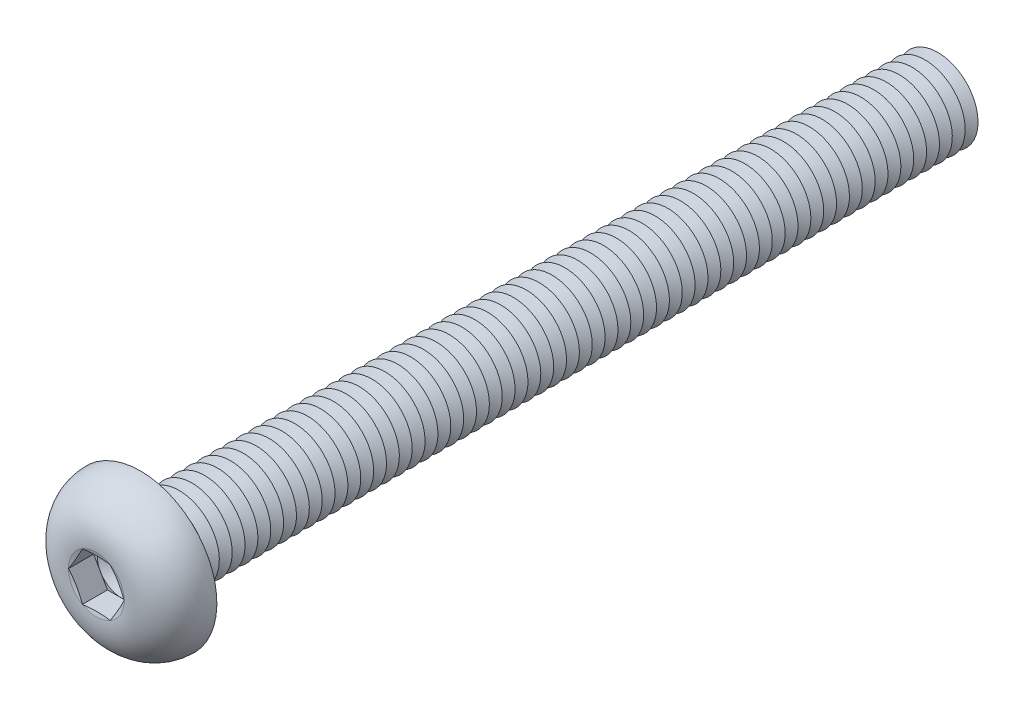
ISO-10303-21;
HEADER;
FILE_DESCRIPTION(('STEP AP214'),'2;1');
FILE_NAME('part.step','',(''),(''),'','','');
FILE_SCHEMA(('AUTOMOTIVE_DESIGN { 1 0 10303 214 1 1 1 1 }'));
ENDSEC;
DATA;
#1=APPLICATION_CONTEXT('core data for automotive mechanical design processes');
#2=APPLICATION_PROTOCOL_DEFINITION('international standard','automotive_design',2000,#1);
#3=PRODUCT_CONTEXT('',#1,'mechanical');
#4=PRODUCT('Part','Part','',(#3));
#5=PRODUCT_RELATED_PRODUCT_CATEGORY('part','',(#4));
#6=PRODUCT_DEFINITION_FORMATION('','',#4);
#7=PRODUCT_DEFINITION_CONTEXT('part definition',#1,'design');
#8=PRODUCT_DEFINITION('design','',#6,#7);
#9=PRODUCT_DEFINITION_SHAPE('','',#8);
#10=(LENGTH_UNIT() NAMED_UNIT(*) SI_UNIT(.MILLI.,.METRE.));
#11=(NAMED_UNIT(*) PLANE_ANGLE_UNIT() SI_UNIT($,.RADIAN.));
#12=(NAMED_UNIT(*) SI_UNIT($,.STERADIAN.) SOLID_ANGLE_UNIT());
#13=UNCERTAINTY_MEASURE_WITH_UNIT(LENGTH_MEASURE(1.E-05),#10,'distance_accuracy_value','');
#14=(GEOMETRIC_REPRESENTATION_CONTEXT(3) GLOBAL_UNCERTAINTY_ASSIGNED_CONTEXT((#13)) GLOBAL_UNIT_ASSIGNED_CONTEXT((#10,
#11,#12)) REPRESENTATION_CONTEXT('',''));
#15=CARTESIAN_POINT('',(0.,0.,0.));
#16=DIRECTION('',(0.,0.,1.));
#17=DIRECTION('',(1.,0.,0.));
#18=AXIS2_PLACEMENT_3D('',#15,#16,#17);
#19=CARTESIAN_POINT('',(0.,0.,1.19));
#20=DIRECTION('',(0.,0.,1.));
#21=DIRECTION('',(1.,0.,0.));
#22=AXIS2_PLACEMENT_3D('',#19,#20,#21);
#23=PLANE('',#22);
#24=CARTESIAN_POINT('',(0.,0.,1.19));
#25=DIRECTION('',(0.,0.,1.));
#26=DIRECTION('',(1.,0.,0.));
#27=AXIS2_PLACEMENT_3D('',#24,#25,#26);
#28=CIRCLE('',#27,1.49999930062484);
#29=CARTESIAN_POINT('',(1.2990375,0.749999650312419,1.19));
#30=VERTEX_POINT('',#29);
#31=CARTESIAN_POINT('',(0.,1.49999930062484,1.19));
#32=VERTEX_POINT('',#31);
#33=EDGE_CURVE('E118',#30,#32,#28,.T.);
#34=ORIENTED_EDGE('',*,*,#33,.F.);
#35=DIRECTION('',(-0.5,0.866025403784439,0.));
#36=VECTOR('',#35,1.);
#37=CARTESIAN_POINT('',(1.73205,0.,1.19));
#38=LINE('',#37,#36);
#39=CARTESIAN_POINT('',(0.866025,1.49999930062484,1.19));
#40=VERTEX_POINT('',#39);
#41=EDGE_CURVE('E125',#30,#40,#38,.T.);
#42=ORIENTED_EDGE('',*,*,#41,.T.);
#43=DIRECTION('',(-1.,0.,0.));
#44=VECTOR('',#43,1.);
#45=CARTESIAN_POINT('',(0.866025,1.49999930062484,1.19));
#46=LINE('',#45,#44);
#47=EDGE_CURVE('E136',#40,#32,#46,.T.);
#48=ORIENTED_EDGE('',*,*,#47,.T.);
#49=EDGE_LOOP('',(#34,#42,#48));
#50=FACE_BOUND('',#49,.T.);
#51=ADVANCED_FACE('F39',(#50),#23,.T.);
#52=CARTESIAN_POINT('',(0.,0.,1.19));
#53=DIRECTION('',(0.,0.,1.));
#54=DIRECTION('',(1.,0.,0.));
#55=AXIS2_PLACEMENT_3D('',#52,#53,#54);
#56=CIRCLE('',#55,1.49999930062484);
#57=CARTESIAN_POINT('',(-1.2990375,0.749999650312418,1.19));
#58=VERTEX_POINT('',#57);
#59=EDGE_CURVE('E11',#32,#58,#56,.T.);
#60=ORIENTED_EDGE('',*,*,#59,.F.);
#61=CARTESIAN_POINT('',(-0.866025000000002,1.49999930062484,1.19));
#62=VERTEX_POINT('',#61);
#63=EDGE_CURVE('E131',#32,#62,#46,.T.);
#64=ORIENTED_EDGE('',*,*,#63,.T.);
#65=DIRECTION('',(-0.5,-0.866025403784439,0.));
#66=VECTOR('',#65,1.);
#67=CARTESIAN_POINT('',(-0.866025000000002,1.49999930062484,1.19));
#68=LINE('',#67,#66);
#69=EDGE_CURVE('E134',#62,#58,#68,.T.);
#70=ORIENTED_EDGE('',*,*,#69,.T.);
#71=EDGE_LOOP('',(#60,#64,#70));
#72=FACE_BOUND('',#71,.T.);
#73=ADVANCED_FACE('F130',(#72),#23,.T.);
#74=CARTESIAN_POINT('',(-1.2990375,-0.749999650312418,1.19));
#75=VERTEX_POINT('',#74);
#76=EDGE_CURVE('E49',#58,#75,#56,.T.);
#77=ORIENTED_EDGE('',*,*,#76,.F.);
#78=CARTESIAN_POINT('',(-1.73205,0.,1.19));
#79=VERTEX_POINT('',#78);
#80=EDGE_CURVE('E143',#58,#79,#68,.T.);
#81=ORIENTED_EDGE('',*,*,#80,.T.);
#82=DIRECTION('',(0.5,-0.866025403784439,0.));
#83=VECTOR('',#82,1.);
#84=CARTESIAN_POINT('',(-1.73205,0.,1.19));
#85=LINE('',#84,#83);
#86=EDGE_CURVE('E152',#79,#75,#85,.T.);
#87=ORIENTED_EDGE('',*,*,#86,.T.);
#88=EDGE_LOOP('',(#77,#81,#87));
#89=FACE_BOUND('',#88,.T.);
#90=ADVANCED_FACE('F767',(#89),#23,.T.);
#91=CARTESIAN_POINT('',(0.,-1.49999930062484,1.19));
#92=VERTEX_POINT('',#91);
#93=EDGE_CURVE('E752',#75,#92,#56,.T.);
#94=ORIENTED_EDGE('',*,*,#93,.F.);
#95=CARTESIAN_POINT('',(-0.866025,-1.49999930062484,1.19));
#96=VERTEX_POINT('',#95);
#97=EDGE_CURVE('E151',#75,#96,#85,.T.);
#98=ORIENTED_EDGE('',*,*,#97,.T.);
#99=DIRECTION('',(1.,0.,0.));
#100=VECTOR('',#99,1.);
#101=CARTESIAN_POINT('',(-0.866025,-1.49999930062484,1.19));
#102=LINE('',#101,#100);
#103=EDGE_CURVE('E157',#96,#92,#102,.T.);
#104=ORIENTED_EDGE('',*,*,#103,.T.);
#105=EDGE_LOOP('',(#94,#98,#104));
#106=FACE_BOUND('',#105,.T.);
#107=ADVANCED_FACE('F760',(#106),#23,.T.);
#108=CARTESIAN_POINT('',(1.2990375,-0.749999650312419,1.19));
#109=VERTEX_POINT('',#108);
#110=EDGE_CURVE('E56',#92,#109,#56,.T.);
#111=ORIENTED_EDGE('',*,*,#110,.F.);
#112=CARTESIAN_POINT('',(0.866025,-1.49999930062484,1.19));
#113=VERTEX_POINT('',#112);
#114=EDGE_CURVE('E156',#92,#113,#102,.T.);
#115=ORIENTED_EDGE('',*,*,#114,.T.);
#116=DIRECTION('',(0.5,0.866025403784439,0.));
#117=VECTOR('',#116,1.);
#118=CARTESIAN_POINT('',(0.866025,-1.49999930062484,1.19));
#119=LINE('',#118,#117);
#120=EDGE_CURVE('E162',#113,#109,#119,.T.);
#121=ORIENTED_EDGE('',*,*,#120,.T.);
#122=EDGE_LOOP('',(#111,#115,#121));
#123=FACE_BOUND('',#122,.T.);
#124=ADVANCED_FACE('F838',(#123),#23,.T.);
#125=CARTESIAN_POINT('',(0.,0.,2.75));
#126=DIRECTION('',(0.,0.,1.));
#127=DIRECTION('',(0.,-1.,0.));
#128=AXIS2_PLACEMENT_3D('',#125,#126,#127);
#129=CONICAL_SURFACE('',#128,1.73205,1.30899693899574);
#130=CARTESIAN_POINT('',(1.73216547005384,-0.000200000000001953,2.75003094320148));
#131=CARTESIAN_POINT('',(1.69619207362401,0.0621077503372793,2.74038633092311));
#132=CARTESIAN_POINT('',(1.66015343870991,0.124528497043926,2.73163050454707));
#133=CARTESIAN_POINT('',(1.58794885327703,0.249590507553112,2.71624720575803));
#134=CARTESIAN_POINT('',(1.5517828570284,0.312231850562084,2.7096205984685));
#135=CARTESIAN_POINT('',(1.47954289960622,0.437355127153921,2.69888271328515));
#136=CARTESIAN_POINT('',(1.4434694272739,0.499836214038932,2.69475862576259));
#137=CARTESIAN_POINT('',(1.37127646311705,0.624878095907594,2.68922863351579));
#138=CARTESIAN_POINT('',(1.33515698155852,0.687438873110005,2.68782220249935));
#139=CARTESIAN_POINT('',(1.26291801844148,0.812560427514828,2.68782220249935));
#140=CARTESIAN_POINT('',(1.22679853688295,0.875121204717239,2.68922863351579));
#141=CARTESIAN_POINT('',(1.1546055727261,1.0001630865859,2.69475862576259));
#142=CARTESIAN_POINT('',(1.11853210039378,1.06264417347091,2.69888271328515));
#143=CARTESIAN_POINT('',(1.0462921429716,1.18776745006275,2.7096205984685));
#144=CARTESIAN_POINT('',(1.01012614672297,1.25040879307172,2.71624720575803));
#145=CARTESIAN_POINT('',(0.937921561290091,1.37547080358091,2.73163050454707));
#146=CARTESIAN_POINT('',(0.901882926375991,1.43789155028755,2.74038633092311));
#147=CARTESIAN_POINT('',(0.865909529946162,1.50019930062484,2.75003094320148));
#148=B_SPLINE_CURVE_WITH_KNOTS('',3,(#130,#131,#132,#133,#134,#135,#136,#137,#138,#139,#140,
#141,#142,#143,#144,#145,#146,#147),.UNSPECIFIED.,.F.,.F.,(4,2,2,2,2,2,2,2,4),(0.,
0.217782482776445,0.435653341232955,0.652399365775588,0.869103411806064,1.08580745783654,
1.30255348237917,1.52042434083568,1.73820682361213),.UNSPECIFIED.);
#149=CARTESIAN_POINT('',(1.73205,0.,2.75));
#150=VERTEX_POINT('',#149);
#151=CARTESIAN_POINT('',(0.866025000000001,1.49999930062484,2.75));
#152=VERTEX_POINT('',#151);
#153=EDGE_CURVE('E221',#150,#152,#148,.T.);
#154=ORIENTED_EDGE('',*,*,#153,.F.);
#155=CARTESIAN_POINT('',(0.,0.,2.75));
#156=DIRECTION('',(0.,0.,-1.));
#157=DIRECTION('',(0.,1.,0.));
#158=AXIS2_PLACEMENT_3D('',#155,#156,#157);
#159=CIRCLE('',#158,1.73205);
#160=EDGE_CURVE('E732',#152,#150,#159,.T.);
#161=ORIENTED_EDGE('',*,*,#160,.F.);
#162=EDGE_LOOP('',(#154,#161));
#163=FACE_BOUND('',#162,.T.);
#164=ADVANCED_FACE('F842',(#163),#129,.F.);
#165=CARTESIAN_POINT('',(0.865909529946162,-1.50019930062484,2.75003094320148));
#166=CARTESIAN_POINT('',(0.901882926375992,-1.43789155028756,2.74038633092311));
#167=CARTESIAN_POINT('',(0.937921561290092,-1.37547080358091,2.73163050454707));
#168=CARTESIAN_POINT('',(1.01012614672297,-1.25040879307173,2.71624720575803));
#169=CARTESIAN_POINT('',(1.0462921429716,-1.18776745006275,2.7096205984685));
#170=CARTESIAN_POINT('',(1.11853210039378,-1.06264417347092,2.69888271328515));
#171=CARTESIAN_POINT('',(1.1546055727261,-1.00016308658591,2.69475862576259));
#172=CARTESIAN_POINT('',(1.22679853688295,-0.875121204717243,2.68922863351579));
#173=CARTESIAN_POINT('',(1.26291801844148,-0.812560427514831,2.68782220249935));
#174=CARTESIAN_POINT('',(1.33515698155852,-0.687438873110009,2.68782220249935));
#175=CARTESIAN_POINT('',(1.37127646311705,-0.624878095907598,2.68922863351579));
#176=CARTESIAN_POINT('',(1.4434694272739,-0.499836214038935,2.69475862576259));
#177=CARTESIAN_POINT('',(1.47954289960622,-0.437355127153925,2.69888271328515));
#178=CARTESIAN_POINT('',(1.5517828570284,-0.312231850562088,2.7096205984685));
#179=CARTESIAN_POINT('',(1.58794885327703,-0.249590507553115,2.71624720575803));
#180=CARTESIAN_POINT('',(1.66015343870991,-0.12452849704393,2.73163050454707));
#181=CARTESIAN_POINT('',(1.69619207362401,-0.0621077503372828,2.74038633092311));
#182=CARTESIAN_POINT('',(1.73216547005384,0.000199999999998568,2.75003094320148));
#183=B_SPLINE_CURVE_WITH_KNOTS('',3,(#165,#166,#167,#168,#169,#170,#171,#172,#173,#174,#175,
#176,#177,#178,#179,#180,#181,#182),.UNSPECIFIED.,.F.,.F.,(4,2,2,2,2,2,2,2,4),(0.,
0.217782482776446,0.435653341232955,0.652399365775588,0.869103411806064,1.08580745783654,
1.30255348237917,1.52042434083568,1.73820682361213),.UNSPECIFIED.);
#184=CARTESIAN_POINT('',(0.866025,-1.49999930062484,2.75));
#185=VERTEX_POINT('',#184);
#186=EDGE_CURVE('E230',#185,#150,#183,.T.);
#187=ORIENTED_EDGE('',*,*,#186,.F.);
#188=EDGE_CURVE('E737',#150,#185,#159,.T.);
#189=ORIENTED_EDGE('',*,*,#188,.F.);
#190=EDGE_LOOP('',(#187,#189));
#191=FACE_BOUND('',#190,.T.);
#192=ADVANCED_FACE('F803',(#191),#129,.F.);
#193=CARTESIAN_POINT('',(-2.61375031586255,-1.49999930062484,3.09338600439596));
#194=CARTESIAN_POINT('',(-2.48719895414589,-1.49999930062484,3.06401688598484));
#195=CARTESIAN_POINT('',(-2.36054180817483,-1.49999930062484,3.03507426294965));
#196=CARTESIAN_POINT('',(-2.10688190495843,-1.49999930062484,2.97862489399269));
#197=CARTESIAN_POINT('',(-1.97987908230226,-1.49999930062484,2.95111844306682));
#198=CARTESIAN_POINT('',(-1.72425281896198,-1.49999930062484,2.89788845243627));
#199=CARTESIAN_POINT('',(-1.59562534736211,-1.49999930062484,2.87218404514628));
#200=CARTESIAN_POINT('',(-1.33776732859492,-1.49999930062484,2.82387586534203));
#201=CARTESIAN_POINT('',(-1.20853672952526,-1.49999930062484,2.80127236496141));
#202=CARTESIAN_POINT('',(-0.952831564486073,-1.49999930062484,2.76126658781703));
#203=CARTESIAN_POINT('',(-0.826376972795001,-1.49999930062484,2.74374018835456));
#204=CARTESIAN_POINT('',(-0.572755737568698,-1.49999930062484,2.71502809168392));
#205=CARTESIAN_POINT('',(-0.44558933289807,-1.49999930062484,2.70384038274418));
#206=CARTESIAN_POINT('',(-0.191333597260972,-1.49999930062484,2.68972083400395));
#207=CARTESIAN_POINT('',(-0.0642464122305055,-1.49999930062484,2.68675270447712));
#208=CARTESIAN_POINT('',(0.189835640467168,-1.49999930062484,2.68959577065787));
#209=CARTESIAN_POINT('',(0.316830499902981,-1.49999930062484,2.69540767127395));
#210=CARTESIAN_POINT('',(0.534182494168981,-1.49999930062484,2.71190493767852));
#211=CARTESIAN_POINT('',(0.624691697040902,-1.49999930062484,2.72073513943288));
#212=CARTESIAN_POINT('',(0.805336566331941,-1.49999930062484,2.74156379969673));
#213=CARTESIAN_POINT('',(0.895472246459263,-1.49999930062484,2.75356214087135));
#214=CARTESIAN_POINT('',(1.0756572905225,-1.49999930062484,2.78006977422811));
#215=CARTESIAN_POINT('',(1.16570548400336,-1.49999930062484,2.7945868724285));
#216=CARTESIAN_POINT('',(1.3454787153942,-1.49999930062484,2.82550612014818));
#217=CARTESIAN_POINT('',(1.43520373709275,-1.49999930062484,2.8419083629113));
#218=CARTESIAN_POINT('',(1.61622412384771,-1.49999930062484,2.87648604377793));
#219=CARTESIAN_POINT('',(1.70751379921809,-1.49999930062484,2.89469103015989));
#220=CARTESIAN_POINT('',(1.88986344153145,-1.49999930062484,2.93221618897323));
#221=CARTESIAN_POINT('',(1.98092340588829,-1.49999930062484,2.95153637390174));
#222=CARTESIAN_POINT('',(2.16236354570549,-1.49999930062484,2.99091506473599));
#223=CARTESIAN_POINT('',(2.25274472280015,-1.49999930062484,3.01096897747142));
#224=CARTESIAN_POINT('',(2.43335289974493,-1.49999930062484,3.05173139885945));
#225=CARTESIAN_POINT('',(2.52357990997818,-1.49999930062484,3.07243986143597));
#226=CARTESIAN_POINT('',(2.61375031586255,-1.49999930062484,3.09338600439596));
#227=B_SPLINE_CURVE_WITH_KNOTS('',3,(#193,#194,#195,#196,#197,#198,#199,#200,#201,#202,#203,
#204,#205,#206,#207,#208,#209,#210,#211,#212,#213,#214,#215,#216,#217,#218,#219,#220,#221,#222,
#223,#224,#225,#226),.UNSPECIFIED.,.F.,.F.,(4,2,2,2,2,2,2,2,2,2,2,2,2,2,2,2,4),(0.,
0.389753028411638,0.779585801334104,1.17307326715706,1.5665952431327,1.94947555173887,
2.33223427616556,2.71330039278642,3.09439710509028,3.36715350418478,3.63989980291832,
3.91350699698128,4.18712773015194,4.4663802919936,4.74563598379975,5.02337106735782,
5.3010866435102),.UNSPECIFIED.);
#228=CARTESIAN_POINT('',(-0.866025,-1.49999930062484,2.75));
#229=VERTEX_POINT('',#228);
#230=EDGE_CURVE('E781',#229,#185,#227,.T.);
#231=ORIENTED_EDGE('',*,*,#230,.F.);
#232=EDGE_CURVE('E794',#185,#229,#159,.T.);
#233=ORIENTED_EDGE('',*,*,#232,.F.);
#234=EDGE_LOOP('',(#231,#233));
#235=FACE_BOUND('',#234,.T.);
#236=ADVANCED_FACE('F809',(#235),#129,.F.);
#237=CARTESIAN_POINT('',(-1.73216547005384,0.000199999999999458,2.75003094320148));
#238=CARTESIAN_POINT('',(-1.69619207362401,-0.0621077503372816,2.74038633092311));
#239=CARTESIAN_POINT('',(-1.66015343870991,-0.124528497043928,2.73163050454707));
#240=CARTESIAN_POINT('',(-1.58794885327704,-0.249590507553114,2.71624720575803));
#241=CARTESIAN_POINT('',(-1.55178285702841,-0.312231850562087,2.7096205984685));
#242=CARTESIAN_POINT('',(-1.47954289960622,-0.437355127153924,2.69888271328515));
#243=CARTESIAN_POINT('',(-1.4434694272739,-0.499836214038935,2.69475862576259));
#244=CARTESIAN_POINT('',(-1.37127646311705,-0.624878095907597,2.68922863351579));
#245=CARTESIAN_POINT('',(-1.33515698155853,-0.687438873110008,2.68782220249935));
#246=CARTESIAN_POINT('',(-1.26291801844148,-0.812560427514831,2.68782220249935));
#247=CARTESIAN_POINT('',(-1.22679853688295,-0.875121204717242,2.68922863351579));
#248=CARTESIAN_POINT('',(-1.1546055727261,-1.0001630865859,2.69475862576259));
#249=CARTESIAN_POINT('',(-1.11853210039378,-1.06264417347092,2.69888271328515));
#250=CARTESIAN_POINT('',(-1.0462921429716,-1.18776745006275,2.7096205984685));
#251=CARTESIAN_POINT('',(-1.01012614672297,-1.25040879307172,2.71624720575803));
#252=CARTESIAN_POINT('',(-0.937921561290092,-1.37547080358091,2.73163050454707));
#253=CARTESIAN_POINT('',(-0.901882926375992,-1.43789155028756,2.74038633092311));
#254=CARTESIAN_POINT('',(-0.865909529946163,-1.50019930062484,2.75003094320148));
#255=B_SPLINE_CURVE_WITH_KNOTS('',3,(#237,#238,#239,#240,#241,#242,#243,#244,#245,#246,#247,
#248,#249,#250,#251,#252,#253,#254),.UNSPECIFIED.,.F.,.F.,(4,2,2,2,2,2,2,2,4),(0.,
0.217782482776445,0.435653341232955,0.652399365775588,0.869103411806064,1.08580745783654,
1.30255348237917,1.52042434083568,1.73820682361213),.UNSPECIFIED.);
#256=CARTESIAN_POINT('',(-1.73205,0.,2.75));
#257=VERTEX_POINT('',#256);
#258=EDGE_CURVE('E772',#257,#229,#255,.T.);
#259=ORIENTED_EDGE('',*,*,#258,.F.);
#260=EDGE_CURVE('E778',#229,#257,#159,.T.);
#261=ORIENTED_EDGE('',*,*,#260,.F.);
#262=EDGE_LOOP('',(#259,#261));
#263=FACE_BOUND('',#262,.T.);
#264=ADVANCED_FACE('F776',(#263),#129,.F.);
#265=CARTESIAN_POINT('',(-0.865909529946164,1.50019930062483,2.75003094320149));
#266=CARTESIAN_POINT('',(-0.901882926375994,1.43789155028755,2.74038633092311));
#267=CARTESIAN_POINT('',(-0.937921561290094,1.37547080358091,2.73163050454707));
#268=CARTESIAN_POINT('',(-1.01012614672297,1.25040879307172,2.71624720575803));
#269=CARTESIAN_POINT('',(-1.0462921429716,1.18776745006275,2.7096205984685));
#270=CARTESIAN_POINT('',(-1.11853210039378,1.06264417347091,2.69888271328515));
#271=CARTESIAN_POINT('',(-1.1546055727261,1.0001630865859,2.69475862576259));
#272=CARTESIAN_POINT('',(-1.22679853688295,0.87512120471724,2.68922863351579));
#273=CARTESIAN_POINT('',(-1.26291801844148,0.812560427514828,2.68782220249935));
#274=CARTESIAN_POINT('',(-1.33515698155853,0.687438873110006,2.68782220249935));
#275=CARTESIAN_POINT('',(-1.37127646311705,0.624878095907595,2.68922863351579));
#276=CARTESIAN_POINT('',(-1.4434694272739,0.499836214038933,2.69475862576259));
#277=CARTESIAN_POINT('',(-1.47954289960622,0.437355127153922,2.69888271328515));
#278=CARTESIAN_POINT('',(-1.55178285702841,0.312231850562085,2.7096205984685));
#279=CARTESIAN_POINT('',(-1.58794885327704,0.249590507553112,2.71624720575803));
#280=CARTESIAN_POINT('',(-1.66015343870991,0.124528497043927,2.73163050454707));
#281=CARTESIAN_POINT('',(-1.69619207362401,0.0621077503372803,2.74038633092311));
#282=CARTESIAN_POINT('',(-1.73216547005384,-0.000200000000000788,2.75003094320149));
#283=B_SPLINE_CURVE_WITH_KNOTS('',3,(#265,#266,#267,#268,#269,#270,#271,#272,#273,#274,#275,
#276,#277,#278,#279,#280,#281,#282),.UNSPECIFIED.,.F.,.F.,(4,2,2,2,2,2,2,2,4),(0.,
0.217782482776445,0.435653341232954,0.652399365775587,0.869103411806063,1.08580745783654,
1.30255348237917,1.52042434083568,1.73820682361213),.UNSPECIFIED.);
#284=CARTESIAN_POINT('',(-0.866025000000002,1.49999930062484,2.75));
#285=VERTEX_POINT('',#284);
#286=EDGE_CURVE('E194',#285,#257,#283,.T.);
#287=ORIENTED_EDGE('',*,*,#286,.F.);
#288=EDGE_CURVE('E784',#257,#285,#159,.T.);
#289=ORIENTED_EDGE('',*,*,#288,.F.);
#290=EDGE_LOOP('',(#287,#289));
#291=FACE_BOUND('',#290,.T.);
#292=ADVANCED_FACE('F785',(#291),#129,.F.);
#293=CARTESIAN_POINT('',(0.,0.,-47.2));
#294=DIRECTION('',(0.,0.,1.));
#295=DIRECTION('',(0.,-1.,0.));
#296=AXIS2_PLACEMENT_3D('',#293,#294,#295);
#297=CONICAL_SURFACE('',#296,2.49999999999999,1.0471975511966);
#298=CARTESIAN_POINT('',(0.,0.,-47.6));
#299=DIRECTION('',(0.,0.,1.));
#300=DIRECTION('',(0.,-1.,0.));
#301=AXIS2_PLACEMENT_3D('',#298,#299,#300);
#302=CIRCLE('',#301,1.80717967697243);
#303=CARTESIAN_POINT('',(0.,-1.80717967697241,-47.6));
#304=VERTEX_POINT('',#303);
#305=EDGE_CURVE('E703',#304,#304,#302,.T.);
#306=ORIENTED_EDGE('',*,*,#305,.T.);
#307=EDGE_LOOP('',(#306));
#308=FACE_BOUND('',#307,.T.);
#309=CARTESIAN_POINT('',(0.,0.,-47.2));
#310=DIRECTION('',(0.,0.,1.));
#311=DIRECTION('',(0.,-1.,0.));
#312=AXIS2_PLACEMENT_3D('',#309,#310,#311);
#313=CIRCLE('',#312,2.49999999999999);
#314=CARTESIAN_POINT('',(0.,-2.49999999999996,-47.2));
#315=VERTEX_POINT('',#314);
#316=EDGE_CURVE('E699',#315,#315,#313,.T.);
#317=ORIENTED_EDGE('',*,*,#316,.F.);
#318=EDGE_LOOP('',(#317));
#319=FACE_BOUND('',#318,.T.);
#320=ADVANCED_FACE('F868',(#308,#319),#297,.T.);
#321=CARTESIAN_POINT('',(0.,0.,-47.6));
#322=DIRECTION('',(0.,0.,-1.));
#323=DIRECTION('',(0.,1.,0.));
#324=AXIS2_PLACEMENT_3D('',#321,#322,#323);
#325=CONICAL_SURFACE('',#324,1.80717967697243,1.04719755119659);
#326=CARTESIAN_POINT('',(0.,0.,-48.));
#327=DIRECTION('',(0.,0.,1.));
#328=DIRECTION('',(0.,-1.,0.));
#329=AXIS2_PLACEMENT_3D('',#326,#327,#328);
#330=CIRCLE('',#329,2.49999999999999);
#331=CARTESIAN_POINT('',(0.,-2.49999999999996,-48.));
#332=VERTEX_POINT('',#331);
#333=EDGE_CURVE('E707',#332,#332,#330,.T.);
#334=ORIENTED_EDGE('',*,*,#333,.T.);
#335=EDGE_LOOP('',(#334));
#336=FACE_BOUND('',#335,.T.);
#337=ORIENTED_EDGE('',*,*,#305,.F.);
#338=EDGE_LOOP('',(#337));
#339=FACE_BOUND('',#338,.T.);
#340=ADVANCED_FACE('F873',(#336,#339),#325,.T.);
#341=CARTESIAN_POINT('',(0.,2.49999999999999,-50.));
#342=DIRECTION('',(0.,0.,-1.));
#343=DIRECTION('',(0.,1.,0.));
#344=AXIS2_PLACEMENT_3D('',#341,#342,#343);
#345=PLANE('',#344);
#346=CARTESIAN_POINT('',(0.,0.,-50.));
#347=DIRECTION('',(0.,0.,1.));
#348=DIRECTION('',(0.,-1.,0.));
#349=AXIS2_PLACEMENT_3D('',#346,#347,#348);
#350=CIRCLE('',#349,1.80717967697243);
#351=CARTESIAN_POINT('',(0.,-1.80717967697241,-50.));
#352=VERTEX_POINT('',#351);
#353=EDGE_CURVE('E727',#352,#352,#350,.T.);
#354=ORIENTED_EDGE('',*,*,#353,.F.);
#355=EDGE_LOOP('',(#354));
#356=FACE_BOUND('',#355,.T.);
#357=ADVANCED_FACE('F1048',(#356),#345,.T.);
#358=CARTESIAN_POINT('',(0.,0.,-49.6));
#359=DIRECTION('',(0.,0.,1.));
#360=DIRECTION('',(0.,-1.,0.));
#361=AXIS2_PLACEMENT_3D('',#358,#359,#360);
#362=CONICAL_SURFACE('',#361,2.49999999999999,1.0471975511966);
#363=ORIENTED_EDGE('',*,*,#353,.T.);
#364=EDGE_LOOP('',(#363));
#365=FACE_BOUND('',#364,.T.);
#366=CARTESIAN_POINT('',(0.,0.,-49.6));
#367=DIRECTION('',(0.,0.,1.));
#368=DIRECTION('',(0.,-1.,0.));
#369=AXIS2_PLACEMENT_3D('',#366,#367,#368);
#370=CIRCLE('',#369,2.49999999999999);
#371=CARTESIAN_POINT('',(0.,-2.49999999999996,-49.6));
#372=VERTEX_POINT('',#371);
#373=EDGE_CURVE('E723',#372,#372,#370,.T.);
#374=ORIENTED_EDGE('',*,*,#373,.F.);
#375=EDGE_LOOP('',(#374));
#376=FACE_BOUND('',#375,.T.);
#377=ADVANCED_FACE('F1041',(#365,#376),#362,.T.);
#378=CARTESIAN_POINT('',(0.,0.,-49.2));
#379=DIRECTION('',(0.,0.,-1.));
#380=DIRECTION('',(0.,1.,0.));
#381=AXIS2_PLACEMENT_3D('',#378,#379,#380);
#382=CONICAL_SURFACE('',#381,1.80717967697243,1.04719755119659);
#383=ORIENTED_EDGE('',*,*,#373,.T.);
#384=EDGE_LOOP('',(#383));
#385=FACE_BOUND('',#384,.T.);
#386=CARTESIAN_POINT('',(0.,0.,-49.2));
#387=DIRECTION('',(0.,0.,1.));
#388=DIRECTION('',(0.,-1.,0.));
#389=AXIS2_PLACEMENT_3D('',#386,#387,#388);
#390=CIRCLE('',#389,1.80717967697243);
#391=CARTESIAN_POINT('',(0.,-1.80717967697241,-49.2));
#392=VERTEX_POINT('',#391);
#393=EDGE_CURVE('E719',#392,#392,#390,.T.);
#394=ORIENTED_EDGE('',*,*,#393,.F.);
#395=EDGE_LOOP('',(#394));
#396=FACE_BOUND('',#395,.T.);
#397=ADVANCED_FACE('F1047',(#385,#396),#382,.T.);
#398=CARTESIAN_POINT('',(0.,0.,-48.8));
#399=DIRECTION('',(0.,0.,1.));
#400=DIRECTION('',(0.,-1.,0.));
#401=AXIS2_PLACEMENT_3D('',#398,#399,#400);
#402=CONICAL_SURFACE('',#401,2.49999999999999,1.0471975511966);
#403=ORIENTED_EDGE('',*,*,#393,.T.);
#404=EDGE_LOOP('',(#403));
#405=FACE_BOUND('',#404,.T.);
#406=CARTESIAN_POINT('',(0.,0.,-48.8));
#407=DIRECTION('',(0.,0.,1.));
#408=DIRECTION('',(0.,-1.,0.));
#409=AXIS2_PLACEMENT_3D('',#406,#407,#408);
#410=CIRCLE('',#409,2.49999999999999);
#411=CARTESIAN_POINT('',(0.,-2.49999999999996,-48.8));
#412=VERTEX_POINT('',#411);
#413=EDGE_CURVE('E715',#412,#412,#410,.T.);
#414=ORIENTED_EDGE('',*,*,#413,.F.);
#415=EDGE_LOOP('',(#414));
#416=FACE_BOUND('',#415,.T.);
#417=ADVANCED_FACE('F1079',(#405,#416),#402,.T.);
#418=CARTESIAN_POINT('',(0.,0.,-48.4));
#419=DIRECTION('',(0.,0.,-1.));
#420=DIRECTION('',(0.,1.,0.));
#421=AXIS2_PLACEMENT_3D('',#418,#419,#420);
#422=CONICAL_SURFACE('',#421,1.80717967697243,1.04719755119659);
#423=ORIENTED_EDGE('',*,*,#413,.T.);
#424=EDGE_LOOP('',(#423));
#425=FACE_BOUND('',#424,.T.);
#426=CARTESIAN_POINT('',(0.,0.,-48.4));
#427=DIRECTION('',(0.,0.,1.));
#428=DIRECTION('',(0.,-1.,0.));
#429=AXIS2_PLACEMENT_3D('',#426,#427,#428);
#430=CIRCLE('',#429,1.80717967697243);
#431=CARTESIAN_POINT('',(0.,-1.80717967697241,-48.4));
#432=VERTEX_POINT('',#431);
#433=EDGE_CURVE('E711',#432,#432,#430,.T.);
#434=ORIENTED_EDGE('',*,*,#433,.F.);
#435=EDGE_LOOP('',(#434));
#436=FACE_BOUND('',#435,.T.);
#437=ADVANCED_FACE('F1089',(#425,#436),#422,.T.);
#438=CARTESIAN_POINT('',(0.,0.,-48.));
#439=DIRECTION('',(0.,0.,1.));
#440=DIRECTION('',(0.,-1.,0.));
#441=AXIS2_PLACEMENT_3D('',#438,#439,#440);
#442=CONICAL_SURFACE('',#441,2.49999999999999,1.0471975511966);
#443=ORIENTED_EDGE('',*,*,#433,.T.);
#444=EDGE_LOOP('',(#443));
#445=FACE_BOUND('',#444,.T.);
#446=ORIENTED_EDGE('',*,*,#333,.F.);
#447=EDGE_LOOP('',(#446));
#448=FACE_BOUND('',#447,.T.);
#449=ADVANCED_FACE('F1099',(#445,#448),#442,.T.);
#450=CARTESIAN_POINT('',(0.,0.,-46.4));
#451=DIRECTION('',(0.,0.,1.));
#452=DIRECTION('',(0.,-1.,0.));
#453=AXIS2_PLACEMENT_3D('',#450,#451,#452);
#454=CONICAL_SURFACE('',#453,2.49999999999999,1.0471975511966);
#455=CARTESIAN_POINT('',(0.,0.,-46.8));
#456=DIRECTION('',(0.,0.,1.));
#457=DIRECTION('',(0.,-1.,0.));
#458=AXIS2_PLACEMENT_3D('',#455,#456,#457);
#459=CIRCLE('',#458,1.80717967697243);
#460=CARTESIAN_POINT('',(0.,-1.80717967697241,-46.8));
#461=VERTEX_POINT('',#460);
#462=EDGE_CURVE('E695',#461,#461,#459,.T.);
#463=ORIENTED_EDGE('',*,*,#462,.T.);
#464=EDGE_LOOP('',(#463));
#465=FACE_BOUND('',#464,.T.);
#466=CARTESIAN_POINT('',(0.,0.,-46.4));
#467=DIRECTION('',(0.,0.,1.));
#468=DIRECTION('',(0.,-1.,0.));
#469=AXIS2_PLACEMENT_3D('',#466,#467,#468);
#470=CIRCLE('',#469,2.49999999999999);
#471=CARTESIAN_POINT('',(0.,-2.49999999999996,-46.4));
#472=VERTEX_POINT('',#471);
#473=EDGE_CURVE('E691',#472,#472,#470,.T.);
#474=ORIENTED_EDGE('',*,*,#473,.F.);
#475=EDGE_LOOP('',(#474));
#476=FACE_BOUND('',#475,.T.);
#477=ADVANCED_FACE('F1109',(#465,#476),#454,.T.);
#478=CARTESIAN_POINT('',(0.,0.,-46.8));
#479=DIRECTION('',(0.,0.,-1.));
#480=DIRECTION('',(0.,1.,0.));
#481=AXIS2_PLACEMENT_3D('',#478,#479,#480);
#482=CONICAL_SURFACE('',#481,1.80717967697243,1.04719755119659);
#483=ORIENTED_EDGE('',*,*,#316,.T.);
#484=EDGE_LOOP('',(#483));
#485=FACE_BOUND('',#484,.T.);
#486=ORIENTED_EDGE('',*,*,#462,.F.);
#487=EDGE_LOOP('',(#486));
#488=FACE_BOUND('',#487,.T.);
#489=ADVANCED_FACE('F1119',(#485,#488),#482,.T.);
#490=CARTESIAN_POINT('',(0.,0.,-45.6));
#491=DIRECTION('',(0.,0.,1.));
#492=DIRECTION('',(0.,-1.,0.));
#493=AXIS2_PLACEMENT_3D('',#490,#491,#492);
#494=CONICAL_SURFACE('',#493,2.49999999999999,1.0471975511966);
#495=CARTESIAN_POINT('',(0.,0.,-46.));
#496=DIRECTION('',(0.,0.,1.));
#497=DIRECTION('',(0.,-1.,0.));
#498=AXIS2_PLACEMENT_3D('',#495,#496,#497);
#499=CIRCLE('',#498,1.80717967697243);
#500=CARTESIAN_POINT('',(0.,-1.80717967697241,-46.));
#501=VERTEX_POINT('',#500);
#502=EDGE_CURVE('E687',#501,#501,#499,.T.);
#503=ORIENTED_EDGE('',*,*,#502,.T.);
#504=EDGE_LOOP('',(#503));
#505=FACE_BOUND('',#504,.T.);
#506=CARTESIAN_POINT('',(0.,0.,-45.6));
#507=DIRECTION('',(0.,0.,1.));
#508=DIRECTION('',(0.,-1.,0.));
#509=AXIS2_PLACEMENT_3D('',#506,#507,#508);
#510=CIRCLE('',#509,2.49999999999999);
#511=CARTESIAN_POINT('',(0.,-2.49999999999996,-45.6));
#512=VERTEX_POINT('',#511);
#513=EDGE_CURVE('E683',#512,#512,#510,.T.);
#514=ORIENTED_EDGE('',*,*,#513,.F.);
#515=EDGE_LOOP('',(#514));
#516=FACE_BOUND('',#515,.T.);
#517=ADVANCED_FACE('F1129',(#505,#516),#494,.T.);
#518=CARTESIAN_POINT('',(0.,0.,-46.));
#519=DIRECTION('',(0.,0.,-1.));
#520=DIRECTION('',(0.,1.,0.));
#521=AXIS2_PLACEMENT_3D('',#518,#519,#520);
#522=CONICAL_SURFACE('',#521,1.80717967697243,1.04719755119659);
#523=ORIENTED_EDGE('',*,*,#473,.T.);
#524=EDGE_LOOP('',(#523));
#525=FACE_BOUND('',#524,.T.);
#526=ORIENTED_EDGE('',*,*,#502,.F.);
#527=EDGE_LOOP('',(#526));
#528=FACE_BOUND('',#527,.T.);
#529=ADVANCED_FACE('F1139',(#525,#528),#522,.T.);
#530=CARTESIAN_POINT('',(0.,0.,-44.8));
#531=DIRECTION('',(0.,0.,1.));
#532=DIRECTION('',(0.,-1.,0.));
#533=AXIS2_PLACEMENT_3D('',#530,#531,#532);
#534=CONICAL_SURFACE('',#533,2.49999999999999,1.0471975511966);
#535=CARTESIAN_POINT('',(0.,0.,-45.2));
#536=DIRECTION('',(0.,0.,1.));
#537=DIRECTION('',(0.,-1.,0.));
#538=AXIS2_PLACEMENT_3D('',#535,#536,#537);
#539=CIRCLE('',#538,1.80717967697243);
#540=CARTESIAN_POINT('',(0.,-1.80717967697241,-45.2));
#541=VERTEX_POINT('',#540);
#542=EDGE_CURVE('E679',#541,#541,#539,.T.);
#543=ORIENTED_EDGE('',*,*,#542,.T.);
#544=EDGE_LOOP('',(#543));
#545=FACE_BOUND('',#544,.T.);
#546=CARTESIAN_POINT('',(0.,0.,-44.8));
#547=DIRECTION('',(0.,0.,1.));
#548=DIRECTION('',(0.,-1.,0.));
#549=AXIS2_PLACEMENT_3D('',#546,#547,#548);
#550=CIRCLE('',#549,2.49999999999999);
#551=CARTESIAN_POINT('',(0.,-2.49999999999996,-44.8));
#552=VERTEX_POINT('',#551);
#553=EDGE_CURVE('E675',#552,#552,#550,.T.);
#554=ORIENTED_EDGE('',*,*,#553,.F.);
#555=EDGE_LOOP('',(#554));
#556=FACE_BOUND('',#555,.T.);
#557=ADVANCED_FACE('F1149',(#545,#556),#534,.T.);
#558=CARTESIAN_POINT('',(0.,0.,-45.2));
#559=DIRECTION('',(0.,0.,-1.));
#560=DIRECTION('',(0.,1.,0.));
#561=AXIS2_PLACEMENT_3D('',#558,#559,#560);
#562=CONICAL_SURFACE('',#561,1.80717967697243,1.04719755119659);
#563=ORIENTED_EDGE('',*,*,#513,.T.);
#564=EDGE_LOOP('',(#563));
#565=FACE_BOUND('',#564,.T.);
#566=ORIENTED_EDGE('',*,*,#542,.F.);
#567=EDGE_LOOP('',(#566));
#568=FACE_BOUND('',#567,.T.);
#569=ADVANCED_FACE('F1159',(#565,#568),#562,.T.);
#570=CARTESIAN_POINT('',(0.,0.,-44.));
#571=DIRECTION('',(0.,0.,1.));
#572=DIRECTION('',(0.,-1.,0.));
#573=AXIS2_PLACEMENT_3D('',#570,#571,#572);
#574=CONICAL_SURFACE('',#573,2.49999999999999,1.0471975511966);
#575=CARTESIAN_POINT('',(0.,0.,-44.4));
#576=DIRECTION('',(0.,0.,1.));
#577=DIRECTION('',(0.,-1.,0.));
#578=AXIS2_PLACEMENT_3D('',#575,#576,#577);
#579=CIRCLE('',#578,1.80717967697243);
#580=CARTESIAN_POINT('',(0.,-1.80717967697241,-44.4));
#581=VERTEX_POINT('',#580);
#582=EDGE_CURVE('E671',#581,#581,#579,.T.);
#583=ORIENTED_EDGE('',*,*,#582,.T.);
#584=EDGE_LOOP('',(#583));
#585=FACE_BOUND('',#584,.T.);
#586=CARTESIAN_POINT('',(0.,0.,-44.));
#587=DIRECTION('',(0.,0.,1.));
#588=DIRECTION('',(0.,-1.,0.));
#589=AXIS2_PLACEMENT_3D('',#586,#587,#588);
#590=CIRCLE('',#589,2.49999999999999);
#591=CARTESIAN_POINT('',(0.,-2.49999999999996,-44.));
#592=VERTEX_POINT('',#591);
#593=EDGE_CURVE('E667',#592,#592,#590,.T.);
#594=ORIENTED_EDGE('',*,*,#593,.F.);
#595=EDGE_LOOP('',(#594));
#596=FACE_BOUND('',#595,.T.);
#597=ADVANCED_FACE('F1169',(#585,#596),#574,.T.);
#598=CARTESIAN_POINT('',(0.,0.,-44.4));
#599=DIRECTION('',(0.,0.,-1.));
#600=DIRECTION('',(0.,1.,0.));
#601=AXIS2_PLACEMENT_3D('',#598,#599,#600);
#602=CONICAL_SURFACE('',#601,1.80717967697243,1.04719755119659);
#603=ORIENTED_EDGE('',*,*,#553,.T.);
#604=EDGE_LOOP('',(#603));
#605=FACE_BOUND('',#604,.T.);
#606=ORIENTED_EDGE('',*,*,#582,.F.);
#607=EDGE_LOOP('',(#606));
#608=FACE_BOUND('',#607,.T.);
#609=ADVANCED_FACE('F1179',(#605,#608),#602,.T.);
#610=CARTESIAN_POINT('',(0.,0.,-43.2));
#611=DIRECTION('',(0.,0.,1.));
#612=DIRECTION('',(0.,-1.,0.));
#613=AXIS2_PLACEMENT_3D('',#610,#611,#612);
#614=CONICAL_SURFACE('',#613,2.49999999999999,1.0471975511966);
#615=CARTESIAN_POINT('',(0.,0.,-43.6));
#616=DIRECTION('',(0.,0.,1.));
#617=DIRECTION('',(0.,-1.,0.));
#618=AXIS2_PLACEMENT_3D('',#615,#616,#617);
#619=CIRCLE('',#618,1.80717967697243);
#620=CARTESIAN_POINT('',(0.,-1.80717967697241,-43.6));
#621=VERTEX_POINT('',#620);
#622=EDGE_CURVE('E663',#621,#621,#619,.T.);
#623=ORIENTED_EDGE('',*,*,#622,.T.);
#624=EDGE_LOOP('',(#623));
#625=FACE_BOUND('',#624,.T.);
#626=CARTESIAN_POINT('',(0.,0.,-43.2));
#627=DIRECTION('',(0.,0.,1.));
#628=DIRECTION('',(0.,-1.,0.));
#629=AXIS2_PLACEMENT_3D('',#626,#627,#628);
#630=CIRCLE('',#629,2.49999999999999);
#631=CARTESIAN_POINT('',(0.,-2.49999999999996,-43.2));
#632=VERTEX_POINT('',#631);
#633=EDGE_CURVE('E659',#632,#632,#630,.T.);
#634=ORIENTED_EDGE('',*,*,#633,.F.);
#635=EDGE_LOOP('',(#634));
#636=FACE_BOUND('',#635,.T.);
#637=ADVANCED_FACE('F1189',(#625,#636),#614,.T.);
#638=CARTESIAN_POINT('',(0.,0.,-43.6));
#639=DIRECTION('',(0.,0.,-1.));
#640=DIRECTION('',(0.,1.,0.));
#641=AXIS2_PLACEMENT_3D('',#638,#639,#640);
#642=CONICAL_SURFACE('',#641,1.80717967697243,1.04719755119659);
#643=ORIENTED_EDGE('',*,*,#593,.T.);
#644=EDGE_LOOP('',(#643));
#645=FACE_BOUND('',#644,.T.);
#646=ORIENTED_EDGE('',*,*,#622,.F.);
#647=EDGE_LOOP('',(#646));
#648=FACE_BOUND('',#647,.T.);
#649=ADVANCED_FACE('F1199',(#645,#648),#642,.T.);
#650=CARTESIAN_POINT('',(0.,0.,-42.4));
#651=DIRECTION('',(0.,0.,1.));
#652=DIRECTION('',(0.,-1.,0.));
#653=AXIS2_PLACEMENT_3D('',#650,#651,#652);
#654=CONICAL_SURFACE('',#653,2.49999999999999,1.0471975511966);
#655=CARTESIAN_POINT('',(0.,0.,-42.8));
#656=DIRECTION('',(0.,0.,1.));
#657=DIRECTION('',(0.,-1.,0.));
#658=AXIS2_PLACEMENT_3D('',#655,#656,#657);
#659=CIRCLE('',#658,1.80717967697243);
#660=CARTESIAN_POINT('',(0.,-1.80717967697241,-42.8));
#661=VERTEX_POINT('',#660);
#662=EDGE_CURVE('E655',#661,#661,#659,.T.);
#663=ORIENTED_EDGE('',*,*,#662,.T.);
#664=EDGE_LOOP('',(#663));
#665=FACE_BOUND('',#664,.T.);
#666=CARTESIAN_POINT('',(0.,0.,-42.4));
#667=DIRECTION('',(0.,0.,1.));
#668=DIRECTION('',(0.,-1.,0.));
#669=AXIS2_PLACEMENT_3D('',#666,#667,#668);
#670=CIRCLE('',#669,2.49999999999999);
#671=CARTESIAN_POINT('',(0.,-2.49999999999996,-42.4));
#672=VERTEX_POINT('',#671);
#673=EDGE_CURVE('E651',#672,#672,#670,.T.);
#674=ORIENTED_EDGE('',*,*,#673,.F.);
#675=EDGE_LOOP('',(#674));
#676=FACE_BOUND('',#675,.T.);
#677=ADVANCED_FACE('F1209',(#665,#676),#654,.T.);
#678=CARTESIAN_POINT('',(0.,0.,-42.8));
#679=DIRECTION('',(0.,0.,-1.));
#680=DIRECTION('',(0.,1.,0.));
#681=AXIS2_PLACEMENT_3D('',#678,#679,#680);
#682=CONICAL_SURFACE('',#681,1.80717967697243,1.04719755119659);
#683=ORIENTED_EDGE('',*,*,#633,.T.);
#684=EDGE_LOOP('',(#683));
#685=FACE_BOUND('',#684,.T.);
#686=ORIENTED_EDGE('',*,*,#662,.F.);
#687=EDGE_LOOP('',(#686));
#688=FACE_BOUND('',#687,.T.);
#689=ADVANCED_FACE('F1219',(#685,#688),#682,.T.);
#690=CARTESIAN_POINT('',(0.,0.,-41.6));
#691=DIRECTION('',(0.,0.,1.));
#692=DIRECTION('',(0.,-1.,0.));
#693=AXIS2_PLACEMENT_3D('',#690,#691,#692);
#694=CONICAL_SURFACE('',#693,2.49999999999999,1.0471975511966);
#695=CARTESIAN_POINT('',(0.,0.,-42.));
#696=DIRECTION('',(0.,0.,1.));
#697=DIRECTION('',(0.,-1.,0.));
#698=AXIS2_PLACEMENT_3D('',#695,#696,#697);
#699=CIRCLE('',#698,1.80717967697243);
#700=CARTESIAN_POINT('',(0.,-1.80717967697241,-42.));
#701=VERTEX_POINT('',#700);
#702=EDGE_CURVE('E647',#701,#701,#699,.T.);
#703=ORIENTED_EDGE('',*,*,#702,.T.);
#704=EDGE_LOOP('',(#703));
#705=FACE_BOUND('',#704,.T.);
#706=CARTESIAN_POINT('',(0.,0.,-41.6));
#707=DIRECTION('',(0.,0.,1.));
#708=DIRECTION('',(0.,-1.,0.));
#709=AXIS2_PLACEMENT_3D('',#706,#707,#708);
#710=CIRCLE('',#709,2.49999999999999);
#711=CARTESIAN_POINT('',(0.,-2.49999999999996,-41.6));
#712=VERTEX_POINT('',#711);
#713=EDGE_CURVE('E643',#712,#712,#710,.T.);
#714=ORIENTED_EDGE('',*,*,#713,.F.);
#715=EDGE_LOOP('',(#714));
#716=FACE_BOUND('',#715,.T.);
#717=ADVANCED_FACE('F1229',(#705,#716),#694,.T.);
#718=CARTESIAN_POINT('',(0.,0.,-42.));
#719=DIRECTION('',(0.,0.,-1.));
#720=DIRECTION('',(0.,1.,0.));
#721=AXIS2_PLACEMENT_3D('',#718,#719,#720);
#722=CONICAL_SURFACE('',#721,1.80717967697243,1.04719755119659);
#723=ORIENTED_EDGE('',*,*,#673,.T.);
#724=EDGE_LOOP('',(#723));
#725=FACE_BOUND('',#724,.T.);
#726=ORIENTED_EDGE('',*,*,#702,.F.);
#727=EDGE_LOOP('',(#726));
#728=FACE_BOUND('',#727,.T.);
#729=ADVANCED_FACE('F1239',(#725,#728),#722,.T.);
#730=CARTESIAN_POINT('',(0.,0.,-40.8));
#731=DIRECTION('',(0.,0.,1.));
#732=DIRECTION('',(0.,-1.,0.));
#733=AXIS2_PLACEMENT_3D('',#730,#731,#732);
#734=CONICAL_SURFACE('',#733,2.49999999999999,1.0471975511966);
#735=CARTESIAN_POINT('',(0.,0.,-41.2));
#736=DIRECTION('',(0.,0.,1.));
#737=DIRECTION('',(0.,-1.,0.));
#738=AXIS2_PLACEMENT_3D('',#735,#736,#737);
#739=CIRCLE('',#738,1.80717967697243);
#740=CARTESIAN_POINT('',(0.,-1.80717967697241,-41.2));
#741=VERTEX_POINT('',#740);
#742=EDGE_CURVE('E639',#741,#741,#739,.T.);
#743=ORIENTED_EDGE('',*,*,#742,.T.);
#744=EDGE_LOOP('',(#743));
#745=FACE_BOUND('',#744,.T.);
#746=CARTESIAN_POINT('',(0.,0.,-40.8));
#747=DIRECTION('',(0.,0.,1.));
#748=DIRECTION('',(0.,-1.,0.));
#749=AXIS2_PLACEMENT_3D('',#746,#747,#748);
#750=CIRCLE('',#749,2.49999999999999);
#751=CARTESIAN_POINT('',(0.,-2.49999999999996,-40.8));
#752=VERTEX_POINT('',#751);
#753=EDGE_CURVE('E636',#752,#752,#750,.T.);
#754=ORIENTED_EDGE('',*,*,#753,.F.);
#755=EDGE_LOOP('',(#754));
#756=FACE_BOUND('',#755,.T.);
#757=ADVANCED_FACE('F1249',(#745,#756),#734,.T.);
#758=CARTESIAN_POINT('',(0.,0.,-41.2));
#759=DIRECTION('',(0.,0.,-1.));
#760=DIRECTION('',(0.,1.,0.));
#761=AXIS2_PLACEMENT_3D('',#758,#759,#760);
#762=CONICAL_SURFACE('',#761,1.80717967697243,1.04719755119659);
#763=ORIENTED_EDGE('',*,*,#713,.T.);
#764=EDGE_LOOP('',(#763));
#765=FACE_BOUND('',#764,.T.);
#766=ORIENTED_EDGE('',*,*,#742,.F.);
#767=EDGE_LOOP('',(#766));
#768=FACE_BOUND('',#767,.T.);
#769=ADVANCED_FACE('F1259',(#765,#768),#762,.T.);
#770=CARTESIAN_POINT('',(0.,0.,-40.));
#771=DIRECTION('',(0.,0.,1.));
#772=DIRECTION('',(0.,-1.,0.));
#773=AXIS2_PLACEMENT_3D('',#770,#771,#772);
#774=CONICAL_SURFACE('',#773,2.49999999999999,1.0471975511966);
#775=CARTESIAN_POINT('',(0.,0.,-40.4));
#776=DIRECTION('',(0.,0.,1.));
#777=DIRECTION('',(0.,-1.,0.));
#778=AXIS2_PLACEMENT_3D('',#775,#776,#777);
#779=CIRCLE('',#778,1.80717967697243);
#780=CARTESIAN_POINT('',(0.,-1.80717967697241,-40.4));
#781=VERTEX_POINT('',#780);
#782=EDGE_CURVE('E632',#781,#781,#779,.T.);
#783=ORIENTED_EDGE('',*,*,#782,.T.);
#784=EDGE_LOOP('',(#783));
#785=FACE_BOUND('',#784,.T.);
#786=CARTESIAN_POINT('',(0.,0.,-40.));
#787=DIRECTION('',(0.,0.,1.));
#788=DIRECTION('',(0.,-1.,0.));
#789=AXIS2_PLACEMENT_3D('',#786,#787,#788);
#790=CIRCLE('',#789,2.49999999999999);
#791=CARTESIAN_POINT('',(0.,-2.49999999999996,-40.));
#792=VERTEX_POINT('',#791);
#793=EDGE_CURVE('E628',#792,#792,#790,.T.);
#794=ORIENTED_EDGE('',*,*,#793,.F.);
#795=EDGE_LOOP('',(#794));
#796=FACE_BOUND('',#795,.T.);
#797=ADVANCED_FACE('F1269',(#785,#796),#774,.T.);
#798=CARTESIAN_POINT('',(0.,0.,-40.4));
#799=DIRECTION('',(0.,0.,-1.));
#800=DIRECTION('',(0.,1.,0.));
#801=AXIS2_PLACEMENT_3D('',#798,#799,#800);
#802=CONICAL_SURFACE('',#801,1.80717967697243,1.04719755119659);
#803=ORIENTED_EDGE('',*,*,#753,.T.);
#804=EDGE_LOOP('',(#803));
#805=FACE_BOUND('',#804,.T.);
#806=ORIENTED_EDGE('',*,*,#782,.F.);
#807=EDGE_LOOP('',(#806));
#808=FACE_BOUND('',#807,.T.);
#809=ADVANCED_FACE('F1279',(#805,#808),#802,.T.);
#810=CARTESIAN_POINT('',(0.,0.,-39.2));
#811=DIRECTION('',(0.,0.,1.));
#812=DIRECTION('',(0.,-1.,0.));
#813=AXIS2_PLACEMENT_3D('',#810,#811,#812);
#814=CONICAL_SURFACE('',#813,2.49999999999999,1.0471975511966);
#815=CARTESIAN_POINT('',(0.,0.,-39.6));
#816=DIRECTION('',(0.,0.,1.));
#817=DIRECTION('',(0.,-1.,0.));
#818=AXIS2_PLACEMENT_3D('',#815,#816,#817);
#819=CIRCLE('',#818,1.80717967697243);
#820=CARTESIAN_POINT('',(0.,-1.80717967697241,-39.6));
#821=VERTEX_POINT('',#820);
#822=EDGE_CURVE('E624',#821,#821,#819,.T.);
#823=ORIENTED_EDGE('',*,*,#822,.T.);
#824=EDGE_LOOP('',(#823));
#825=FACE_BOUND('',#824,.T.);
#826=CARTESIAN_POINT('',(0.,0.,-39.2));
#827=DIRECTION('',(0.,0.,1.));
#828=DIRECTION('',(0.,-1.,0.));
#829=AXIS2_PLACEMENT_3D('',#826,#827,#828);
#830=CIRCLE('',#829,2.49999999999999);
#831=CARTESIAN_POINT('',(0.,-2.49999999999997,-39.2));
#832=VERTEX_POINT('',#831);
#833=EDGE_CURVE('E620',#832,#832,#830,.T.);
#834=ORIENTED_EDGE('',*,*,#833,.F.);
#835=EDGE_LOOP('',(#834));
#836=FACE_BOUND('',#835,.T.);
#837=ADVANCED_FACE('F1289',(#825,#836),#814,.T.);
#838=CARTESIAN_POINT('',(0.,0.,-39.6));
#839=DIRECTION('',(0.,0.,-1.));
#840=DIRECTION('',(0.,1.,0.));
#841=AXIS2_PLACEMENT_3D('',#838,#839,#840);
#842=CONICAL_SURFACE('',#841,1.80717967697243,1.04719755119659);
#843=ORIENTED_EDGE('',*,*,#793,.T.);
#844=EDGE_LOOP('',(#843));
#845=FACE_BOUND('',#844,.T.);
#846=ORIENTED_EDGE('',*,*,#822,.F.);
#847=EDGE_LOOP('',(#846));
#848=FACE_BOUND('',#847,.T.);
#849=ADVANCED_FACE('F1299',(#845,#848),#842,.T.);
#850=CARTESIAN_POINT('',(0.,0.,-38.4));
#851=DIRECTION('',(0.,0.,1.));
#852=DIRECTION('',(0.,-1.,0.));
#853=AXIS2_PLACEMENT_3D('',#850,#851,#852);
#854=CONICAL_SURFACE('',#853,2.49999999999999,1.0471975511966);
#855=CARTESIAN_POINT('',(0.,0.,-38.8));
#856=DIRECTION('',(0.,0.,1.));
#857=DIRECTION('',(0.,-1.,0.));
#858=AXIS2_PLACEMENT_3D('',#855,#856,#857);
#859=CIRCLE('',#858,1.80717967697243);
#860=CARTESIAN_POINT('',(0.,-1.80717967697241,-38.8));
#861=VERTEX_POINT('',#860);
#862=EDGE_CURVE('E616',#861,#861,#859,.T.);
#863=ORIENTED_EDGE('',*,*,#862,.T.);
#864=EDGE_LOOP('',(#863));
#865=FACE_BOUND('',#864,.T.);
#866=CARTESIAN_POINT('',(0.,0.,-38.4));
#867=DIRECTION('',(0.,0.,1.));
#868=DIRECTION('',(0.,-1.,0.));
#869=AXIS2_PLACEMENT_3D('',#866,#867,#868);
#870=CIRCLE('',#869,2.49999999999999);
#871=CARTESIAN_POINT('',(0.,-2.49999999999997,-38.4));
#872=VERTEX_POINT('',#871);
#873=EDGE_CURVE('E612',#872,#872,#870,.T.);
#874=ORIENTED_EDGE('',*,*,#873,.F.);
#875=EDGE_LOOP('',(#874));
#876=FACE_BOUND('',#875,.T.);
#877=ADVANCED_FACE('F1309',(#865,#876),#854,.T.);
#878=CARTESIAN_POINT('',(0.,0.,-38.8));
#879=DIRECTION('',(0.,0.,-1.));
#880=DIRECTION('',(0.,1.,0.));
#881=AXIS2_PLACEMENT_3D('',#878,#879,#880);
#882=CONICAL_SURFACE('',#881,1.80717967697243,1.04719755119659);
#883=ORIENTED_EDGE('',*,*,#833,.T.);
#884=EDGE_LOOP('',(#883));
#885=FACE_BOUND('',#884,.T.);
#886=ORIENTED_EDGE('',*,*,#862,.F.);
#887=EDGE_LOOP('',(#886));
#888=FACE_BOUND('',#887,.T.);
#889=ADVANCED_FACE('F1319',(#885,#888),#882,.T.);
#890=CARTESIAN_POINT('',(0.,0.,-37.6));
#891=DIRECTION('',(0.,0.,1.));
#892=DIRECTION('',(0.,-1.,0.));
#893=AXIS2_PLACEMENT_3D('',#890,#891,#892);
#894=CONICAL_SURFACE('',#893,2.49999999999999,1.0471975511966);
#895=CARTESIAN_POINT('',(0.,0.,-38.));
#896=DIRECTION('',(0.,0.,1.));
#897=DIRECTION('',(0.,-1.,0.));
#898=AXIS2_PLACEMENT_3D('',#895,#896,#897);
#899=CIRCLE('',#898,1.80717967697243);
#900=CARTESIAN_POINT('',(0.,-1.80717967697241,-38.));
#901=VERTEX_POINT('',#900);
#902=EDGE_CURVE('E608',#901,#901,#899,.T.);
#903=ORIENTED_EDGE('',*,*,#902,.T.);
#904=EDGE_LOOP('',(#903));
#905=FACE_BOUND('',#904,.T.);
#906=CARTESIAN_POINT('',(0.,0.,-37.6));
#907=DIRECTION('',(0.,0.,1.));
#908=DIRECTION('',(0.,-1.,0.));
#909=AXIS2_PLACEMENT_3D('',#906,#907,#908);
#910=CIRCLE('',#909,2.49999999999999);
#911=CARTESIAN_POINT('',(0.,-2.49999999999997,-37.6));
#912=VERTEX_POINT('',#911);
#913=EDGE_CURVE('E604',#912,#912,#910,.T.);
#914=ORIENTED_EDGE('',*,*,#913,.F.);
#915=EDGE_LOOP('',(#914));
#916=FACE_BOUND('',#915,.T.);
#917=ADVANCED_FACE('F1329',(#905,#916),#894,.T.);
#918=CARTESIAN_POINT('',(0.,0.,-38.));
#919=DIRECTION('',(0.,0.,-1.));
#920=DIRECTION('',(0.,1.,0.));
#921=AXIS2_PLACEMENT_3D('',#918,#919,#920);
#922=CONICAL_SURFACE('',#921,1.80717967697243,1.04719755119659);
#923=ORIENTED_EDGE('',*,*,#873,.T.);
#924=EDGE_LOOP('',(#923));
#925=FACE_BOUND('',#924,.T.);
#926=ORIENTED_EDGE('',*,*,#902,.F.);
#927=EDGE_LOOP('',(#926));
#928=FACE_BOUND('',#927,.T.);
#929=ADVANCED_FACE('F1339',(#925,#928),#922,.T.);
#930=CARTESIAN_POINT('',(0.,0.,-36.8));
#931=DIRECTION('',(0.,0.,1.));
#932=DIRECTION('',(0.,-1.,0.));
#933=AXIS2_PLACEMENT_3D('',#930,#931,#932);
#934=CONICAL_SURFACE('',#933,2.49999999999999,1.0471975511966);
#935=CARTESIAN_POINT('',(0.,0.,-37.2));
#936=DIRECTION('',(0.,0.,1.));
#937=DIRECTION('',(0.,-1.,0.));
#938=AXIS2_PLACEMENT_3D('',#935,#936,#937);
#939=CIRCLE('',#938,1.80717967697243);
#940=CARTESIAN_POINT('',(0.,-1.80717967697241,-37.2));
#941=VERTEX_POINT('',#940);
#942=EDGE_CURVE('E600',#941,#941,#939,.T.);
#943=ORIENTED_EDGE('',*,*,#942,.T.);
#944=EDGE_LOOP('',(#943));
#945=FACE_BOUND('',#944,.T.);
#946=CARTESIAN_POINT('',(0.,0.,-36.8));
#947=DIRECTION('',(0.,0.,1.));
#948=DIRECTION('',(0.,-1.,0.));
#949=AXIS2_PLACEMENT_3D('',#946,#947,#948);
#950=CIRCLE('',#949,2.49999999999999);
#951=CARTESIAN_POINT('',(0.,-2.49999999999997,-36.8));
#952=VERTEX_POINT('',#951);
#953=EDGE_CURVE('E596',#952,#952,#950,.T.);
#954=ORIENTED_EDGE('',*,*,#953,.F.);
#955=EDGE_LOOP('',(#954));
#956=FACE_BOUND('',#955,.T.);
#957=ADVANCED_FACE('F1349',(#945,#956),#934,.T.);
#958=CARTESIAN_POINT('',(0.,0.,-37.2));
#959=DIRECTION('',(0.,0.,-1.));
#960=DIRECTION('',(0.,1.,0.));
#961=AXIS2_PLACEMENT_3D('',#958,#959,#960);
#962=CONICAL_SURFACE('',#961,1.80717967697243,1.04719755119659);
#963=ORIENTED_EDGE('',*,*,#913,.T.);
#964=EDGE_LOOP('',(#963));
#965=FACE_BOUND('',#964,.T.);
#966=ORIENTED_EDGE('',*,*,#942,.F.);
#967=EDGE_LOOP('',(#966));
#968=FACE_BOUND('',#967,.T.);
#969=ADVANCED_FACE('F1359',(#965,#968),#962,.T.);
#970=CARTESIAN_POINT('',(0.,0.,-36.));
#971=DIRECTION('',(0.,0.,1.));
#972=DIRECTION('',(0.,-1.,0.));
#973=AXIS2_PLACEMENT_3D('',#970,#971,#972);
#974=CONICAL_SURFACE('',#973,2.49999999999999,1.0471975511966);
#975=CARTESIAN_POINT('',(0.,0.,-36.4));
#976=DIRECTION('',(0.,0.,1.));
#977=DIRECTION('',(0.,-1.,0.));
#978=AXIS2_PLACEMENT_3D('',#975,#976,#977);
#979=CIRCLE('',#978,1.80717967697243);
#980=CARTESIAN_POINT('',(0.,-1.80717967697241,-36.4));
#981=VERTEX_POINT('',#980);
#982=EDGE_CURVE('E592',#981,#981,#979,.T.);
#983=ORIENTED_EDGE('',*,*,#982,.T.);
#984=EDGE_LOOP('',(#983));
#985=FACE_BOUND('',#984,.T.);
#986=CARTESIAN_POINT('',(0.,0.,-36.));
#987=DIRECTION('',(0.,0.,1.));
#988=DIRECTION('',(0.,-1.,0.));
#989=AXIS2_PLACEMENT_3D('',#986,#987,#988);
#990=CIRCLE('',#989,2.49999999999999);
#991=CARTESIAN_POINT('',(0.,-2.49999999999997,-36.));
#992=VERTEX_POINT('',#991);
#993=EDGE_CURVE('E588',#992,#992,#990,.T.);
#994=ORIENTED_EDGE('',*,*,#993,.F.);
#995=EDGE_LOOP('',(#994));
#996=FACE_BOUND('',#995,.T.);
#997=ADVANCED_FACE('F1369',(#985,#996),#974,.T.);
#998=CARTESIAN_POINT('',(0.,0.,-36.4));
#999=DIRECTION('',(0.,0.,-1.));
#1000=DIRECTION('',(0.,1.,0.));
#1001=AXIS2_PLACEMENT_3D('',#998,#999,#1000);
#1002=CONICAL_SURFACE('',#1001,1.80717967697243,1.04719755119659);
#1003=ORIENTED_EDGE('',*,*,#953,.T.);
#1004=EDGE_LOOP('',(#1003));
#1005=FACE_BOUND('',#1004,.T.);
#1006=ORIENTED_EDGE('',*,*,#982,.F.);
#1007=EDGE_LOOP('',(#1006));
#1008=FACE_BOUND('',#1007,.T.);
#1009=ADVANCED_FACE('F1379',(#1005,#1008),#1002,.T.);
#1010=CARTESIAN_POINT('',(0.,0.,-35.2));
#1011=DIRECTION('',(0.,0.,1.));
#1012=DIRECTION('',(0.,-1.,0.));
#1013=AXIS2_PLACEMENT_3D('',#1010,#1011,#1012);
#1014=CONICAL_SURFACE('',#1013,2.49999999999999,1.0471975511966);
#1015=CARTESIAN_POINT('',(0.,0.,-35.6));
#1016=DIRECTION('',(0.,0.,1.));
#1017=DIRECTION('',(0.,-1.,0.));
#1018=AXIS2_PLACEMENT_3D('',#1015,#1016,#1017);
#1019=CIRCLE('',#1018,1.80717967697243);
#1020=CARTESIAN_POINT('',(0.,-1.80717967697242,-35.6));
#1021=VERTEX_POINT('',#1020);
#1022=EDGE_CURVE('E584',#1021,#1021,#1019,.T.);
#1023=ORIENTED_EDGE('',*,*,#1022,.T.);
#1024=EDGE_LOOP('',(#1023));
#1025=FACE_BOUND('',#1024,.T.);
#1026=CARTESIAN_POINT('',(0.,0.,-35.2));
#1027=DIRECTION('',(0.,0.,1.));
#1028=DIRECTION('',(0.,-1.,0.));
#1029=AXIS2_PLACEMENT_3D('',#1026,#1027,#1028);
#1030=CIRCLE('',#1029,2.49999999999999);
#1031=CARTESIAN_POINT('',(0.,-2.49999999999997,-35.2));
#1032=VERTEX_POINT('',#1031);
#1033=EDGE_CURVE('E580',#1032,#1032,#1030,.T.);
#1034=ORIENTED_EDGE('',*,*,#1033,.F.);
#1035=EDGE_LOOP('',(#1034));
#1036=FACE_BOUND('',#1035,.T.);
#1037=ADVANCED_FACE('F1389',(#1025,#1036),#1014,.T.);
#1038=CARTESIAN_POINT('',(0.,0.,-35.6));
#1039=DIRECTION('',(0.,0.,-1.));
#1040=DIRECTION('',(0.,1.,0.));
#1041=AXIS2_PLACEMENT_3D('',#1038,#1039,#1040);
#1042=CONICAL_SURFACE('',#1041,1.80717967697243,1.04719755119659);
#1043=ORIENTED_EDGE('',*,*,#993,.T.);
#1044=EDGE_LOOP('',(#1043));
#1045=FACE_BOUND('',#1044,.T.);
#1046=ORIENTED_EDGE('',*,*,#1022,.F.);
#1047=EDGE_LOOP('',(#1046));
#1048=FACE_BOUND('',#1047,.T.);
#1049=ADVANCED_FACE('F1399',(#1045,#1048),#1042,.T.);
#1050=CARTESIAN_POINT('',(0.,0.,-34.4));
#1051=DIRECTION('',(0.,0.,1.));
#1052=DIRECTION('',(0.,-1.,0.));
#1053=AXIS2_PLACEMENT_3D('',#1050,#1051,#1052);
#1054=CONICAL_SURFACE('',#1053,2.49999999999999,1.0471975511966);
#1055=CARTESIAN_POINT('',(0.,0.,-34.8));
#1056=DIRECTION('',(0.,0.,1.));
#1057=DIRECTION('',(0.,-1.,0.));
#1058=AXIS2_PLACEMENT_3D('',#1055,#1056,#1057);
#1059=CIRCLE('',#1058,1.80717967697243);
#1060=CARTESIAN_POINT('',(0.,-1.80717967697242,-34.8));
#1061=VERTEX_POINT('',#1060);
#1062=EDGE_CURVE('E576',#1061,#1061,#1059,.T.);
#1063=ORIENTED_EDGE('',*,*,#1062,.T.);
#1064=EDGE_LOOP('',(#1063));
#1065=FACE_BOUND('',#1064,.T.);
#1066=CARTESIAN_POINT('',(0.,0.,-34.4));
#1067=DIRECTION('',(0.,0.,1.));
#1068=DIRECTION('',(0.,-1.,0.));
#1069=AXIS2_PLACEMENT_3D('',#1066,#1067,#1068);
#1070=CIRCLE('',#1069,2.49999999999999);
#1071=CARTESIAN_POINT('',(0.,-2.49999999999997,-34.4));
#1072=VERTEX_POINT('',#1071);
#1073=EDGE_CURVE('E572',#1072,#1072,#1070,.T.);
#1074=ORIENTED_EDGE('',*,*,#1073,.F.);
#1075=EDGE_LOOP('',(#1074));
#1076=FACE_BOUND('',#1075,.T.);
#1077=ADVANCED_FACE('F1409',(#1065,#1076),#1054,.T.);
#1078=CARTESIAN_POINT('',(0.,0.,-34.8));
#1079=DIRECTION('',(0.,0.,-1.));
#1080=DIRECTION('',(0.,1.,0.));
#1081=AXIS2_PLACEMENT_3D('',#1078,#1079,#1080);
#1082=CONICAL_SURFACE('',#1081,1.80717967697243,1.04719755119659);
#1083=ORIENTED_EDGE('',*,*,#1033,.T.);
#1084=EDGE_LOOP('',(#1083));
#1085=FACE_BOUND('',#1084,.T.);
#1086=ORIENTED_EDGE('',*,*,#1062,.F.);
#1087=EDGE_LOOP('',(#1086));
#1088=FACE_BOUND('',#1087,.T.);
#1089=ADVANCED_FACE('F1419',(#1085,#1088),#1082,.T.);
#1090=CARTESIAN_POINT('',(0.,0.,-33.6));
#1091=DIRECTION('',(0.,0.,1.));
#1092=DIRECTION('',(0.,-1.,0.));
#1093=AXIS2_PLACEMENT_3D('',#1090,#1091,#1092);
#1094=CONICAL_SURFACE('',#1093,2.49999999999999,1.0471975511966);
#1095=CARTESIAN_POINT('',(0.,0.,-34.));
#1096=DIRECTION('',(0.,0.,1.));
#1097=DIRECTION('',(0.,-1.,0.));
#1098=AXIS2_PLACEMENT_3D('',#1095,#1096,#1097);
#1099=CIRCLE('',#1098,1.80717967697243);
#1100=CARTESIAN_POINT('',(0.,-1.80717967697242,-34.));
#1101=VERTEX_POINT('',#1100);
#1102=EDGE_CURVE('E568',#1101,#1101,#1099,.T.);
#1103=ORIENTED_EDGE('',*,*,#1102,.T.);
#1104=EDGE_LOOP('',(#1103));
#1105=FACE_BOUND('',#1104,.T.);
#1106=CARTESIAN_POINT('',(0.,0.,-33.6));
#1107=DIRECTION('',(0.,0.,1.));
#1108=DIRECTION('',(0.,-1.,0.));
#1109=AXIS2_PLACEMENT_3D('',#1106,#1107,#1108);
#1110=CIRCLE('',#1109,2.49999999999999);
#1111=CARTESIAN_POINT('',(0.,-2.49999999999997,-33.6));
#1112=VERTEX_POINT('',#1111);
#1113=EDGE_CURVE('E564',#1112,#1112,#1110,.T.);
#1114=ORIENTED_EDGE('',*,*,#1113,.F.);
#1115=EDGE_LOOP('',(#1114));
#1116=FACE_BOUND('',#1115,.T.);
#1117=ADVANCED_FACE('F1429',(#1105,#1116),#1094,.T.);
#1118=CARTESIAN_POINT('',(0.,0.,-34.));
#1119=DIRECTION('',(0.,0.,-1.));
#1120=DIRECTION('',(0.,1.,0.));
#1121=AXIS2_PLACEMENT_3D('',#1118,#1119,#1120);
#1122=CONICAL_SURFACE('',#1121,1.80717967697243,1.04719755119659);
#1123=ORIENTED_EDGE('',*,*,#1073,.T.);
#1124=EDGE_LOOP('',(#1123));
#1125=FACE_BOUND('',#1124,.T.);
#1126=ORIENTED_EDGE('',*,*,#1102,.F.);
#1127=EDGE_LOOP('',(#1126));
#1128=FACE_BOUND('',#1127,.T.);
#1129=ADVANCED_FACE('F1439',(#1125,#1128),#1122,.T.);
#1130=CARTESIAN_POINT('',(0.,0.,-32.8));
#1131=DIRECTION('',(0.,0.,1.));
#1132=DIRECTION('',(0.,-1.,0.));
#1133=AXIS2_PLACEMENT_3D('',#1130,#1131,#1132);
#1134=CONICAL_SURFACE('',#1133,2.49999999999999,1.0471975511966);
#1135=CARTESIAN_POINT('',(0.,0.,-33.2));
#1136=DIRECTION('',(0.,0.,1.));
#1137=DIRECTION('',(0.,-1.,0.));
#1138=AXIS2_PLACEMENT_3D('',#1135,#1136,#1137);
#1139=CIRCLE('',#1138,1.80717967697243);
#1140=CARTESIAN_POINT('',(0.,-1.80717967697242,-33.2));
#1141=VERTEX_POINT('',#1140);
#1142=EDGE_CURVE('E560',#1141,#1141,#1139,.T.);
#1143=ORIENTED_EDGE('',*,*,#1142,.T.);
#1144=EDGE_LOOP('',(#1143));
#1145=FACE_BOUND('',#1144,.T.);
#1146=CARTESIAN_POINT('',(0.,0.,-32.8));
#1147=DIRECTION('',(0.,0.,1.));
#1148=DIRECTION('',(0.,-1.,0.));
#1149=AXIS2_PLACEMENT_3D('',#1146,#1147,#1148);
#1150=CIRCLE('',#1149,2.49999999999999);
#1151=CARTESIAN_POINT('',(0.,-2.49999999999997,-32.8));
#1152=VERTEX_POINT('',#1151);
#1153=EDGE_CURVE('E556',#1152,#1152,#1150,.T.);
#1154=ORIENTED_EDGE('',*,*,#1153,.F.);
#1155=EDGE_LOOP('',(#1154));
#1156=FACE_BOUND('',#1155,.T.);
#1157=ADVANCED_FACE('F1449',(#1145,#1156),#1134,.T.);
#1158=CARTESIAN_POINT('',(0.,0.,-33.2));
#1159=DIRECTION('',(0.,0.,-1.));
#1160=DIRECTION('',(0.,1.,0.));
#1161=AXIS2_PLACEMENT_3D('',#1158,#1159,#1160);
#1162=CONICAL_SURFACE('',#1161,1.80717967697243,1.04719755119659);
#1163=ORIENTED_EDGE('',*,*,#1113,.T.);
#1164=EDGE_LOOP('',(#1163));
#1165=FACE_BOUND('',#1164,.T.);
#1166=ORIENTED_EDGE('',*,*,#1142,.F.);
#1167=EDGE_LOOP('',(#1166));
#1168=FACE_BOUND('',#1167,.T.);
#1169=ADVANCED_FACE('F1459',(#1165,#1168),#1162,.T.);
#1170=CARTESIAN_POINT('',(0.,0.,-32.));
#1171=DIRECTION('',(0.,0.,1.));
#1172=DIRECTION('',(0.,-1.,0.));
#1173=AXIS2_PLACEMENT_3D('',#1170,#1171,#1172);
#1174=CONICAL_SURFACE('',#1173,2.49999999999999,1.0471975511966);
#1175=CARTESIAN_POINT('',(0.,0.,-32.4));
#1176=DIRECTION('',(0.,0.,1.));
#1177=DIRECTION('',(0.,-1.,0.));
#1178=AXIS2_PLACEMENT_3D('',#1175,#1176,#1177);
#1179=CIRCLE('',#1178,1.80717967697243);
#1180=CARTESIAN_POINT('',(0.,-1.80717967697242,-32.4));
#1181=VERTEX_POINT('',#1180);
#1182=EDGE_CURVE('E552',#1181,#1181,#1179,.T.);
#1183=ORIENTED_EDGE('',*,*,#1182,.T.);
#1184=EDGE_LOOP('',(#1183));
#1185=FACE_BOUND('',#1184,.T.);
#1186=CARTESIAN_POINT('',(0.,0.,-32.));
#1187=DIRECTION('',(0.,0.,1.));
#1188=DIRECTION('',(0.,-1.,0.));
#1189=AXIS2_PLACEMENT_3D('',#1186,#1187,#1188);
#1190=CIRCLE('',#1189,2.49999999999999);
#1191=CARTESIAN_POINT('',(0.,-2.49999999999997,-32.));
#1192=VERTEX_POINT('',#1191);
#1193=EDGE_CURVE('E548',#1192,#1192,#1190,.T.);
#1194=ORIENTED_EDGE('',*,*,#1193,.F.);
#1195=EDGE_LOOP('',(#1194));
#1196=FACE_BOUND('',#1195,.T.);
#1197=ADVANCED_FACE('F1469',(#1185,#1196),#1174,.T.);
#1198=CARTESIAN_POINT('',(0.,0.,-32.4));
#1199=DIRECTION('',(0.,0.,-1.));
#1200=DIRECTION('',(0.,1.,0.));
#1201=AXIS2_PLACEMENT_3D('',#1198,#1199,#1200);
#1202=CONICAL_SURFACE('',#1201,1.80717967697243,1.04719755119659);
#1203=ORIENTED_EDGE('',*,*,#1153,.T.);
#1204=EDGE_LOOP('',(#1203));
#1205=FACE_BOUND('',#1204,.T.);
#1206=ORIENTED_EDGE('',*,*,#1182,.F.);
#1207=EDGE_LOOP('',(#1206));
#1208=FACE_BOUND('',#1207,.T.);
#1209=ADVANCED_FACE('F1479',(#1205,#1208),#1202,.T.);
#1210=CARTESIAN_POINT('',(0.,0.,-31.2));
#1211=DIRECTION('',(0.,0.,1.));
#1212=DIRECTION('',(0.,-1.,0.));
#1213=AXIS2_PLACEMENT_3D('',#1210,#1211,#1212);
#1214=CONICAL_SURFACE('',#1213,2.49999999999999,1.0471975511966);
#1215=CARTESIAN_POINT('',(0.,0.,-31.6));
#1216=DIRECTION('',(0.,0.,1.));
#1217=DIRECTION('',(0.,-1.,0.));
#1218=AXIS2_PLACEMENT_3D('',#1215,#1216,#1217);
#1219=CIRCLE('',#1218,1.80717967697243);
#1220=CARTESIAN_POINT('',(0.,-1.80717967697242,-31.6));
#1221=VERTEX_POINT('',#1220);
#1222=EDGE_CURVE('E544',#1221,#1221,#1219,.T.);
#1223=ORIENTED_EDGE('',*,*,#1222,.T.);
#1224=EDGE_LOOP('',(#1223));
#1225=FACE_BOUND('',#1224,.T.);
#1226=CARTESIAN_POINT('',(0.,0.,-31.2));
#1227=DIRECTION('',(0.,0.,1.));
#1228=DIRECTION('',(0.,-1.,0.));
#1229=AXIS2_PLACEMENT_3D('',#1226,#1227,#1228);
#1230=CIRCLE('',#1229,2.49999999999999);
#1231=CARTESIAN_POINT('',(0.,-2.49999999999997,-31.2));
#1232=VERTEX_POINT('',#1231);
#1233=EDGE_CURVE('E540',#1232,#1232,#1230,.T.);
#1234=ORIENTED_EDGE('',*,*,#1233,.F.);
#1235=EDGE_LOOP('',(#1234));
#1236=FACE_BOUND('',#1235,.T.);
#1237=ADVANCED_FACE('F1489',(#1225,#1236),#1214,.T.);
#1238=CARTESIAN_POINT('',(0.,0.,-31.6));
#1239=DIRECTION('',(0.,0.,-1.));
#1240=DIRECTION('',(0.,1.,0.));
#1241=AXIS2_PLACEMENT_3D('',#1238,#1239,#1240);
#1242=CONICAL_SURFACE('',#1241,1.80717967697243,1.04719755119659);
#1243=ORIENTED_EDGE('',*,*,#1193,.T.);
#1244=EDGE_LOOP('',(#1243));
#1245=FACE_BOUND('',#1244,.T.);
#1246=ORIENTED_EDGE('',*,*,#1222,.F.);
#1247=EDGE_LOOP('',(#1246));
#1248=FACE_BOUND('',#1247,.T.);
#1249=ADVANCED_FACE('F1499',(#1245,#1248),#1242,.T.);
#1250=CARTESIAN_POINT('',(0.,0.,-30.4));
#1251=DIRECTION('',(0.,0.,1.));
#1252=DIRECTION('',(0.,-1.,0.));
#1253=AXIS2_PLACEMENT_3D('',#1250,#1251,#1252);
#1254=CONICAL_SURFACE('',#1253,2.49999999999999,1.0471975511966);
#1255=CARTESIAN_POINT('',(0.,0.,-30.8));
#1256=DIRECTION('',(0.,0.,1.));
#1257=DIRECTION('',(0.,-1.,0.));
#1258=AXIS2_PLACEMENT_3D('',#1255,#1256,#1257);
#1259=CIRCLE('',#1258,1.80717967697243);
#1260=CARTESIAN_POINT('',(0.,-1.80717967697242,-30.8));
#1261=VERTEX_POINT('',#1260);
#1262=EDGE_CURVE('E536',#1261,#1261,#1259,.T.);
#1263=ORIENTED_EDGE('',*,*,#1262,.T.);
#1264=EDGE_LOOP('',(#1263));
#1265=FACE_BOUND('',#1264,.T.);
#1266=CARTESIAN_POINT('',(0.,0.,-30.4));
#1267=DIRECTION('',(0.,0.,1.));
#1268=DIRECTION('',(0.,-1.,0.));
#1269=AXIS2_PLACEMENT_3D('',#1266,#1267,#1268);
#1270=CIRCLE('',#1269,2.49999999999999);
#1271=CARTESIAN_POINT('',(0.,-2.49999999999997,-30.4));
#1272=VERTEX_POINT('',#1271);
#1273=EDGE_CURVE('E532',#1272,#1272,#1270,.T.);
#1274=ORIENTED_EDGE('',*,*,#1273,.F.);
#1275=EDGE_LOOP('',(#1274));
#1276=FACE_BOUND('',#1275,.T.);
#1277=ADVANCED_FACE('F1509',(#1265,#1276),#1254,.T.);
#1278=CARTESIAN_POINT('',(0.,0.,-30.8));
#1279=DIRECTION('',(0.,0.,-1.));
#1280=DIRECTION('',(0.,1.,0.));
#1281=AXIS2_PLACEMENT_3D('',#1278,#1279,#1280);
#1282=CONICAL_SURFACE('',#1281,1.80717967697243,1.04719755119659);
#1283=ORIENTED_EDGE('',*,*,#1233,.T.);
#1284=EDGE_LOOP('',(#1283));
#1285=FACE_BOUND('',#1284,.T.);
#1286=ORIENTED_EDGE('',*,*,#1262,.F.);
#1287=EDGE_LOOP('',(#1286));
#1288=FACE_BOUND('',#1287,.T.);
#1289=ADVANCED_FACE('F1519',(#1285,#1288),#1282,.T.);
#1290=CARTESIAN_POINT('',(0.,0.,-29.6));
#1291=DIRECTION('',(0.,0.,1.));
#1292=DIRECTION('',(0.,-1.,0.));
#1293=AXIS2_PLACEMENT_3D('',#1290,#1291,#1292);
#1294=CONICAL_SURFACE('',#1293,2.49999999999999,1.0471975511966);
#1295=CARTESIAN_POINT('',(0.,0.,-30.));
#1296=DIRECTION('',(0.,0.,1.));
#1297=DIRECTION('',(0.,-1.,0.));
#1298=AXIS2_PLACEMENT_3D('',#1295,#1296,#1297);
#1299=CIRCLE('',#1298,1.80717967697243);
#1300=CARTESIAN_POINT('',(0.,-1.80717967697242,-30.));
#1301=VERTEX_POINT('',#1300);
#1302=EDGE_CURVE('E528',#1301,#1301,#1299,.T.);
#1303=ORIENTED_EDGE('',*,*,#1302,.T.);
#1304=EDGE_LOOP('',(#1303));
#1305=FACE_BOUND('',#1304,.T.);
#1306=CARTESIAN_POINT('',(0.,0.,-29.6));
#1307=DIRECTION('',(0.,0.,1.));
#1308=DIRECTION('',(0.,-1.,0.));
#1309=AXIS2_PLACEMENT_3D('',#1306,#1307,#1308);
#1310=CIRCLE('',#1309,2.49999999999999);
#1311=CARTESIAN_POINT('',(0.,-2.49999999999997,-29.6));
#1312=VERTEX_POINT('',#1311);
#1313=EDGE_CURVE('E524',#1312,#1312,#1310,.T.);
#1314=ORIENTED_EDGE('',*,*,#1313,.F.);
#1315=EDGE_LOOP('',(#1314));
#1316=FACE_BOUND('',#1315,.T.);
#1317=ADVANCED_FACE('F1529',(#1305,#1316),#1294,.T.);
#1318=CARTESIAN_POINT('',(0.,0.,-30.));
#1319=DIRECTION('',(0.,0.,-1.));
#1320=DIRECTION('',(0.,1.,0.));
#1321=AXIS2_PLACEMENT_3D('',#1318,#1319,#1320);
#1322=CONICAL_SURFACE('',#1321,1.80717967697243,1.04719755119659);
#1323=ORIENTED_EDGE('',*,*,#1273,.T.);
#1324=EDGE_LOOP('',(#1323));
#1325=FACE_BOUND('',#1324,.T.);
#1326=ORIENTED_EDGE('',*,*,#1302,.F.);
#1327=EDGE_LOOP('',(#1326));
#1328=FACE_BOUND('',#1327,.T.);
#1329=ADVANCED_FACE('F1539',(#1325,#1328),#1322,.T.);
#1330=CARTESIAN_POINT('',(0.,0.,-28.8));
#1331=DIRECTION('',(0.,0.,1.));
#1332=DIRECTION('',(0.,-1.,0.));
#1333=AXIS2_PLACEMENT_3D('',#1330,#1331,#1332);
#1334=CONICAL_SURFACE('',#1333,2.49999999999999,1.0471975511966);
#1335=CARTESIAN_POINT('',(0.,0.,-29.2));
#1336=DIRECTION('',(0.,0.,1.));
#1337=DIRECTION('',(0.,-1.,0.));
#1338=AXIS2_PLACEMENT_3D('',#1335,#1336,#1337);
#1339=CIRCLE('',#1338,1.80717967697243);
#1340=CARTESIAN_POINT('',(0.,-1.80717967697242,-29.2));
#1341=VERTEX_POINT('',#1340);
#1342=EDGE_CURVE('E520',#1341,#1341,#1339,.T.);
#1343=ORIENTED_EDGE('',*,*,#1342,.T.);
#1344=EDGE_LOOP('',(#1343));
#1345=FACE_BOUND('',#1344,.T.);
#1346=CARTESIAN_POINT('',(0.,0.,-28.8));
#1347=DIRECTION('',(0.,0.,1.));
#1348=DIRECTION('',(0.,-1.,0.));
#1349=AXIS2_PLACEMENT_3D('',#1346,#1347,#1348);
#1350=CIRCLE('',#1349,2.49999999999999);
#1351=CARTESIAN_POINT('',(0.,-2.49999999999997,-28.8));
#1352=VERTEX_POINT('',#1351);
#1353=EDGE_CURVE('E516',#1352,#1352,#1350,.T.);
#1354=ORIENTED_EDGE('',*,*,#1353,.F.);
#1355=EDGE_LOOP('',(#1354));
#1356=FACE_BOUND('',#1355,.T.);
#1357=ADVANCED_FACE('F1549',(#1345,#1356),#1334,.T.);
#1358=CARTESIAN_POINT('',(0.,0.,-29.2));
#1359=DIRECTION('',(0.,0.,-1.));
#1360=DIRECTION('',(0.,1.,0.));
#1361=AXIS2_PLACEMENT_3D('',#1358,#1359,#1360);
#1362=CONICAL_SURFACE('',#1361,1.80717967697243,1.04719755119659);
#1363=ORIENTED_EDGE('',*,*,#1313,.T.);
#1364=EDGE_LOOP('',(#1363));
#1365=FACE_BOUND('',#1364,.T.);
#1366=ORIENTED_EDGE('',*,*,#1342,.F.);
#1367=EDGE_LOOP('',(#1366));
#1368=FACE_BOUND('',#1367,.T.);
#1369=ADVANCED_FACE('F1559',(#1365,#1368),#1362,.T.);
#1370=CARTESIAN_POINT('',(0.,0.,-28.));
#1371=DIRECTION('',(0.,0.,1.));
#1372=DIRECTION('',(0.,-1.,0.));
#1373=AXIS2_PLACEMENT_3D('',#1370,#1371,#1372);
#1374=CONICAL_SURFACE('',#1373,2.49999999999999,1.0471975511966);
#1375=CARTESIAN_POINT('',(0.,0.,-28.4));
#1376=DIRECTION('',(0.,0.,1.));
#1377=DIRECTION('',(0.,-1.,0.));
#1378=AXIS2_PLACEMENT_3D('',#1375,#1376,#1377);
#1379=CIRCLE('',#1378,1.80717967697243);
#1380=CARTESIAN_POINT('',(0.,-1.80717967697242,-28.4));
#1381=VERTEX_POINT('',#1380);
#1382=EDGE_CURVE('E512',#1381,#1381,#1379,.T.);
#1383=ORIENTED_EDGE('',*,*,#1382,.T.);
#1384=EDGE_LOOP('',(#1383));
#1385=FACE_BOUND('',#1384,.T.);
#1386=CARTESIAN_POINT('',(0.,0.,-28.));
#1387=DIRECTION('',(0.,0.,1.));
#1388=DIRECTION('',(0.,-1.,0.));
#1389=AXIS2_PLACEMENT_3D('',#1386,#1387,#1388);
#1390=CIRCLE('',#1389,2.49999999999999);
#1391=CARTESIAN_POINT('',(0.,-2.49999999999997,-28.));
#1392=VERTEX_POINT('',#1391);
#1393=EDGE_CURVE('E508',#1392,#1392,#1390,.T.);
#1394=ORIENTED_EDGE('',*,*,#1393,.F.);
#1395=EDGE_LOOP('',(#1394));
#1396=FACE_BOUND('',#1395,.T.);
#1397=ADVANCED_FACE('F1569',(#1385,#1396),#1374,.T.);
#1398=CARTESIAN_POINT('',(0.,0.,-28.4));
#1399=DIRECTION('',(0.,0.,-1.));
#1400=DIRECTION('',(0.,1.,0.));
#1401=AXIS2_PLACEMENT_3D('',#1398,#1399,#1400);
#1402=CONICAL_SURFACE('',#1401,1.80717967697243,1.04719755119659);
#1403=ORIENTED_EDGE('',*,*,#1353,.T.);
#1404=EDGE_LOOP('',(#1403));
#1405=FACE_BOUND('',#1404,.T.);
#1406=ORIENTED_EDGE('',*,*,#1382,.F.);
#1407=EDGE_LOOP('',(#1406));
#1408=FACE_BOUND('',#1407,.T.);
#1409=ADVANCED_FACE('F1579',(#1405,#1408),#1402,.T.);
#1410=CARTESIAN_POINT('',(0.,0.,-27.2));
#1411=DIRECTION('',(0.,0.,1.));
#1412=DIRECTION('',(0.,-1.,0.));
#1413=AXIS2_PLACEMENT_3D('',#1410,#1411,#1412);
#1414=CONICAL_SURFACE('',#1413,2.49999999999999,1.0471975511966);
#1415=CARTESIAN_POINT('',(0.,0.,-27.6));
#1416=DIRECTION('',(0.,0.,1.));
#1417=DIRECTION('',(0.,-1.,0.));
#1418=AXIS2_PLACEMENT_3D('',#1415,#1416,#1417);
#1419=CIRCLE('',#1418,1.80717967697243);
#1420=CARTESIAN_POINT('',(0.,-1.80717967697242,-27.6));
#1421=VERTEX_POINT('',#1420);
#1422=EDGE_CURVE('E504',#1421,#1421,#1419,.T.);
#1423=ORIENTED_EDGE('',*,*,#1422,.T.);
#1424=EDGE_LOOP('',(#1423));
#1425=FACE_BOUND('',#1424,.T.);
#1426=CARTESIAN_POINT('',(0.,0.,-27.2));
#1427=DIRECTION('',(0.,0.,1.));
#1428=DIRECTION('',(0.,-1.,0.));
#1429=AXIS2_PLACEMENT_3D('',#1426,#1427,#1428);
#1430=CIRCLE('',#1429,2.49999999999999);
#1431=CARTESIAN_POINT('',(0.,-2.49999999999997,-27.2));
#1432=VERTEX_POINT('',#1431);
#1433=EDGE_CURVE('E500',#1432,#1432,#1430,.T.);
#1434=ORIENTED_EDGE('',*,*,#1433,.F.);
#1435=EDGE_LOOP('',(#1434));
#1436=FACE_BOUND('',#1435,.T.);
#1437=ADVANCED_FACE('F1589',(#1425,#1436),#1414,.T.);
#1438=CARTESIAN_POINT('',(0.,0.,-27.6));
#1439=DIRECTION('',(0.,0.,-1.));
#1440=DIRECTION('',(0.,1.,0.));
#1441=AXIS2_PLACEMENT_3D('',#1438,#1439,#1440);
#1442=CONICAL_SURFACE('',#1441,1.80717967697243,1.04719755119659);
#1443=ORIENTED_EDGE('',*,*,#1393,.T.);
#1444=EDGE_LOOP('',(#1443));
#1445=FACE_BOUND('',#1444,.T.);
#1446=ORIENTED_EDGE('',*,*,#1422,.F.);
#1447=EDGE_LOOP('',(#1446));
#1448=FACE_BOUND('',#1447,.T.);
#1449=ADVANCED_FACE('F1599',(#1445,#1448),#1442,.T.);
#1450=CARTESIAN_POINT('',(0.,0.,-26.4));
#1451=DIRECTION('',(0.,0.,1.));
#1452=DIRECTION('',(0.,-1.,0.));
#1453=AXIS2_PLACEMENT_3D('',#1450,#1451,#1452);
#1454=CONICAL_SURFACE('',#1453,2.49999999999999,1.0471975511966);
#1455=CARTESIAN_POINT('',(0.,0.,-26.8));
#1456=DIRECTION('',(0.,0.,1.));
#1457=DIRECTION('',(0.,-1.,0.));
#1458=AXIS2_PLACEMENT_3D('',#1455,#1456,#1457);
#1459=CIRCLE('',#1458,1.80717967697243);
#1460=CARTESIAN_POINT('',(0.,-1.80717967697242,-26.8));
#1461=VERTEX_POINT('',#1460);
#1462=EDGE_CURVE('E496',#1461,#1461,#1459,.T.);
#1463=ORIENTED_EDGE('',*,*,#1462,.T.);
#1464=EDGE_LOOP('',(#1463));
#1465=FACE_BOUND('',#1464,.T.);
#1466=CARTESIAN_POINT('',(0.,0.,-26.4));
#1467=DIRECTION('',(0.,0.,1.));
#1468=DIRECTION('',(0.,-1.,0.));
#1469=AXIS2_PLACEMENT_3D('',#1466,#1467,#1468);
#1470=CIRCLE('',#1469,2.49999999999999);
#1471=CARTESIAN_POINT('',(0.,-2.49999999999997,-26.4));
#1472=VERTEX_POINT('',#1471);
#1473=EDGE_CURVE('E492',#1472,#1472,#1470,.T.);
#1474=ORIENTED_EDGE('',*,*,#1473,.F.);
#1475=EDGE_LOOP('',(#1474));
#1476=FACE_BOUND('',#1475,.T.);
#1477=ADVANCED_FACE('F1609',(#1465,#1476),#1454,.T.);
#1478=CARTESIAN_POINT('',(0.,0.,-26.8));
#1479=DIRECTION('',(0.,0.,-1.));
#1480=DIRECTION('',(0.,1.,0.));
#1481=AXIS2_PLACEMENT_3D('',#1478,#1479,#1480);
#1482=CONICAL_SURFACE('',#1481,1.80717967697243,1.04719755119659);
#1483=ORIENTED_EDGE('',*,*,#1433,.T.);
#1484=EDGE_LOOP('',(#1483));
#1485=FACE_BOUND('',#1484,.T.);
#1486=ORIENTED_EDGE('',*,*,#1462,.F.);
#1487=EDGE_LOOP('',(#1486));
#1488=FACE_BOUND('',#1487,.T.);
#1489=ADVANCED_FACE('F1619',(#1485,#1488),#1482,.T.);
#1490=CARTESIAN_POINT('',(0.,0.,-25.6));
#1491=DIRECTION('',(0.,0.,1.));
#1492=DIRECTION('',(0.,-1.,0.));
#1493=AXIS2_PLACEMENT_3D('',#1490,#1491,#1492);
#1494=CONICAL_SURFACE('',#1493,2.49999999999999,1.0471975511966);
#1495=CARTESIAN_POINT('',(0.,0.,-26.));
#1496=DIRECTION('',(0.,0.,1.));
#1497=DIRECTION('',(0.,-1.,0.));
#1498=AXIS2_PLACEMENT_3D('',#1495,#1496,#1497);
#1499=CIRCLE('',#1498,1.80717967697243);
#1500=CARTESIAN_POINT('',(0.,-1.80717967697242,-26.));
#1501=VERTEX_POINT('',#1500);
#1502=EDGE_CURVE('E488',#1501,#1501,#1499,.T.);
#1503=ORIENTED_EDGE('',*,*,#1502,.T.);
#1504=EDGE_LOOP('',(#1503));
#1505=FACE_BOUND('',#1504,.T.);
#1506=CARTESIAN_POINT('',(0.,0.,-25.6));
#1507=DIRECTION('',(0.,0.,1.));
#1508=DIRECTION('',(0.,-1.,0.));
#1509=AXIS2_PLACEMENT_3D('',#1506,#1507,#1508);
#1510=CIRCLE('',#1509,2.49999999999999);
#1511=CARTESIAN_POINT('',(0.,-2.49999999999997,-25.6));
#1512=VERTEX_POINT('',#1511);
#1513=EDGE_CURVE('E484',#1512,#1512,#1510,.T.);
#1514=ORIENTED_EDGE('',*,*,#1513,.F.);
#1515=EDGE_LOOP('',(#1514));
#1516=FACE_BOUND('',#1515,.T.);
#1517=ADVANCED_FACE('F1629',(#1505,#1516),#1494,.T.);
#1518=CARTESIAN_POINT('',(0.,0.,-26.));
#1519=DIRECTION('',(0.,0.,-1.));
#1520=DIRECTION('',(0.,1.,0.));
#1521=AXIS2_PLACEMENT_3D('',#1518,#1519,#1520);
#1522=CONICAL_SURFACE('',#1521,1.80717967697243,1.04719755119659);
#1523=ORIENTED_EDGE('',*,*,#1473,.T.);
#1524=EDGE_LOOP('',(#1523));
#1525=FACE_BOUND('',#1524,.T.);
#1526=ORIENTED_EDGE('',*,*,#1502,.F.);
#1527=EDGE_LOOP('',(#1526));
#1528=FACE_BOUND('',#1527,.T.);
#1529=ADVANCED_FACE('F1639',(#1525,#1528),#1522,.T.);
#1530=CARTESIAN_POINT('',(0.,0.,-24.8));
#1531=DIRECTION('',(0.,0.,1.));
#1532=DIRECTION('',(0.,-1.,0.));
#1533=AXIS2_PLACEMENT_3D('',#1530,#1531,#1532);
#1534=CONICAL_SURFACE('',#1533,2.49999999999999,1.0471975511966);
#1535=CARTESIAN_POINT('',(0.,0.,-25.2));
#1536=DIRECTION('',(0.,0.,1.));
#1537=DIRECTION('',(0.,-1.,0.));
#1538=AXIS2_PLACEMENT_3D('',#1535,#1536,#1537);
#1539=CIRCLE('',#1538,1.80717967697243);
#1540=CARTESIAN_POINT('',(0.,-1.80717967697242,-25.2));
#1541=VERTEX_POINT('',#1540);
#1542=EDGE_CURVE('E480',#1541,#1541,#1539,.T.);
#1543=ORIENTED_EDGE('',*,*,#1542,.T.);
#1544=EDGE_LOOP('',(#1543));
#1545=FACE_BOUND('',#1544,.T.);
#1546=CARTESIAN_POINT('',(0.,0.,-24.8));
#1547=DIRECTION('',(0.,0.,1.));
#1548=DIRECTION('',(0.,-1.,0.));
#1549=AXIS2_PLACEMENT_3D('',#1546,#1547,#1548);
#1550=CIRCLE('',#1549,2.49999999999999);
#1551=CARTESIAN_POINT('',(0.,-2.49999999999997,-24.8));
#1552=VERTEX_POINT('',#1551);
#1553=EDGE_CURVE('E476',#1552,#1552,#1550,.T.);
#1554=ORIENTED_EDGE('',*,*,#1553,.F.);
#1555=EDGE_LOOP('',(#1554));
#1556=FACE_BOUND('',#1555,.T.);
#1557=ADVANCED_FACE('F1649',(#1545,#1556),#1534,.T.);
#1558=CARTESIAN_POINT('',(0.,0.,-25.2));
#1559=DIRECTION('',(0.,0.,-1.));
#1560=DIRECTION('',(0.,1.,0.));
#1561=AXIS2_PLACEMENT_3D('',#1558,#1559,#1560);
#1562=CONICAL_SURFACE('',#1561,1.80717967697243,1.04719755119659);
#1563=ORIENTED_EDGE('',*,*,#1513,.T.);
#1564=EDGE_LOOP('',(#1563));
#1565=FACE_BOUND('',#1564,.T.);
#1566=ORIENTED_EDGE('',*,*,#1542,.F.);
#1567=EDGE_LOOP('',(#1566));
#1568=FACE_BOUND('',#1567,.T.);
#1569=ADVANCED_FACE('F1659',(#1565,#1568),#1562,.T.);
#1570=CARTESIAN_POINT('',(0.,0.,-24.));
#1571=DIRECTION('',(0.,0.,1.));
#1572=DIRECTION('',(0.,-1.,0.));
#1573=AXIS2_PLACEMENT_3D('',#1570,#1571,#1572);
#1574=CONICAL_SURFACE('',#1573,2.49999999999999,1.0471975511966);
#1575=CARTESIAN_POINT('',(0.,0.,-24.4));
#1576=DIRECTION('',(0.,0.,1.));
#1577=DIRECTION('',(0.,-1.,0.));
#1578=AXIS2_PLACEMENT_3D('',#1575,#1576,#1577);
#1579=CIRCLE('',#1578,1.80717967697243);
#1580=CARTESIAN_POINT('',(0.,-1.80717967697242,-24.4));
#1581=VERTEX_POINT('',#1580);
#1582=EDGE_CURVE('E472',#1581,#1581,#1579,.T.);
#1583=ORIENTED_EDGE('',*,*,#1582,.T.);
#1584=EDGE_LOOP('',(#1583));
#1585=FACE_BOUND('',#1584,.T.);
#1586=CARTESIAN_POINT('',(0.,0.,-24.));
#1587=DIRECTION('',(0.,0.,1.));
#1588=DIRECTION('',(0.,-1.,0.));
#1589=AXIS2_PLACEMENT_3D('',#1586,#1587,#1588);
#1590=CIRCLE('',#1589,2.49999999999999);
#1591=CARTESIAN_POINT('',(0.,-2.49999999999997,-24.));
#1592=VERTEX_POINT('',#1591);
#1593=EDGE_CURVE('E468',#1592,#1592,#1590,.T.);
#1594=ORIENTED_EDGE('',*,*,#1593,.F.);
#1595=EDGE_LOOP('',(#1594));
#1596=FACE_BOUND('',#1595,.T.);
#1597=ADVANCED_FACE('F1669',(#1585,#1596),#1574,.T.);
#1598=CARTESIAN_POINT('',(0.,0.,-24.4));
#1599=DIRECTION('',(0.,0.,-1.));
#1600=DIRECTION('',(0.,1.,0.));
#1601=AXIS2_PLACEMENT_3D('',#1598,#1599,#1600);
#1602=CONICAL_SURFACE('',#1601,1.80717967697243,1.04719755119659);
#1603=ORIENTED_EDGE('',*,*,#1553,.T.);
#1604=EDGE_LOOP('',(#1603));
#1605=FACE_BOUND('',#1604,.T.);
#1606=ORIENTED_EDGE('',*,*,#1582,.F.);
#1607=EDGE_LOOP('',(#1606));
#1608=FACE_BOUND('',#1607,.T.);
#1609=ADVANCED_FACE('F1679',(#1605,#1608),#1602,.T.);
#1610=CARTESIAN_POINT('',(0.,0.,-23.2));
#1611=DIRECTION('',(0.,0.,1.));
#1612=DIRECTION('',(0.,-1.,0.));
#1613=AXIS2_PLACEMENT_3D('',#1610,#1611,#1612);
#1614=CONICAL_SURFACE('',#1613,2.49999999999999,1.0471975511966);
#1615=CARTESIAN_POINT('',(0.,0.,-23.6));
#1616=DIRECTION('',(0.,0.,1.));
#1617=DIRECTION('',(0.,-1.,0.));
#1618=AXIS2_PLACEMENT_3D('',#1615,#1616,#1617);
#1619=CIRCLE('',#1618,1.80717967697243);
#1620=CARTESIAN_POINT('',(0.,-1.80717967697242,-23.6));
#1621=VERTEX_POINT('',#1620);
#1622=EDGE_CURVE('E464',#1621,#1621,#1619,.T.);
#1623=ORIENTED_EDGE('',*,*,#1622,.T.);
#1624=EDGE_LOOP('',(#1623));
#1625=FACE_BOUND('',#1624,.T.);
#1626=CARTESIAN_POINT('',(0.,0.,-23.2));
#1627=DIRECTION('',(0.,0.,1.));
#1628=DIRECTION('',(0.,-1.,0.));
#1629=AXIS2_PLACEMENT_3D('',#1626,#1627,#1628);
#1630=CIRCLE('',#1629,2.49999999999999);
#1631=CARTESIAN_POINT('',(0.,-2.49999999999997,-23.2));
#1632=VERTEX_POINT('',#1631);
#1633=EDGE_CURVE('E460',#1632,#1632,#1630,.T.);
#1634=ORIENTED_EDGE('',*,*,#1633,.F.);
#1635=EDGE_LOOP('',(#1634));
#1636=FACE_BOUND('',#1635,.T.);
#1637=ADVANCED_FACE('F1689',(#1625,#1636),#1614,.T.);
#1638=CARTESIAN_POINT('',(0.,0.,-23.6));
#1639=DIRECTION('',(0.,0.,-1.));
#1640=DIRECTION('',(0.,1.,0.));
#1641=AXIS2_PLACEMENT_3D('',#1638,#1639,#1640);
#1642=CONICAL_SURFACE('',#1641,1.80717967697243,1.04719755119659);
#1643=ORIENTED_EDGE('',*,*,#1593,.T.);
#1644=EDGE_LOOP('',(#1643));
#1645=FACE_BOUND('',#1644,.T.);
#1646=ORIENTED_EDGE('',*,*,#1622,.F.);
#1647=EDGE_LOOP('',(#1646));
#1648=FACE_BOUND('',#1647,.T.);
#1649=ADVANCED_FACE('F1699',(#1645,#1648),#1642,.T.);
#1650=CARTESIAN_POINT('',(0.,0.,-22.4));
#1651=DIRECTION('',(0.,0.,1.));
#1652=DIRECTION('',(0.,-1.,0.));
#1653=AXIS2_PLACEMENT_3D('',#1650,#1651,#1652);
#1654=CONICAL_SURFACE('',#1653,2.49999999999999,1.0471975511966);
#1655=CARTESIAN_POINT('',(0.,0.,-22.8));
#1656=DIRECTION('',(0.,0.,1.));
#1657=DIRECTION('',(0.,-1.,0.));
#1658=AXIS2_PLACEMENT_3D('',#1655,#1656,#1657);
#1659=CIRCLE('',#1658,1.80717967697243);
#1660=CARTESIAN_POINT('',(0.,-1.80717967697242,-22.8));
#1661=VERTEX_POINT('',#1660);
#1662=EDGE_CURVE('E456',#1661,#1661,#1659,.T.);
#1663=ORIENTED_EDGE('',*,*,#1662,.T.);
#1664=EDGE_LOOP('',(#1663));
#1665=FACE_BOUND('',#1664,.T.);
#1666=CARTESIAN_POINT('',(0.,0.,-22.4));
#1667=DIRECTION('',(0.,0.,1.));
#1668=DIRECTION('',(0.,-1.,0.));
#1669=AXIS2_PLACEMENT_3D('',#1666,#1667,#1668);
#1670=CIRCLE('',#1669,2.49999999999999);
#1671=CARTESIAN_POINT('',(0.,-2.49999999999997,-22.4));
#1672=VERTEX_POINT('',#1671);
#1673=EDGE_CURVE('E452',#1672,#1672,#1670,.T.);
#1674=ORIENTED_EDGE('',*,*,#1673,.F.);
#1675=EDGE_LOOP('',(#1674));
#1676=FACE_BOUND('',#1675,.T.);
#1677=ADVANCED_FACE('F1709',(#1665,#1676),#1654,.T.);
#1678=CARTESIAN_POINT('',(0.,0.,-22.8));
#1679=DIRECTION('',(0.,0.,-1.));
#1680=DIRECTION('',(0.,1.,0.));
#1681=AXIS2_PLACEMENT_3D('',#1678,#1679,#1680);
#1682=CONICAL_SURFACE('',#1681,1.80717967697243,1.04719755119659);
#1683=ORIENTED_EDGE('',*,*,#1633,.T.);
#1684=EDGE_LOOP('',(#1683));
#1685=FACE_BOUND('',#1684,.T.);
#1686=ORIENTED_EDGE('',*,*,#1662,.F.);
#1687=EDGE_LOOP('',(#1686));
#1688=FACE_BOUND('',#1687,.T.);
#1689=ADVANCED_FACE('F1719',(#1685,#1688),#1682,.T.);
#1690=CARTESIAN_POINT('',(0.,0.,-21.6));
#1691=DIRECTION('',(0.,0.,1.));
#1692=DIRECTION('',(0.,-1.,0.));
#1693=AXIS2_PLACEMENT_3D('',#1690,#1691,#1692);
#1694=CONICAL_SURFACE('',#1693,2.49999999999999,1.0471975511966);
#1695=CARTESIAN_POINT('',(0.,0.,-22.));
#1696=DIRECTION('',(0.,0.,1.));
#1697=DIRECTION('',(0.,-1.,0.));
#1698=AXIS2_PLACEMENT_3D('',#1695,#1696,#1697);
#1699=CIRCLE('',#1698,1.80717967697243);
#1700=CARTESIAN_POINT('',(0.,-1.80717967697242,-22.));
#1701=VERTEX_POINT('',#1700);
#1702=EDGE_CURVE('E448',#1701,#1701,#1699,.T.);
#1703=ORIENTED_EDGE('',*,*,#1702,.T.);
#1704=EDGE_LOOP('',(#1703));
#1705=FACE_BOUND('',#1704,.T.);
#1706=CARTESIAN_POINT('',(0.,0.,-21.6));
#1707=DIRECTION('',(0.,0.,1.));
#1708=DIRECTION('',(0.,-1.,0.));
#1709=AXIS2_PLACEMENT_3D('',#1706,#1707,#1708);
#1710=CIRCLE('',#1709,2.49999999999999);
#1711=CARTESIAN_POINT('',(0.,-2.49999999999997,-21.6));
#1712=VERTEX_POINT('',#1711);
#1713=EDGE_CURVE('E444',#1712,#1712,#1710,.T.);
#1714=ORIENTED_EDGE('',*,*,#1713,.F.);
#1715=EDGE_LOOP('',(#1714));
#1716=FACE_BOUND('',#1715,.T.);
#1717=ADVANCED_FACE('F1729',(#1705,#1716),#1694,.T.);
#1718=CARTESIAN_POINT('',(0.,0.,-22.));
#1719=DIRECTION('',(0.,0.,-1.));
#1720=DIRECTION('',(0.,1.,0.));
#1721=AXIS2_PLACEMENT_3D('',#1718,#1719,#1720);
#1722=CONICAL_SURFACE('',#1721,1.80717967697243,1.04719755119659);
#1723=ORIENTED_EDGE('',*,*,#1673,.T.);
#1724=EDGE_LOOP('',(#1723));
#1725=FACE_BOUND('',#1724,.T.);
#1726=ORIENTED_EDGE('',*,*,#1702,.F.);
#1727=EDGE_LOOP('',(#1726));
#1728=FACE_BOUND('',#1727,.T.);
#1729=ADVANCED_FACE('F1739',(#1725,#1728),#1722,.T.);
#1730=CARTESIAN_POINT('',(0.,0.,-20.8));
#1731=DIRECTION('',(0.,0.,1.));
#1732=DIRECTION('',(0.,-1.,0.));
#1733=AXIS2_PLACEMENT_3D('',#1730,#1731,#1732);
#1734=CONICAL_SURFACE('',#1733,2.49999999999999,1.0471975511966);
#1735=CARTESIAN_POINT('',(0.,0.,-21.2));
#1736=DIRECTION('',(0.,0.,1.));
#1737=DIRECTION('',(0.,-1.,0.));
#1738=AXIS2_PLACEMENT_3D('',#1735,#1736,#1737);
#1739=CIRCLE('',#1738,1.80717967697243);
#1740=CARTESIAN_POINT('',(0.,-1.80717967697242,-21.2));
#1741=VERTEX_POINT('',#1740);
#1742=EDGE_CURVE('E440',#1741,#1741,#1739,.T.);
#1743=ORIENTED_EDGE('',*,*,#1742,.T.);
#1744=EDGE_LOOP('',(#1743));
#1745=FACE_BOUND('',#1744,.T.);
#1746=CARTESIAN_POINT('',(0.,0.,-20.8));
#1747=DIRECTION('',(0.,0.,1.));
#1748=DIRECTION('',(0.,-1.,0.));
#1749=AXIS2_PLACEMENT_3D('',#1746,#1747,#1748);
#1750=CIRCLE('',#1749,2.49999999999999);
#1751=CARTESIAN_POINT('',(0.,-2.49999999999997,-20.8));
#1752=VERTEX_POINT('',#1751);
#1753=EDGE_CURVE('E436',#1752,#1752,#1750,.T.);
#1754=ORIENTED_EDGE('',*,*,#1753,.F.);
#1755=EDGE_LOOP('',(#1754));
#1756=FACE_BOUND('',#1755,.T.);
#1757=ADVANCED_FACE('F1749',(#1745,#1756),#1734,.T.);
#1758=CARTESIAN_POINT('',(0.,0.,-21.2));
#1759=DIRECTION('',(0.,0.,-1.));
#1760=DIRECTION('',(0.,1.,0.));
#1761=AXIS2_PLACEMENT_3D('',#1758,#1759,#1760);
#1762=CONICAL_SURFACE('',#1761,1.80717967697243,1.04719755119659);
#1763=ORIENTED_EDGE('',*,*,#1713,.T.);
#1764=EDGE_LOOP('',(#1763));
#1765=FACE_BOUND('',#1764,.T.);
#1766=ORIENTED_EDGE('',*,*,#1742,.F.);
#1767=EDGE_LOOP('',(#1766));
#1768=FACE_BOUND('',#1767,.T.);
#1769=ADVANCED_FACE('F1759',(#1765,#1768),#1762,.T.);
#1770=CARTESIAN_POINT('',(0.,0.,-20.));
#1771=DIRECTION('',(0.,0.,1.));
#1772=DIRECTION('',(0.,-1.,0.));
#1773=AXIS2_PLACEMENT_3D('',#1770,#1771,#1772);
#1774=CONICAL_SURFACE('',#1773,2.49999999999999,1.0471975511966);
#1775=CARTESIAN_POINT('',(0.,0.,-20.4));
#1776=DIRECTION('',(0.,0.,1.));
#1777=DIRECTION('',(0.,-1.,0.));
#1778=AXIS2_PLACEMENT_3D('',#1775,#1776,#1777);
#1779=CIRCLE('',#1778,1.80717967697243);
#1780=CARTESIAN_POINT('',(0.,-1.80717967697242,-20.4));
#1781=VERTEX_POINT('',#1780);
#1782=EDGE_CURVE('E432',#1781,#1781,#1779,.T.);
#1783=ORIENTED_EDGE('',*,*,#1782,.T.);
#1784=EDGE_LOOP('',(#1783));
#1785=FACE_BOUND('',#1784,.T.);
#1786=CARTESIAN_POINT('',(0.,0.,-20.));
#1787=DIRECTION('',(0.,0.,1.));
#1788=DIRECTION('',(0.,-1.,0.));
#1789=AXIS2_PLACEMENT_3D('',#1786,#1787,#1788);
#1790=CIRCLE('',#1789,2.49999999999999);
#1791=CARTESIAN_POINT('',(0.,-2.49999999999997,-20.));
#1792=VERTEX_POINT('',#1791);
#1793=EDGE_CURVE('E428',#1792,#1792,#1790,.T.);
#1794=ORIENTED_EDGE('',*,*,#1793,.F.);
#1795=EDGE_LOOP('',(#1794));
#1796=FACE_BOUND('',#1795,.T.);
#1797=ADVANCED_FACE('F1769',(#1785,#1796),#1774,.T.);
#1798=CARTESIAN_POINT('',(0.,0.,-20.4));
#1799=DIRECTION('',(0.,0.,-1.));
#1800=DIRECTION('',(0.,1.,0.));
#1801=AXIS2_PLACEMENT_3D('',#1798,#1799,#1800);
#1802=CONICAL_SURFACE('',#1801,1.80717967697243,1.04719755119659);
#1803=ORIENTED_EDGE('',*,*,#1753,.T.);
#1804=EDGE_LOOP('',(#1803));
#1805=FACE_BOUND('',#1804,.T.);
#1806=ORIENTED_EDGE('',*,*,#1782,.F.);
#1807=EDGE_LOOP('',(#1806));
#1808=FACE_BOUND('',#1807,.T.);
#1809=ADVANCED_FACE('F1779',(#1805,#1808),#1802,.T.);
#1810=CARTESIAN_POINT('',(0.,0.,-19.2));
#1811=DIRECTION('',(0.,0.,1.));
#1812=DIRECTION('',(0.,-1.,0.));
#1813=AXIS2_PLACEMENT_3D('',#1810,#1811,#1812);
#1814=CONICAL_SURFACE('',#1813,2.49999999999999,1.0471975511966);
#1815=CARTESIAN_POINT('',(0.,0.,-19.6));
#1816=DIRECTION('',(0.,0.,1.));
#1817=DIRECTION('',(0.,-1.,0.));
#1818=AXIS2_PLACEMENT_3D('',#1815,#1816,#1817);
#1819=CIRCLE('',#1818,1.80717967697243);
#1820=CARTESIAN_POINT('',(0.,-1.80717967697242,-19.6));
#1821=VERTEX_POINT('',#1820);
#1822=EDGE_CURVE('E424',#1821,#1821,#1819,.T.);
#1823=ORIENTED_EDGE('',*,*,#1822,.T.);
#1824=EDGE_LOOP('',(#1823));
#1825=FACE_BOUND('',#1824,.T.);
#1826=CARTESIAN_POINT('',(0.,0.,-19.2));
#1827=DIRECTION('',(0.,0.,1.));
#1828=DIRECTION('',(0.,-1.,0.));
#1829=AXIS2_PLACEMENT_3D('',#1826,#1827,#1828);
#1830=CIRCLE('',#1829,2.49999999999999);
#1831=CARTESIAN_POINT('',(0.,-2.49999999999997,-19.2));
#1832=VERTEX_POINT('',#1831);
#1833=EDGE_CURVE('E420',#1832,#1832,#1830,.T.);
#1834=ORIENTED_EDGE('',*,*,#1833,.F.);
#1835=EDGE_LOOP('',(#1834));
#1836=FACE_BOUND('',#1835,.T.);
#1837=ADVANCED_FACE('F1789',(#1825,#1836),#1814,.T.);
#1838=CARTESIAN_POINT('',(0.,0.,-19.6));
#1839=DIRECTION('',(0.,0.,-1.));
#1840=DIRECTION('',(0.,1.,0.));
#1841=AXIS2_PLACEMENT_3D('',#1838,#1839,#1840);
#1842=CONICAL_SURFACE('',#1841,1.80717967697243,1.04719755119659);
#1843=ORIENTED_EDGE('',*,*,#1793,.T.);
#1844=EDGE_LOOP('',(#1843));
#1845=FACE_BOUND('',#1844,.T.);
#1846=ORIENTED_EDGE('',*,*,#1822,.F.);
#1847=EDGE_LOOP('',(#1846));
#1848=FACE_BOUND('',#1847,.T.);
#1849=ADVANCED_FACE('F1799',(#1845,#1848),#1842,.T.);
#1850=CARTESIAN_POINT('',(0.,0.,-18.4));
#1851=DIRECTION('',(0.,0.,1.));
#1852=DIRECTION('',(0.,-1.,0.));
#1853=AXIS2_PLACEMENT_3D('',#1850,#1851,#1852);
#1854=CONICAL_SURFACE('',#1853,2.49999999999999,1.0471975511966);
#1855=CARTESIAN_POINT('',(0.,0.,-18.8));
#1856=DIRECTION('',(0.,0.,1.));
#1857=DIRECTION('',(0.,-1.,0.));
#1858=AXIS2_PLACEMENT_3D('',#1855,#1856,#1857);
#1859=CIRCLE('',#1858,1.80717967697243);
#1860=CARTESIAN_POINT('',(0.,-1.80717967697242,-18.8));
#1861=VERTEX_POINT('',#1860);
#1862=EDGE_CURVE('E416',#1861,#1861,#1859,.T.);
#1863=ORIENTED_EDGE('',*,*,#1862,.T.);
#1864=EDGE_LOOP('',(#1863));
#1865=FACE_BOUND('',#1864,.T.);
#1866=CARTESIAN_POINT('',(0.,0.,-18.4));
#1867=DIRECTION('',(0.,0.,1.));
#1868=DIRECTION('',(0.,-1.,0.));
#1869=AXIS2_PLACEMENT_3D('',#1866,#1867,#1868);
#1870=CIRCLE('',#1869,2.49999999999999);
#1871=CARTESIAN_POINT('',(0.,-2.49999999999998,-18.4));
#1872=VERTEX_POINT('',#1871);
#1873=EDGE_CURVE('E412',#1872,#1872,#1870,.T.);
#1874=ORIENTED_EDGE('',*,*,#1873,.F.);
#1875=EDGE_LOOP('',(#1874));
#1876=FACE_BOUND('',#1875,.T.);
#1877=ADVANCED_FACE('F1809',(#1865,#1876),#1854,.T.);
#1878=CARTESIAN_POINT('',(0.,0.,-18.8));
#1879=DIRECTION('',(0.,0.,-1.));
#1880=DIRECTION('',(0.,1.,0.));
#1881=AXIS2_PLACEMENT_3D('',#1878,#1879,#1880);
#1882=CONICAL_SURFACE('',#1881,1.80717967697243,1.04719755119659);
#1883=ORIENTED_EDGE('',*,*,#1833,.T.);
#1884=EDGE_LOOP('',(#1883));
#1885=FACE_BOUND('',#1884,.T.);
#1886=ORIENTED_EDGE('',*,*,#1862,.F.);
#1887=EDGE_LOOP('',(#1886));
#1888=FACE_BOUND('',#1887,.T.);
#1889=ADVANCED_FACE('F1819',(#1885,#1888),#1882,.T.);
#1890=CARTESIAN_POINT('',(0.,0.,-17.6));
#1891=DIRECTION('',(0.,0.,1.));
#1892=DIRECTION('',(0.,-1.,0.));
#1893=AXIS2_PLACEMENT_3D('',#1890,#1891,#1892);
#1894=CONICAL_SURFACE('',#1893,2.49999999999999,1.0471975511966);
#1895=CARTESIAN_POINT('',(0.,0.,-18.));
#1896=DIRECTION('',(0.,0.,1.));
#1897=DIRECTION('',(0.,-1.,0.));
#1898=AXIS2_PLACEMENT_3D('',#1895,#1896,#1897);
#1899=CIRCLE('',#1898,1.80717967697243);
#1900=CARTESIAN_POINT('',(0.,-1.80717967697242,-18.));
#1901=VERTEX_POINT('',#1900);
#1902=EDGE_CURVE('E408',#1901,#1901,#1899,.T.);
#1903=ORIENTED_EDGE('',*,*,#1902,.T.);
#1904=EDGE_LOOP('',(#1903));
#1905=FACE_BOUND('',#1904,.T.);
#1906=CARTESIAN_POINT('',(0.,0.,-17.6));
#1907=DIRECTION('',(0.,0.,1.));
#1908=DIRECTION('',(0.,-1.,0.));
#1909=AXIS2_PLACEMENT_3D('',#1906,#1907,#1908);
#1910=CIRCLE('',#1909,2.49999999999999);
#1911=CARTESIAN_POINT('',(0.,-2.49999999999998,-17.6));
#1912=VERTEX_POINT('',#1911);
#1913=EDGE_CURVE('E404',#1912,#1912,#1910,.T.);
#1914=ORIENTED_EDGE('',*,*,#1913,.F.);
#1915=EDGE_LOOP('',(#1914));
#1916=FACE_BOUND('',#1915,.T.);
#1917=ADVANCED_FACE('F1829',(#1905,#1916),#1894,.T.);
#1918=CARTESIAN_POINT('',(0.,0.,-18.));
#1919=DIRECTION('',(0.,0.,-1.));
#1920=DIRECTION('',(0.,1.,0.));
#1921=AXIS2_PLACEMENT_3D('',#1918,#1919,#1920);
#1922=CONICAL_SURFACE('',#1921,1.80717967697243,1.04719755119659);
#1923=ORIENTED_EDGE('',*,*,#1873,.T.);
#1924=EDGE_LOOP('',(#1923));
#1925=FACE_BOUND('',#1924,.T.);
#1926=ORIENTED_EDGE('',*,*,#1902,.F.);
#1927=EDGE_LOOP('',(#1926));
#1928=FACE_BOUND('',#1927,.T.);
#1929=ADVANCED_FACE('F1839',(#1925,#1928),#1922,.T.);
#1930=CARTESIAN_POINT('',(0.,0.,-16.8));
#1931=DIRECTION('',(0.,0.,1.));
#1932=DIRECTION('',(0.,-1.,0.));
#1933=AXIS2_PLACEMENT_3D('',#1930,#1931,#1932);
#1934=CONICAL_SURFACE('',#1933,2.49999999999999,1.0471975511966);
#1935=CARTESIAN_POINT('',(0.,0.,-17.2));
#1936=DIRECTION('',(0.,0.,1.));
#1937=DIRECTION('',(0.,-1.,0.));
#1938=AXIS2_PLACEMENT_3D('',#1935,#1936,#1937);
#1939=CIRCLE('',#1938,1.80717967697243);
#1940=CARTESIAN_POINT('',(0.,-1.80717967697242,-17.2));
#1941=VERTEX_POINT('',#1940);
#1942=EDGE_CURVE('E400',#1941,#1941,#1939,.T.);
#1943=ORIENTED_EDGE('',*,*,#1942,.T.);
#1944=EDGE_LOOP('',(#1943));
#1945=FACE_BOUND('',#1944,.T.);
#1946=CARTESIAN_POINT('',(0.,0.,-16.8));
#1947=DIRECTION('',(0.,0.,1.));
#1948=DIRECTION('',(0.,-1.,0.));
#1949=AXIS2_PLACEMENT_3D('',#1946,#1947,#1948);
#1950=CIRCLE('',#1949,2.49999999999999);
#1951=CARTESIAN_POINT('',(0.,-2.49999999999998,-16.8));
#1952=VERTEX_POINT('',#1951);
#1953=EDGE_CURVE('E396',#1952,#1952,#1950,.T.);
#1954=ORIENTED_EDGE('',*,*,#1953,.F.);
#1955=EDGE_LOOP('',(#1954));
#1956=FACE_BOUND('',#1955,.T.);
#1957=ADVANCED_FACE('F1849',(#1945,#1956),#1934,.T.);
#1958=CARTESIAN_POINT('',(0.,0.,-17.2));
#1959=DIRECTION('',(0.,0.,-1.));
#1960=DIRECTION('',(0.,1.,0.));
#1961=AXIS2_PLACEMENT_3D('',#1958,#1959,#1960);
#1962=CONICAL_SURFACE('',#1961,1.80717967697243,1.04719755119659);
#1963=ORIENTED_EDGE('',*,*,#1913,.T.);
#1964=EDGE_LOOP('',(#1963));
#1965=FACE_BOUND('',#1964,.T.);
#1966=ORIENTED_EDGE('',*,*,#1942,.F.);
#1967=EDGE_LOOP('',(#1966));
#1968=FACE_BOUND('',#1967,.T.);
#1969=ADVANCED_FACE('F1859',(#1965,#1968),#1962,.T.);
#1970=CARTESIAN_POINT('',(0.,0.,-16.));
#1971=DIRECTION('',(0.,0.,1.));
#1972=DIRECTION('',(0.,-1.,0.));
#1973=AXIS2_PLACEMENT_3D('',#1970,#1971,#1972);
#1974=CONICAL_SURFACE('',#1973,2.49999999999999,1.0471975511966);
#1975=CARTESIAN_POINT('',(0.,0.,-16.4));
#1976=DIRECTION('',(0.,0.,1.));
#1977=DIRECTION('',(0.,-1.,0.));
#1978=AXIS2_PLACEMENT_3D('',#1975,#1976,#1977);
#1979=CIRCLE('',#1978,1.80717967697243);
#1980=CARTESIAN_POINT('',(0.,-1.80717967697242,-16.4));
#1981=VERTEX_POINT('',#1980);
#1982=EDGE_CURVE('E392',#1981,#1981,#1979,.T.);
#1983=ORIENTED_EDGE('',*,*,#1982,.T.);
#1984=EDGE_LOOP('',(#1983));
#1985=FACE_BOUND('',#1984,.T.);
#1986=CARTESIAN_POINT('',(0.,0.,-16.));
#1987=DIRECTION('',(0.,0.,1.));
#1988=DIRECTION('',(0.,-1.,0.));
#1989=AXIS2_PLACEMENT_3D('',#1986,#1987,#1988);
#1990=CIRCLE('',#1989,2.49999999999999);
#1991=CARTESIAN_POINT('',(0.,-2.49999999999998,-16.));
#1992=VERTEX_POINT('',#1991);
#1993=EDGE_CURVE('E388',#1992,#1992,#1990,.T.);
#1994=ORIENTED_EDGE('',*,*,#1993,.F.);
#1995=EDGE_LOOP('',(#1994));
#1996=FACE_BOUND('',#1995,.T.);
#1997=ADVANCED_FACE('F1869',(#1985,#1996),#1974,.T.);
#1998=CARTESIAN_POINT('',(0.,0.,-16.4));
#1999=DIRECTION('',(0.,0.,-1.));
#2000=DIRECTION('',(0.,1.,0.));
#2001=AXIS2_PLACEMENT_3D('',#1998,#1999,#2000);
#2002=CONICAL_SURFACE('',#2001,1.80717967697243,1.04719755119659);
#2003=ORIENTED_EDGE('',*,*,#1953,.T.);
#2004=EDGE_LOOP('',(#2003));
#2005=FACE_BOUND('',#2004,.T.);
#2006=ORIENTED_EDGE('',*,*,#1982,.F.);
#2007=EDGE_LOOP('',(#2006));
#2008=FACE_BOUND('',#2007,.T.);
#2009=ADVANCED_FACE('F1879',(#2005,#2008),#2002,.T.);
#2010=CARTESIAN_POINT('',(0.,0.,-15.2));
#2011=DIRECTION('',(0.,0.,1.));
#2012=DIRECTION('',(0.,-1.,0.));
#2013=AXIS2_PLACEMENT_3D('',#2010,#2011,#2012);
#2014=CONICAL_SURFACE('',#2013,2.49999999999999,1.0471975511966);
#2015=CARTESIAN_POINT('',(0.,0.,-15.6));
#2016=DIRECTION('',(0.,0.,1.));
#2017=DIRECTION('',(0.,-1.,0.));
#2018=AXIS2_PLACEMENT_3D('',#2015,#2016,#2017);
#2019=CIRCLE('',#2018,1.80717967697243);
#2020=CARTESIAN_POINT('',(0.,-1.80717967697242,-15.6));
#2021=VERTEX_POINT('',#2020);
#2022=EDGE_CURVE('E384',#2021,#2021,#2019,.T.);
#2023=ORIENTED_EDGE('',*,*,#2022,.T.);
#2024=EDGE_LOOP('',(#2023));
#2025=FACE_BOUND('',#2024,.T.);
#2026=CARTESIAN_POINT('',(0.,0.,-15.2));
#2027=DIRECTION('',(0.,0.,1.));
#2028=DIRECTION('',(0.,-1.,0.));
#2029=AXIS2_PLACEMENT_3D('',#2026,#2027,#2028);
#2030=CIRCLE('',#2029,2.49999999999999);
#2031=CARTESIAN_POINT('',(0.,-2.49999999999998,-15.2));
#2032=VERTEX_POINT('',#2031);
#2033=EDGE_CURVE('E380',#2032,#2032,#2030,.T.);
#2034=ORIENTED_EDGE('',*,*,#2033,.F.);
#2035=EDGE_LOOP('',(#2034));
#2036=FACE_BOUND('',#2035,.T.);
#2037=ADVANCED_FACE('F1889',(#2025,#2036),#2014,.T.);
#2038=CARTESIAN_POINT('',(0.,0.,-15.6));
#2039=DIRECTION('',(0.,0.,-1.));
#2040=DIRECTION('',(0.,1.,0.));
#2041=AXIS2_PLACEMENT_3D('',#2038,#2039,#2040);
#2042=CONICAL_SURFACE('',#2041,1.80717967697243,1.04719755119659);
#2043=ORIENTED_EDGE('',*,*,#1993,.T.);
#2044=EDGE_LOOP('',(#2043));
#2045=FACE_BOUND('',#2044,.T.);
#2046=ORIENTED_EDGE('',*,*,#2022,.F.);
#2047=EDGE_LOOP('',(#2046));
#2048=FACE_BOUND('',#2047,.T.);
#2049=ADVANCED_FACE('F1899',(#2045,#2048),#2042,.T.);
#2050=CARTESIAN_POINT('',(0.,0.,-14.4));
#2051=DIRECTION('',(0.,0.,1.));
#2052=DIRECTION('',(0.,-1.,0.));
#2053=AXIS2_PLACEMENT_3D('',#2050,#2051,#2052);
#2054=CONICAL_SURFACE('',#2053,2.49999999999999,1.0471975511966);
#2055=CARTESIAN_POINT('',(0.,0.,-14.8));
#2056=DIRECTION('',(0.,0.,1.));
#2057=DIRECTION('',(0.,-1.,0.));
#2058=AXIS2_PLACEMENT_3D('',#2055,#2056,#2057);
#2059=CIRCLE('',#2058,1.80717967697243);
#2060=CARTESIAN_POINT('',(0.,-1.80717967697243,-14.8));
#2061=VERTEX_POINT('',#2060);
#2062=EDGE_CURVE('E376',#2061,#2061,#2059,.T.);
#2063=ORIENTED_EDGE('',*,*,#2062,.T.);
#2064=EDGE_LOOP('',(#2063));
#2065=FACE_BOUND('',#2064,.T.);
#2066=CARTESIAN_POINT('',(0.,0.,-14.4));
#2067=DIRECTION('',(0.,0.,1.));
#2068=DIRECTION('',(0.,-1.,0.));
#2069=AXIS2_PLACEMENT_3D('',#2066,#2067,#2068);
#2070=CIRCLE('',#2069,2.49999999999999);
#2071=CARTESIAN_POINT('',(0.,-2.49999999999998,-14.4));
#2072=VERTEX_POINT('',#2071);
#2073=EDGE_CURVE('E372',#2072,#2072,#2070,.T.);
#2074=ORIENTED_EDGE('',*,*,#2073,.F.);
#2075=EDGE_LOOP('',(#2074));
#2076=FACE_BOUND('',#2075,.T.);
#2077=ADVANCED_FACE('F1909',(#2065,#2076),#2054,.T.);
#2078=CARTESIAN_POINT('',(0.,0.,-14.8));
#2079=DIRECTION('',(0.,0.,-1.));
#2080=DIRECTION('',(0.,1.,0.));
#2081=AXIS2_PLACEMENT_3D('',#2078,#2079,#2080);
#2082=CONICAL_SURFACE('',#2081,1.80717967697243,1.04719755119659);
#2083=ORIENTED_EDGE('',*,*,#2033,.T.);
#2084=EDGE_LOOP('',(#2083));
#2085=FACE_BOUND('',#2084,.T.);
#2086=ORIENTED_EDGE('',*,*,#2062,.F.);
#2087=EDGE_LOOP('',(#2086));
#2088=FACE_BOUND('',#2087,.T.);
#2089=ADVANCED_FACE('F1919',(#2085,#2088),#2082,.T.);
#2090=CARTESIAN_POINT('',(0.,0.,-13.6));
#2091=DIRECTION('',(0.,0.,1.));
#2092=DIRECTION('',(0.,-1.,0.));
#2093=AXIS2_PLACEMENT_3D('',#2090,#2091,#2092);
#2094=CONICAL_SURFACE('',#2093,2.49999999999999,1.0471975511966);
#2095=CARTESIAN_POINT('',(0.,0.,-14.));
#2096=DIRECTION('',(0.,0.,1.));
#2097=DIRECTION('',(0.,-1.,0.));
#2098=AXIS2_PLACEMENT_3D('',#2095,#2096,#2097);
#2099=CIRCLE('',#2098,1.80717967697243);
#2100=CARTESIAN_POINT('',(0.,-1.80717967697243,-14.));
#2101=VERTEX_POINT('',#2100);
#2102=EDGE_CURVE('E368',#2101,#2101,#2099,.T.);
#2103=ORIENTED_EDGE('',*,*,#2102,.T.);
#2104=EDGE_LOOP('',(#2103));
#2105=FACE_BOUND('',#2104,.T.);
#2106=CARTESIAN_POINT('',(0.,0.,-13.6));
#2107=DIRECTION('',(0.,0.,1.));
#2108=DIRECTION('',(0.,-1.,0.));
#2109=AXIS2_PLACEMENT_3D('',#2106,#2107,#2108);
#2110=CIRCLE('',#2109,2.49999999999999);
#2111=CARTESIAN_POINT('',(0.,-2.49999999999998,-13.6));
#2112=VERTEX_POINT('',#2111);
#2113=EDGE_CURVE('E364',#2112,#2112,#2110,.T.);
#2114=ORIENTED_EDGE('',*,*,#2113,.F.);
#2115=EDGE_LOOP('',(#2114));
#2116=FACE_BOUND('',#2115,.T.);
#2117=ADVANCED_FACE('F1929',(#2105,#2116),#2094,.T.);
#2118=CARTESIAN_POINT('',(0.,0.,-14.));
#2119=DIRECTION('',(0.,0.,-1.));
#2120=DIRECTION('',(0.,1.,0.));
#2121=AXIS2_PLACEMENT_3D('',#2118,#2119,#2120);
#2122=CONICAL_SURFACE('',#2121,1.80717967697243,1.04719755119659);
#2123=ORIENTED_EDGE('',*,*,#2073,.T.);
#2124=EDGE_LOOP('',(#2123));
#2125=FACE_BOUND('',#2124,.T.);
#2126=ORIENTED_EDGE('',*,*,#2102,.F.);
#2127=EDGE_LOOP('',(#2126));
#2128=FACE_BOUND('',#2127,.T.);
#2129=ADVANCED_FACE('F1939',(#2125,#2128),#2122,.T.);
#2130=CARTESIAN_POINT('',(0.,0.,-12.8));
#2131=DIRECTION('',(0.,0.,1.));
#2132=DIRECTION('',(0.,-1.,0.));
#2133=AXIS2_PLACEMENT_3D('',#2130,#2131,#2132);
#2134=CONICAL_SURFACE('',#2133,2.49999999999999,1.0471975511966);
#2135=CARTESIAN_POINT('',(0.,0.,-13.2));
#2136=DIRECTION('',(0.,0.,1.));
#2137=DIRECTION('',(0.,-1.,0.));
#2138=AXIS2_PLACEMENT_3D('',#2135,#2136,#2137);
#2139=CIRCLE('',#2138,1.80717967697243);
#2140=CARTESIAN_POINT('',(0.,-1.80717967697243,-13.2));
#2141=VERTEX_POINT('',#2140);
#2142=EDGE_CURVE('E360',#2141,#2141,#2139,.T.);
#2143=ORIENTED_EDGE('',*,*,#2142,.T.);
#2144=EDGE_LOOP('',(#2143));
#2145=FACE_BOUND('',#2144,.T.);
#2146=CARTESIAN_POINT('',(0.,0.,-12.8));
#2147=DIRECTION('',(0.,0.,1.));
#2148=DIRECTION('',(0.,-1.,0.));
#2149=AXIS2_PLACEMENT_3D('',#2146,#2147,#2148);
#2150=CIRCLE('',#2149,2.49999999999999);
#2151=CARTESIAN_POINT('',(0.,-2.49999999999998,-12.8));
#2152=VERTEX_POINT('',#2151);
#2153=EDGE_CURVE('E356',#2152,#2152,#2150,.T.);
#2154=ORIENTED_EDGE('',*,*,#2153,.F.);
#2155=EDGE_LOOP('',(#2154));
#2156=FACE_BOUND('',#2155,.T.);
#2157=ADVANCED_FACE('F1949',(#2145,#2156),#2134,.T.);
#2158=CARTESIAN_POINT('',(0.,0.,-13.2));
#2159=DIRECTION('',(0.,0.,-1.));
#2160=DIRECTION('',(0.,1.,0.));
#2161=AXIS2_PLACEMENT_3D('',#2158,#2159,#2160);
#2162=CONICAL_SURFACE('',#2161,1.80717967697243,1.04719755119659);
#2163=ORIENTED_EDGE('',*,*,#2113,.T.);
#2164=EDGE_LOOP('',(#2163));
#2165=FACE_BOUND('',#2164,.T.);
#2166=ORIENTED_EDGE('',*,*,#2142,.F.);
#2167=EDGE_LOOP('',(#2166));
#2168=FACE_BOUND('',#2167,.T.);
#2169=ADVANCED_FACE('F1959',(#2165,#2168),#2162,.T.);
#2170=CARTESIAN_POINT('',(0.,0.,-12.));
#2171=DIRECTION('',(0.,0.,1.));
#2172=DIRECTION('',(0.,-1.,0.));
#2173=AXIS2_PLACEMENT_3D('',#2170,#2171,#2172);
#2174=CONICAL_SURFACE('',#2173,2.49999999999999,1.0471975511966);
#2175=CARTESIAN_POINT('',(0.,0.,-12.4));
#2176=DIRECTION('',(0.,0.,1.));
#2177=DIRECTION('',(0.,-1.,0.));
#2178=AXIS2_PLACEMENT_3D('',#2175,#2176,#2177);
#2179=CIRCLE('',#2178,1.80717967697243);
#2180=CARTESIAN_POINT('',(0.,-1.80717967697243,-12.4));
#2181=VERTEX_POINT('',#2180);
#2182=EDGE_CURVE('E352',#2181,#2181,#2179,.T.);
#2183=ORIENTED_EDGE('',*,*,#2182,.T.);
#2184=EDGE_LOOP('',(#2183));
#2185=FACE_BOUND('',#2184,.T.);
#2186=CARTESIAN_POINT('',(0.,0.,-12.));
#2187=DIRECTION('',(0.,0.,1.));
#2188=DIRECTION('',(0.,-1.,0.));
#2189=AXIS2_PLACEMENT_3D('',#2186,#2187,#2188);
#2190=CIRCLE('',#2189,2.49999999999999);
#2191=CARTESIAN_POINT('',(0.,-2.49999999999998,-12.));
#2192=VERTEX_POINT('',#2191);
#2193=EDGE_CURVE('E348',#2192,#2192,#2190,.T.);
#2194=ORIENTED_EDGE('',*,*,#2193,.F.);
#2195=EDGE_LOOP('',(#2194));
#2196=FACE_BOUND('',#2195,.T.);
#2197=ADVANCED_FACE('F1969',(#2185,#2196),#2174,.T.);
#2198=CARTESIAN_POINT('',(0.,0.,-12.4));
#2199=DIRECTION('',(0.,0.,-1.));
#2200=DIRECTION('',(0.,1.,0.));
#2201=AXIS2_PLACEMENT_3D('',#2198,#2199,#2200);
#2202=CONICAL_SURFACE('',#2201,1.80717967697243,1.04719755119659);
#2203=ORIENTED_EDGE('',*,*,#2153,.T.);
#2204=EDGE_LOOP('',(#2203));
#2205=FACE_BOUND('',#2204,.T.);
#2206=ORIENTED_EDGE('',*,*,#2182,.F.);
#2207=EDGE_LOOP('',(#2206));
#2208=FACE_BOUND('',#2207,.T.);
#2209=ADVANCED_FACE('F1979',(#2205,#2208),#2202,.T.);
#2210=CARTESIAN_POINT('',(0.,0.,-11.2));
#2211=DIRECTION('',(0.,0.,1.));
#2212=DIRECTION('',(0.,-1.,0.));
#2213=AXIS2_PLACEMENT_3D('',#2210,#2211,#2212);
#2214=CONICAL_SURFACE('',#2213,2.49999999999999,1.0471975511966);
#2215=CARTESIAN_POINT('',(0.,0.,-11.6));
#2216=DIRECTION('',(0.,0.,1.));
#2217=DIRECTION('',(0.,-1.,0.));
#2218=AXIS2_PLACEMENT_3D('',#2215,#2216,#2217);
#2219=CIRCLE('',#2218,1.80717967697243);
#2220=CARTESIAN_POINT('',(0.,-1.80717967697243,-11.6));
#2221=VERTEX_POINT('',#2220);
#2222=EDGE_CURVE('E344',#2221,#2221,#2219,.T.);
#2223=ORIENTED_EDGE('',*,*,#2222,.T.);
#2224=EDGE_LOOP('',(#2223));
#2225=FACE_BOUND('',#2224,.T.);
#2226=CARTESIAN_POINT('',(0.,0.,-11.2));
#2227=DIRECTION('',(0.,0.,1.));
#2228=DIRECTION('',(0.,-1.,0.));
#2229=AXIS2_PLACEMENT_3D('',#2226,#2227,#2228);
#2230=CIRCLE('',#2229,2.49999999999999);
#2231=CARTESIAN_POINT('',(0.,-2.49999999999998,-11.2));
#2232=VERTEX_POINT('',#2231);
#2233=EDGE_CURVE('E340',#2232,#2232,#2230,.T.);
#2234=ORIENTED_EDGE('',*,*,#2233,.F.);
#2235=EDGE_LOOP('',(#2234));
#2236=FACE_BOUND('',#2235,.T.);
#2237=ADVANCED_FACE('F1989',(#2225,#2236),#2214,.T.);
#2238=CARTESIAN_POINT('',(0.,0.,-11.6));
#2239=DIRECTION('',(0.,0.,-1.));
#2240=DIRECTION('',(0.,1.,0.));
#2241=AXIS2_PLACEMENT_3D('',#2238,#2239,#2240);
#2242=CONICAL_SURFACE('',#2241,1.80717967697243,1.04719755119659);
#2243=ORIENTED_EDGE('',*,*,#2193,.T.);
#2244=EDGE_LOOP('',(#2243));
#2245=FACE_BOUND('',#2244,.T.);
#2246=ORIENTED_EDGE('',*,*,#2222,.F.);
#2247=EDGE_LOOP('',(#2246));
#2248=FACE_BOUND('',#2247,.T.);
#2249=ADVANCED_FACE('F1999',(#2245,#2248),#2242,.T.);
#2250=CARTESIAN_POINT('',(0.,0.,-10.4));
#2251=DIRECTION('',(0.,0.,1.));
#2252=DIRECTION('',(0.,-1.,0.));
#2253=AXIS2_PLACEMENT_3D('',#2250,#2251,#2252);
#2254=CONICAL_SURFACE('',#2253,2.49999999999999,1.0471975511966);
#2255=CARTESIAN_POINT('',(0.,0.,-10.8));
#2256=DIRECTION('',(0.,0.,1.));
#2257=DIRECTION('',(0.,-1.,0.));
#2258=AXIS2_PLACEMENT_3D('',#2255,#2256,#2257);
#2259=CIRCLE('',#2258,1.80717967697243);
#2260=CARTESIAN_POINT('',(0.,-1.80717967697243,-10.8));
#2261=VERTEX_POINT('',#2260);
#2262=EDGE_CURVE('E336',#2261,#2261,#2259,.T.);
#2263=ORIENTED_EDGE('',*,*,#2262,.T.);
#2264=EDGE_LOOP('',(#2263));
#2265=FACE_BOUND('',#2264,.T.);
#2266=CARTESIAN_POINT('',(0.,0.,-10.4));
#2267=DIRECTION('',(0.,0.,1.));
#2268=DIRECTION('',(0.,-1.,0.));
#2269=AXIS2_PLACEMENT_3D('',#2266,#2267,#2268);
#2270=CIRCLE('',#2269,2.49999999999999);
#2271=CARTESIAN_POINT('',(0.,-2.49999999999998,-10.4));
#2272=VERTEX_POINT('',#2271);
#2273=EDGE_CURVE('E332',#2272,#2272,#2270,.T.);
#2274=ORIENTED_EDGE('',*,*,#2273,.F.);
#2275=EDGE_LOOP('',(#2274));
#2276=FACE_BOUND('',#2275,.T.);
#2277=ADVANCED_FACE('F2009',(#2265,#2276),#2254,.T.);
#2278=CARTESIAN_POINT('',(0.,0.,-10.8));
#2279=DIRECTION('',(0.,0.,-1.));
#2280=DIRECTION('',(0.,1.,0.));
#2281=AXIS2_PLACEMENT_3D('',#2278,#2279,#2280);
#2282=CONICAL_SURFACE('',#2281,1.80717967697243,1.04719755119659);
#2283=ORIENTED_EDGE('',*,*,#2233,.T.);
#2284=EDGE_LOOP('',(#2283));
#2285=FACE_BOUND('',#2284,.T.);
#2286=ORIENTED_EDGE('',*,*,#2262,.F.);
#2287=EDGE_LOOP('',(#2286));
#2288=FACE_BOUND('',#2287,.T.);
#2289=ADVANCED_FACE('F2019',(#2285,#2288),#2282,.T.);
#2290=CARTESIAN_POINT('',(0.,0.,-9.6));
#2291=DIRECTION('',(0.,0.,1.));
#2292=DIRECTION('',(0.,-1.,0.));
#2293=AXIS2_PLACEMENT_3D('',#2290,#2291,#2292);
#2294=CONICAL_SURFACE('',#2293,2.49999999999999,1.0471975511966);
#2295=CARTESIAN_POINT('',(0.,0.,-10.));
#2296=DIRECTION('',(0.,0.,1.));
#2297=DIRECTION('',(0.,-1.,0.));
#2298=AXIS2_PLACEMENT_3D('',#2295,#2296,#2297);
#2299=CIRCLE('',#2298,1.80717967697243);
#2300=CARTESIAN_POINT('',(0.,-1.80717967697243,-10.));
#2301=VERTEX_POINT('',#2300);
#2302=EDGE_CURVE('E328',#2301,#2301,#2299,.T.);
#2303=ORIENTED_EDGE('',*,*,#2302,.T.);
#2304=EDGE_LOOP('',(#2303));
#2305=FACE_BOUND('',#2304,.T.);
#2306=CARTESIAN_POINT('',(0.,0.,-9.6));
#2307=DIRECTION('',(0.,0.,1.));
#2308=DIRECTION('',(0.,-1.,0.));
#2309=AXIS2_PLACEMENT_3D('',#2306,#2307,#2308);
#2310=CIRCLE('',#2309,2.49999999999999);
#2311=CARTESIAN_POINT('',(0.,-2.49999999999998,-9.60000000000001));
#2312=VERTEX_POINT('',#2311);
#2313=EDGE_CURVE('E324',#2312,#2312,#2310,.T.);
#2314=ORIENTED_EDGE('',*,*,#2313,.F.);
#2315=EDGE_LOOP('',(#2314));
#2316=FACE_BOUND('',#2315,.T.);
#2317=ADVANCED_FACE('F2029',(#2305,#2316),#2294,.T.);
#2318=CARTESIAN_POINT('',(0.,0.,-10.));
#2319=DIRECTION('',(0.,0.,-1.));
#2320=DIRECTION('',(0.,1.,0.));
#2321=AXIS2_PLACEMENT_3D('',#2318,#2319,#2320);
#2322=CONICAL_SURFACE('',#2321,1.80717967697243,1.04719755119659);
#2323=ORIENTED_EDGE('',*,*,#2273,.T.);
#2324=EDGE_LOOP('',(#2323));
#2325=FACE_BOUND('',#2324,.T.);
#2326=ORIENTED_EDGE('',*,*,#2302,.F.);
#2327=EDGE_LOOP('',(#2326));
#2328=FACE_BOUND('',#2327,.T.);
#2329=ADVANCED_FACE('F2039',(#2325,#2328),#2322,.T.);
#2330=CARTESIAN_POINT('',(0.,0.,-8.8));
#2331=DIRECTION('',(0.,0.,1.));
#2332=DIRECTION('',(0.,-1.,0.));
#2333=AXIS2_PLACEMENT_3D('',#2330,#2331,#2332);
#2334=CONICAL_SURFACE('',#2333,2.49999999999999,1.0471975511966);
#2335=CARTESIAN_POINT('',(0.,0.,-9.2));
#2336=DIRECTION('',(0.,0.,1.));
#2337=DIRECTION('',(0.,-1.,0.));
#2338=AXIS2_PLACEMENT_3D('',#2335,#2336,#2337);
#2339=CIRCLE('',#2338,1.80717967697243);
#2340=CARTESIAN_POINT('',(0.,-1.80717967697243,-9.2));
#2341=VERTEX_POINT('',#2340);
#2342=EDGE_CURVE('E320',#2341,#2341,#2339,.T.);
#2343=ORIENTED_EDGE('',*,*,#2342,.T.);
#2344=EDGE_LOOP('',(#2343));
#2345=FACE_BOUND('',#2344,.T.);
#2346=CARTESIAN_POINT('',(0.,0.,-8.8));
#2347=DIRECTION('',(0.,0.,1.));
#2348=DIRECTION('',(0.,-1.,0.));
#2349=AXIS2_PLACEMENT_3D('',#2346,#2347,#2348);
#2350=CIRCLE('',#2349,2.49999999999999);
#2351=CARTESIAN_POINT('',(0.,-2.49999999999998,-8.8));
#2352=VERTEX_POINT('',#2351);
#2353=EDGE_CURVE('E316',#2352,#2352,#2350,.T.);
#2354=ORIENTED_EDGE('',*,*,#2353,.F.);
#2355=EDGE_LOOP('',(#2354));
#2356=FACE_BOUND('',#2355,.T.);
#2357=ADVANCED_FACE('F2049',(#2345,#2356),#2334,.T.);
#2358=CARTESIAN_POINT('',(0.,0.,-9.2));
#2359=DIRECTION('',(0.,0.,-1.));
#2360=DIRECTION('',(0.,1.,0.));
#2361=AXIS2_PLACEMENT_3D('',#2358,#2359,#2360);
#2362=CONICAL_SURFACE('',#2361,1.80717967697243,1.04719755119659);
#2363=ORIENTED_EDGE('',*,*,#2313,.T.);
#2364=EDGE_LOOP('',(#2363));
#2365=FACE_BOUND('',#2364,.T.);
#2366=ORIENTED_EDGE('',*,*,#2342,.F.);
#2367=EDGE_LOOP('',(#2366));
#2368=FACE_BOUND('',#2367,.T.);
#2369=ADVANCED_FACE('F2059',(#2365,#2368),#2362,.T.);
#2370=CARTESIAN_POINT('',(0.,0.,-8.));
#2371=DIRECTION('',(0.,0.,1.));
#2372=DIRECTION('',(0.,-1.,0.));
#2373=AXIS2_PLACEMENT_3D('',#2370,#2371,#2372);
#2374=CONICAL_SURFACE('',#2373,2.49999999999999,1.0471975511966);
#2375=CARTESIAN_POINT('',(0.,0.,-8.4));
#2376=DIRECTION('',(0.,0.,1.));
#2377=DIRECTION('',(0.,-1.,0.));
#2378=AXIS2_PLACEMENT_3D('',#2375,#2376,#2377);
#2379=CIRCLE('',#2378,1.80717967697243);
#2380=CARTESIAN_POINT('',(0.,-1.80717967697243,-8.4));
#2381=VERTEX_POINT('',#2380);
#2382=EDGE_CURVE('E312',#2381,#2381,#2379,.T.);
#2383=ORIENTED_EDGE('',*,*,#2382,.T.);
#2384=EDGE_LOOP('',(#2383));
#2385=FACE_BOUND('',#2384,.T.);
#2386=CARTESIAN_POINT('',(0.,0.,-8.00000000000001));
#2387=DIRECTION('',(0.,0.,1.));
#2388=DIRECTION('',(0.,-1.,0.));
#2389=AXIS2_PLACEMENT_3D('',#2386,#2387,#2388);
#2390=CIRCLE('',#2389,2.49999999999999);
#2391=CARTESIAN_POINT('',(0.,-2.49999999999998,-8.00000000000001));
#2392=VERTEX_POINT('',#2391);
#2393=EDGE_CURVE('E308',#2392,#2392,#2390,.T.);
#2394=ORIENTED_EDGE('',*,*,#2393,.F.);
#2395=EDGE_LOOP('',(#2394));
#2396=FACE_BOUND('',#2395,.T.);
#2397=ADVANCED_FACE('F2069',(#2385,#2396),#2374,.T.);
#2398=CARTESIAN_POINT('',(0.,0.,-8.4));
#2399=DIRECTION('',(0.,0.,-1.));
#2400=DIRECTION('',(0.,1.,0.));
#2401=AXIS2_PLACEMENT_3D('',#2398,#2399,#2400);
#2402=CONICAL_SURFACE('',#2401,1.80717967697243,1.04719755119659);
#2403=ORIENTED_EDGE('',*,*,#2353,.T.);
#2404=EDGE_LOOP('',(#2403));
#2405=FACE_BOUND('',#2404,.T.);
#2406=ORIENTED_EDGE('',*,*,#2382,.F.);
#2407=EDGE_LOOP('',(#2406));
#2408=FACE_BOUND('',#2407,.T.);
#2409=ADVANCED_FACE('F2079',(#2405,#2408),#2402,.T.);
#2410=CARTESIAN_POINT('',(0.,0.,-7.2));
#2411=DIRECTION('',(0.,0.,1.));
#2412=DIRECTION('',(0.,-1.,0.));
#2413=AXIS2_PLACEMENT_3D('',#2410,#2411,#2412);
#2414=CONICAL_SURFACE('',#2413,2.49999999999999,1.0471975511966);
#2415=CARTESIAN_POINT('',(0.,0.,-7.6));
#2416=DIRECTION('',(0.,0.,1.));
#2417=DIRECTION('',(0.,-1.,0.));
#2418=AXIS2_PLACEMENT_3D('',#2415,#2416,#2417);
#2419=CIRCLE('',#2418,1.80717967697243);
#2420=CARTESIAN_POINT('',(0.,-1.80717967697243,-7.6));
#2421=VERTEX_POINT('',#2420);
#2422=EDGE_CURVE('E304',#2421,#2421,#2419,.T.);
#2423=ORIENTED_EDGE('',*,*,#2422,.T.);
#2424=EDGE_LOOP('',(#2423));
#2425=FACE_BOUND('',#2424,.T.);
#2426=CARTESIAN_POINT('',(0.,0.,-7.2));
#2427=DIRECTION('',(0.,0.,1.));
#2428=DIRECTION('',(0.,-1.,0.));
#2429=AXIS2_PLACEMENT_3D('',#2426,#2427,#2428);
#2430=CIRCLE('',#2429,2.49999999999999);
#2431=CARTESIAN_POINT('',(0.,-2.49999999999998,-7.20000000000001));
#2432=VERTEX_POINT('',#2431);
#2433=EDGE_CURVE('E300',#2432,#2432,#2430,.T.);
#2434=ORIENTED_EDGE('',*,*,#2433,.F.);
#2435=EDGE_LOOP('',(#2434));
#2436=FACE_BOUND('',#2435,.T.);
#2437=ADVANCED_FACE('F2089',(#2425,#2436),#2414,.T.);
#2438=CARTESIAN_POINT('',(0.,0.,-7.6));
#2439=DIRECTION('',(0.,0.,-1.));
#2440=DIRECTION('',(0.,1.,0.));
#2441=AXIS2_PLACEMENT_3D('',#2438,#2439,#2440);
#2442=CONICAL_SURFACE('',#2441,1.80717967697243,1.04719755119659);
#2443=ORIENTED_EDGE('',*,*,#2393,.T.);
#2444=EDGE_LOOP('',(#2443));
#2445=FACE_BOUND('',#2444,.T.);
#2446=ORIENTED_EDGE('',*,*,#2422,.F.);
#2447=EDGE_LOOP('',(#2446));
#2448=FACE_BOUND('',#2447,.T.);
#2449=ADVANCED_FACE('F2099',(#2445,#2448),#2442,.T.);
#2450=CARTESIAN_POINT('',(0.,0.,-6.4));
#2451=DIRECTION('',(0.,0.,1.));
#2452=DIRECTION('',(0.,-1.,0.));
#2453=AXIS2_PLACEMENT_3D('',#2450,#2451,#2452);
#2454=CONICAL_SURFACE('',#2453,2.49999999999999,1.0471975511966);
#2455=CARTESIAN_POINT('',(0.,0.,-6.8));
#2456=DIRECTION('',(0.,0.,1.));
#2457=DIRECTION('',(0.,-1.,0.));
#2458=AXIS2_PLACEMENT_3D('',#2455,#2456,#2457);
#2459=CIRCLE('',#2458,1.80717967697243);
#2460=CARTESIAN_POINT('',(0.,-1.80717967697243,-6.8));
#2461=VERTEX_POINT('',#2460);
#2462=EDGE_CURVE('E296',#2461,#2461,#2459,.T.);
#2463=ORIENTED_EDGE('',*,*,#2462,.T.);
#2464=EDGE_LOOP('',(#2463));
#2465=FACE_BOUND('',#2464,.T.);
#2466=CARTESIAN_POINT('',(0.,0.,-6.4));
#2467=DIRECTION('',(0.,0.,1.));
#2468=DIRECTION('',(0.,-1.,0.));
#2469=AXIS2_PLACEMENT_3D('',#2466,#2467,#2468);
#2470=CIRCLE('',#2469,2.49999999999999);
#2471=CARTESIAN_POINT('',(0.,-2.49999999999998,-6.4));
#2472=VERTEX_POINT('',#2471);
#2473=EDGE_CURVE('E292',#2472,#2472,#2470,.T.);
#2474=ORIENTED_EDGE('',*,*,#2473,.F.);
#2475=EDGE_LOOP('',(#2474));
#2476=FACE_BOUND('',#2475,.T.);
#2477=ADVANCED_FACE('F2109',(#2465,#2476),#2454,.T.);
#2478=CARTESIAN_POINT('',(0.,0.,-6.8));
#2479=DIRECTION('',(0.,0.,-1.));
#2480=DIRECTION('',(0.,1.,0.));
#2481=AXIS2_PLACEMENT_3D('',#2478,#2479,#2480);
#2482=CONICAL_SURFACE('',#2481,1.80717967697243,1.04719755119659);
#2483=ORIENTED_EDGE('',*,*,#2433,.T.);
#2484=EDGE_LOOP('',(#2483));
#2485=FACE_BOUND('',#2484,.T.);
#2486=ORIENTED_EDGE('',*,*,#2462,.F.);
#2487=EDGE_LOOP('',(#2486));
#2488=FACE_BOUND('',#2487,.T.);
#2489=ADVANCED_FACE('F2119',(#2485,#2488),#2482,.T.);
#2490=CARTESIAN_POINT('',(0.,0.,-5.6));
#2491=DIRECTION('',(0.,0.,1.));
#2492=DIRECTION('',(0.,-1.,0.));
#2493=AXIS2_PLACEMENT_3D('',#2490,#2491,#2492);
#2494=CONICAL_SURFACE('',#2493,2.49999999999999,1.0471975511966);
#2495=CARTESIAN_POINT('',(0.,0.,-6.));
#2496=DIRECTION('',(0.,0.,1.));
#2497=DIRECTION('',(0.,-1.,0.));
#2498=AXIS2_PLACEMENT_3D('',#2495,#2496,#2497);
#2499=CIRCLE('',#2498,1.80717967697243);
#2500=CARTESIAN_POINT('',(0.,-1.80717967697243,-6.));
#2501=VERTEX_POINT('',#2500);
#2502=EDGE_CURVE('E288',#2501,#2501,#2499,.T.);
#2503=ORIENTED_EDGE('',*,*,#2502,.T.);
#2504=EDGE_LOOP('',(#2503));
#2505=FACE_BOUND('',#2504,.T.);
#2506=CARTESIAN_POINT('',(0.,0.,-5.60000000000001));
#2507=DIRECTION('',(0.,0.,1.));
#2508=DIRECTION('',(0.,-1.,0.));
#2509=AXIS2_PLACEMENT_3D('',#2506,#2507,#2508);
#2510=CIRCLE('',#2509,2.49999999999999);
#2511=CARTESIAN_POINT('',(0.,-2.49999999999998,-5.60000000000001));
#2512=VERTEX_POINT('',#2511);
#2513=EDGE_CURVE('E284',#2512,#2512,#2510,.T.);
#2514=ORIENTED_EDGE('',*,*,#2513,.F.);
#2515=EDGE_LOOP('',(#2514));
#2516=FACE_BOUND('',#2515,.T.);
#2517=ADVANCED_FACE('F2129',(#2505,#2516),#2494,.T.);
#2518=CARTESIAN_POINT('',(0.,0.,-6.));
#2519=DIRECTION('',(0.,0.,-1.));
#2520=DIRECTION('',(0.,1.,0.));
#2521=AXIS2_PLACEMENT_3D('',#2518,#2519,#2520);
#2522=CONICAL_SURFACE('',#2521,1.80717967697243,1.04719755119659);
#2523=ORIENTED_EDGE('',*,*,#2473,.T.);
#2524=EDGE_LOOP('',(#2523));
#2525=FACE_BOUND('',#2524,.T.);
#2526=ORIENTED_EDGE('',*,*,#2502,.F.);
#2527=EDGE_LOOP('',(#2526));
#2528=FACE_BOUND('',#2527,.T.);
#2529=ADVANCED_FACE('F2139',(#2525,#2528),#2522,.T.);
#2530=CARTESIAN_POINT('',(0.,0.,-4.80000000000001));
#2531=DIRECTION('',(0.,0.,1.));
#2532=DIRECTION('',(0.,-1.,0.));
#2533=AXIS2_PLACEMENT_3D('',#2530,#2531,#2532);
#2534=CONICAL_SURFACE('',#2533,2.49999999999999,1.0471975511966);
#2535=CARTESIAN_POINT('',(0.,0.,-5.2));
#2536=DIRECTION('',(0.,0.,1.));
#2537=DIRECTION('',(0.,-1.,0.));
#2538=AXIS2_PLACEMENT_3D('',#2535,#2536,#2537);
#2539=CIRCLE('',#2538,1.80717967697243);
#2540=CARTESIAN_POINT('',(0.,-1.80717967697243,-5.2));
#2541=VERTEX_POINT('',#2540);
#2542=EDGE_CURVE('E280',#2541,#2541,#2539,.T.);
#2543=ORIENTED_EDGE('',*,*,#2542,.T.);
#2544=EDGE_LOOP('',(#2543));
#2545=FACE_BOUND('',#2544,.T.);
#2546=CARTESIAN_POINT('',(0.,0.,-4.80000000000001));
#2547=DIRECTION('',(0.,0.,1.));
#2548=DIRECTION('',(0.,-1.,0.));
#2549=AXIS2_PLACEMENT_3D('',#2546,#2547,#2548);
#2550=CIRCLE('',#2549,2.49999999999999);
#2551=CARTESIAN_POINT('',(0.,-2.49999999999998,-4.80000000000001));
#2552=VERTEX_POINT('',#2551);
#2553=EDGE_CURVE('E276',#2552,#2552,#2550,.T.);
#2554=ORIENTED_EDGE('',*,*,#2553,.F.);
#2555=EDGE_LOOP('',(#2554));
#2556=FACE_BOUND('',#2555,.T.);
#2557=ADVANCED_FACE('F2149',(#2545,#2556),#2534,.T.);
#2558=CARTESIAN_POINT('',(0.,0.,-5.2));
#2559=DIRECTION('',(0.,0.,-1.));
#2560=DIRECTION('',(0.,1.,0.));
#2561=AXIS2_PLACEMENT_3D('',#2558,#2559,#2560);
#2562=CONICAL_SURFACE('',#2561,1.80717967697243,1.04719755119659);
#2563=ORIENTED_EDGE('',*,*,#2513,.T.);
#2564=EDGE_LOOP('',(#2563));
#2565=FACE_BOUND('',#2564,.T.);
#2566=ORIENTED_EDGE('',*,*,#2542,.F.);
#2567=EDGE_LOOP('',(#2566));
#2568=FACE_BOUND('',#2567,.T.);
#2569=ADVANCED_FACE('F2159',(#2565,#2568),#2562,.T.);
#2570=CARTESIAN_POINT('',(0.,0.,-4.));
#2571=DIRECTION('',(0.,0.,1.));
#2572=DIRECTION('',(0.,-1.,0.));
#2573=AXIS2_PLACEMENT_3D('',#2570,#2571,#2572);
#2574=CONICAL_SURFACE('',#2573,2.49999999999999,1.0471975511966);
#2575=CARTESIAN_POINT('',(0.,0.,-4.4));
#2576=DIRECTION('',(0.,0.,1.));
#2577=DIRECTION('',(0.,-1.,0.));
#2578=AXIS2_PLACEMENT_3D('',#2575,#2576,#2577);
#2579=CIRCLE('',#2578,1.80717967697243);
#2580=CARTESIAN_POINT('',(0.,-1.80717967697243,-4.4));
#2581=VERTEX_POINT('',#2580);
#2582=EDGE_CURVE('E272',#2581,#2581,#2579,.T.);
#2583=ORIENTED_EDGE('',*,*,#2582,.T.);
#2584=EDGE_LOOP('',(#2583));
#2585=FACE_BOUND('',#2584,.T.);
#2586=CARTESIAN_POINT('',(0.,0.,-4.));
#2587=DIRECTION('',(0.,0.,1.));
#2588=DIRECTION('',(0.,-1.,0.));
#2589=AXIS2_PLACEMENT_3D('',#2586,#2587,#2588);
#2590=CIRCLE('',#2589,2.49999999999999);
#2591=CARTESIAN_POINT('',(0.,-2.49999999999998,-4.));
#2592=VERTEX_POINT('',#2591);
#2593=EDGE_CURVE('E268',#2592,#2592,#2590,.T.);
#2594=ORIENTED_EDGE('',*,*,#2593,.F.);
#2595=EDGE_LOOP('',(#2594));
#2596=FACE_BOUND('',#2595,.T.);
#2597=ADVANCED_FACE('F2169',(#2585,#2596),#2574,.T.);
#2598=CARTESIAN_POINT('',(0.,0.,-4.4));
#2599=DIRECTION('',(0.,0.,-1.));
#2600=DIRECTION('',(0.,1.,0.));
#2601=AXIS2_PLACEMENT_3D('',#2598,#2599,#2600);
#2602=CONICAL_SURFACE('',#2601,1.80717967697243,1.04719755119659);
#2603=ORIENTED_EDGE('',*,*,#2553,.T.);
#2604=EDGE_LOOP('',(#2603));
#2605=FACE_BOUND('',#2604,.T.);
#2606=ORIENTED_EDGE('',*,*,#2582,.F.);
#2607=EDGE_LOOP('',(#2606));
#2608=FACE_BOUND('',#2607,.T.);
#2609=ADVANCED_FACE('F2179',(#2605,#2608),#2602,.T.);
#2610=CARTESIAN_POINT('',(0.,0.,-3.2));
#2611=DIRECTION('',(0.,0.,1.));
#2612=DIRECTION('',(0.,-1.,0.));
#2613=AXIS2_PLACEMENT_3D('',#2610,#2611,#2612);
#2614=CONICAL_SURFACE('',#2613,2.49999999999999,1.0471975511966);
#2615=CARTESIAN_POINT('',(0.,0.,-3.6));
#2616=DIRECTION('',(0.,0.,1.));
#2617=DIRECTION('',(0.,-1.,0.));
#2618=AXIS2_PLACEMENT_3D('',#2615,#2616,#2617);
#2619=CIRCLE('',#2618,1.80717967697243);
#2620=CARTESIAN_POINT('',(0.,-1.80717967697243,-3.6));
#2621=VERTEX_POINT('',#2620);
#2622=EDGE_CURVE('E264',#2621,#2621,#2619,.T.);
#2623=ORIENTED_EDGE('',*,*,#2622,.T.);
#2624=EDGE_LOOP('',(#2623));
#2625=FACE_BOUND('',#2624,.T.);
#2626=CARTESIAN_POINT('',(0.,0.,-3.20000000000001));
#2627=DIRECTION('',(0.,0.,1.));
#2628=DIRECTION('',(0.,-1.,0.));
#2629=AXIS2_PLACEMENT_3D('',#2626,#2627,#2628);
#2630=CIRCLE('',#2629,2.49999999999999);
#2631=CARTESIAN_POINT('',(0.,-2.49999999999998,-3.20000000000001));
#2632=VERTEX_POINT('',#2631);
#2633=EDGE_CURVE('E260',#2632,#2632,#2630,.T.);
#2634=ORIENTED_EDGE('',*,*,#2633,.F.);
#2635=EDGE_LOOP('',(#2634));
#2636=FACE_BOUND('',#2635,.T.);
#2637=ADVANCED_FACE('F2189',(#2625,#2636),#2614,.T.);
#2638=CARTESIAN_POINT('',(0.,0.,-3.6));
#2639=DIRECTION('',(0.,0.,-1.));
#2640=DIRECTION('',(0.,1.,0.));
#2641=AXIS2_PLACEMENT_3D('',#2638,#2639,#2640);
#2642=CONICAL_SURFACE('',#2641,1.80717967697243,1.04719755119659);
#2643=ORIENTED_EDGE('',*,*,#2593,.T.);
#2644=EDGE_LOOP('',(#2643));
#2645=FACE_BOUND('',#2644,.T.);
#2646=ORIENTED_EDGE('',*,*,#2622,.F.);
#2647=EDGE_LOOP('',(#2646));
#2648=FACE_BOUND('',#2647,.T.);
#2649=ADVANCED_FACE('F2199',(#2645,#2648),#2642,.T.);
#2650=CARTESIAN_POINT('',(0.,0.,-2.40000000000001));
#2651=DIRECTION('',(0.,0.,1.));
#2652=DIRECTION('',(0.,-1.,0.));
#2653=AXIS2_PLACEMENT_3D('',#2650,#2651,#2652);
#2654=CONICAL_SURFACE('',#2653,2.49999999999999,1.0471975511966);
#2655=CARTESIAN_POINT('',(0.,0.,-2.8));
#2656=DIRECTION('',(0.,0.,1.));
#2657=DIRECTION('',(0.,-1.,0.));
#2658=AXIS2_PLACEMENT_3D('',#2655,#2656,#2657);
#2659=CIRCLE('',#2658,1.80717967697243);
#2660=CARTESIAN_POINT('',(0.,-1.80717967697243,-2.8));
#2661=VERTEX_POINT('',#2660);
#2662=EDGE_CURVE('E256',#2661,#2661,#2659,.T.);
#2663=ORIENTED_EDGE('',*,*,#2662,.T.);
#2664=EDGE_LOOP('',(#2663));
#2665=FACE_BOUND('',#2664,.T.);
#2666=CARTESIAN_POINT('',(0.,0.,-2.40000000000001));
#2667=DIRECTION('',(0.,0.,1.));
#2668=DIRECTION('',(0.,-1.,0.));
#2669=AXIS2_PLACEMENT_3D('',#2666,#2667,#2668);
#2670=CIRCLE('',#2669,2.49999999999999);
#2671=CARTESIAN_POINT('',(0.,-2.49999999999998,-2.40000000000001));
#2672=VERTEX_POINT('',#2671);
#2673=EDGE_CURVE('E252',#2672,#2672,#2670,.T.);
#2674=ORIENTED_EDGE('',*,*,#2673,.F.);
#2675=EDGE_LOOP('',(#2674));
#2676=FACE_BOUND('',#2675,.T.);
#2677=ADVANCED_FACE('F2209',(#2665,#2676),#2654,.T.);
#2678=CARTESIAN_POINT('',(0.,0.,-2.8));
#2679=DIRECTION('',(0.,0.,-1.));
#2680=DIRECTION('',(0.,1.,0.));
#2681=AXIS2_PLACEMENT_3D('',#2678,#2679,#2680);
#2682=CONICAL_SURFACE('',#2681,1.80717967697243,1.04719755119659);
#2683=ORIENTED_EDGE('',*,*,#2633,.T.);
#2684=EDGE_LOOP('',(#2683));
#2685=FACE_BOUND('',#2684,.T.);
#2686=ORIENTED_EDGE('',*,*,#2662,.F.);
#2687=EDGE_LOOP('',(#2686));
#2688=FACE_BOUND('',#2687,.T.);
#2689=ADVANCED_FACE('F2219',(#2685,#2688),#2682,.T.);
#2690=CARTESIAN_POINT('',(0.,0.,-1.6));
#2691=DIRECTION('',(0.,0.,1.));
#2692=DIRECTION('',(0.,-1.,0.));
#2693=AXIS2_PLACEMENT_3D('',#2690,#2691,#2692);
#2694=CONICAL_SURFACE('',#2693,2.49999999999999,1.0471975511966);
#2695=CARTESIAN_POINT('',(0.,0.,-2.));
#2696=DIRECTION('',(0.,0.,1.));
#2697=DIRECTION('',(0.,-1.,0.));
#2698=AXIS2_PLACEMENT_3D('',#2695,#2696,#2697);
#2699=CIRCLE('',#2698,1.80717967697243);
#2700=CARTESIAN_POINT('',(0.,-1.80717967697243,-2.));
#2701=VERTEX_POINT('',#2700);
#2702=EDGE_CURVE('E248',#2701,#2701,#2699,.T.);
#2703=ORIENTED_EDGE('',*,*,#2702,.T.);
#2704=EDGE_LOOP('',(#2703));
#2705=FACE_BOUND('',#2704,.T.);
#2706=CARTESIAN_POINT('',(0.,0.,-1.6));
#2707=DIRECTION('',(0.,0.,1.));
#2708=DIRECTION('',(0.,-1.,0.));
#2709=AXIS2_PLACEMENT_3D('',#2706,#2707,#2708);
#2710=CIRCLE('',#2709,2.49999999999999);
#2711=CARTESIAN_POINT('',(0.,-2.49999999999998,-1.60000000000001));
#2712=VERTEX_POINT('',#2711);
#2713=EDGE_CURVE('E240',#2712,#2712,#2710,.T.);
#2714=ORIENTED_EDGE('',*,*,#2713,.F.);
#2715=EDGE_LOOP('',(#2714));
#2716=FACE_BOUND('',#2715,.T.);
#2717=ADVANCED_FACE('F2229',(#2705,#2716),#2694,.T.);
#2718=CARTESIAN_POINT('',(0.,0.,-2.));
#2719=DIRECTION('',(0.,0.,-1.));
#2720=DIRECTION('',(0.,1.,0.));
#2721=AXIS2_PLACEMENT_3D('',#2718,#2719,#2720);
#2722=CONICAL_SURFACE('',#2721,1.80717967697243,1.04719755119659);
#2723=ORIENTED_EDGE('',*,*,#2673,.T.);
#2724=EDGE_LOOP('',(#2723));
#2725=FACE_BOUND('',#2724,.T.);
#2726=ORIENTED_EDGE('',*,*,#2702,.F.);
#2727=EDGE_LOOP('',(#2726));
#2728=FACE_BOUND('',#2727,.T.);
#2729=ADVANCED_FACE('F2239',(#2725,#2728),#2722,.T.);
#2730=CARTESIAN_POINT('',(0.,0.,-0.800000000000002));
#2731=DIRECTION('',(0.,0.,1.));
#2732=DIRECTION('',(0.,-1.,0.));
#2733=AXIS2_PLACEMENT_3D('',#2730,#2731,#2732);
#2734=CONICAL_SURFACE('',#2733,2.49999999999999,1.0471975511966);
#2735=CARTESIAN_POINT('',(0.,0.,-1.2));
#2736=DIRECTION('',(0.,0.,1.));
#2737=DIRECTION('',(0.,-1.,0.));
#2738=AXIS2_PLACEMENT_3D('',#2735,#2736,#2737);
#2739=CIRCLE('',#2738,1.80717967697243);
#2740=CARTESIAN_POINT('',(0.,-1.80717967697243,-1.2));
#2741=VERTEX_POINT('',#2740);
#2742=EDGE_CURVE('E229',#2741,#2741,#2739,.T.);
#2743=ORIENTED_EDGE('',*,*,#2742,.T.);
#2744=EDGE_LOOP('',(#2743));
#2745=FACE_BOUND('',#2744,.T.);
#2746=CARTESIAN_POINT('',(0.,0.,-0.800000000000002));
#2747=DIRECTION('',(0.,0.,1.));
#2748=DIRECTION('',(0.,-1.,0.));
#2749=AXIS2_PLACEMENT_3D('',#2746,#2747,#2748);
#2750=CIRCLE('',#2749,2.49999999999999);
#2751=CARTESIAN_POINT('',(0.,-2.49999999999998,-0.800000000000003));
#2752=VERTEX_POINT('',#2751);
#2753=EDGE_CURVE('E244',#2752,#2752,#2750,.T.);
#2754=ORIENTED_EDGE('',*,*,#2753,.F.);
#2755=EDGE_LOOP('',(#2754));
#2756=FACE_BOUND('',#2755,.T.);
#2757=ADVANCED_FACE('F865',(#2745,#2756),#2734,.T.);
#2758=CARTESIAN_POINT('',(0.,0.,-1.2));
#2759=DIRECTION('',(0.,0.,-1.));
#2760=DIRECTION('',(0.,1.,0.));
#2761=AXIS2_PLACEMENT_3D('',#2758,#2759,#2760);
#2762=CONICAL_SURFACE('',#2761,1.80717967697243,1.04719755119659);
#2763=ORIENTED_EDGE('',*,*,#2713,.T.);
#2764=EDGE_LOOP('',(#2763));
#2765=FACE_BOUND('',#2764,.T.);
#2766=ORIENTED_EDGE('',*,*,#2742,.F.);
#2767=EDGE_LOOP('',(#2766));
#2768=FACE_BOUND('',#2767,.T.);
#2769=ADVANCED_FACE('F218',(#2765,#2768),#2762,.T.);
#2770=CARTESIAN_POINT('',(2.61375031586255,1.49999930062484,3.09338600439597));
#2771=CARTESIAN_POINT('',(2.48719895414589,1.49999930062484,3.06401688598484));
#2772=CARTESIAN_POINT('',(2.36054180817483,1.49999930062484,3.03507426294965));
#2773=CARTESIAN_POINT('',(2.10688190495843,1.49999930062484,2.97862489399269));
#2774=CARTESIAN_POINT('',(1.97987908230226,1.49999930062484,2.95111844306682));
#2775=CARTESIAN_POINT('',(1.72425281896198,1.49999930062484,2.89788845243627));
#2776=CARTESIAN_POINT('',(1.59562534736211,1.49999930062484,2.87218404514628));
#2777=CARTESIAN_POINT('',(1.33776732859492,1.49999930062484,2.82387586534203));
#2778=CARTESIAN_POINT('',(1.20853672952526,1.49999930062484,2.80127236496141));
#2779=CARTESIAN_POINT('',(0.952831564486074,1.49999930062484,2.76126658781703));
#2780=CARTESIAN_POINT('',(0.826376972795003,1.49999930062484,2.74374018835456));
#2781=CARTESIAN_POINT('',(0.5727557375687,1.49999930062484,2.71502809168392));
#2782=CARTESIAN_POINT('',(0.445589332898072,1.49999930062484,2.70384038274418));
#2783=CARTESIAN_POINT('',(0.191333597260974,1.49999930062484,2.68972083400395));
#2784=CARTESIAN_POINT('',(0.0642464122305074,1.49999930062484,2.68675270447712));
#2785=CARTESIAN_POINT('',(-0.189835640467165,1.49999930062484,2.68959577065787));
#2786=CARTESIAN_POINT('',(-0.316830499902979,1.49999930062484,2.69540767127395));
#2787=CARTESIAN_POINT('',(-0.534182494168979,1.49999930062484,2.71190493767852));
#2788=CARTESIAN_POINT('',(-0.624691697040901,1.49999930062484,2.72073513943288));
#2789=CARTESIAN_POINT('',(-0.80533656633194,1.49999930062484,2.74156379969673));
#2790=CARTESIAN_POINT('',(-0.895472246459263,1.49999930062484,2.75356214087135));
#2791=CARTESIAN_POINT('',(-1.0756572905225,1.49999930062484,2.78006977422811));
#2792=CARTESIAN_POINT('',(-1.16570548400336,1.49999930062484,2.7945868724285));
#2793=CARTESIAN_POINT('',(-1.3454787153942,1.49999930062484,2.82550612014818));
#2794=CARTESIAN_POINT('',(-1.43520373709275,1.49999930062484,2.8419083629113));
#2795=CARTESIAN_POINT('',(-1.61622412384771,1.49999930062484,2.87648604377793));
#2796=CARTESIAN_POINT('',(-1.7075137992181,1.49999930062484,2.89469103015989));
#2797=CARTESIAN_POINT('',(-1.88986344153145,1.49999930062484,2.93221618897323));
#2798=CARTESIAN_POINT('',(-1.98092340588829,1.49999930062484,2.95153637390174));
#2799=CARTESIAN_POINT('',(-2.16236354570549,1.49999930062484,2.99091506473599));
#2800=CARTESIAN_POINT('',(-2.25274472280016,1.49999930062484,3.01096897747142));
#2801=CARTESIAN_POINT('',(-2.43335289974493,1.49999930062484,3.05173139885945));
#2802=CARTESIAN_POINT('',(-2.52357990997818,1.49999930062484,3.07243986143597));
#2803=CARTESIAN_POINT('',(-2.61375031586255,1.49999930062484,3.09338600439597));
#2804=B_SPLINE_CURVE_WITH_KNOTS('',3,(#2770,#2771,#2772,#2773,#2774,#2775,#2776,#2777,#2778,
#2779,#2780,#2781,#2782,#2783,#2784,#2785,#2786,#2787,#2788,#2789,#2790,#2791,#2792,#2793,#2794,
#2795,#2796,#2797,#2798,#2799,#2800,#2801,#2802,#2803),.UNSPECIFIED.,.F.,.F.,(4,2,2,2,2,2,2,2,2,
2,2,2,2,2,2,2,4),(0.,0.389753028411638,0.779585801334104,1.17307326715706,1.5665952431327,
1.94947555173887,2.33223427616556,2.71330039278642,3.09439710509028,3.36715350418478,
3.63989980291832,3.91350699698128,4.18712773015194,4.46638029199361,4.74563598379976,
5.02337106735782,5.3010866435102),.UNSPECIFIED.);
#2805=EDGE_CURVE('E170',#152,#285,#2804,.T.);
#2806=ORIENTED_EDGE('',*,*,#2805,.F.);
#2807=EDGE_CURVE('E731',#285,#152,#159,.T.);
#2808=ORIENTED_EDGE('',*,*,#2807,.F.);
#2809=EDGE_LOOP('',(#2806,#2808));
#2810=FACE_BOUND('',#2809,.T.);
#2811=ADVANCED_FACE('F201',(#2810),#129,.F.);
#2812=CARTESIAN_POINT('',(0.,0.,0.));
#2813=DIRECTION('',(0.,0.,-1.));
#2814=DIRECTION('',(0.,1.,0.));
#2815=AXIS2_PLACEMENT_3D('',#2812,#2813,#2814);
#2816=DEGENERATE_TOROIDAL_SURFACE('',#2815,1.98810497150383,2.76189502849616,.T.);
#2817=ORIENTED_EDGE('',*,*,#160,.T.);
#2818=ORIENTED_EDGE('',*,*,#188,.T.);
#2819=ORIENTED_EDGE('',*,*,#232,.T.);
#2820=ORIENTED_EDGE('',*,*,#260,.T.);
#2821=ORIENTED_EDGE('',*,*,#288,.T.);
#2822=ORIENTED_EDGE('',*,*,#2807,.T.);
#2823=EDGE_LOOP('',(#2817,#2818,#2819,#2820,#2821,#2822));
#2824=FACE_BOUND('',#2823,.T.);
#2825=CARTESIAN_POINT('',(0.,0.,0.));
#2826=DIRECTION('',(0.,0.,-1.));
#2827=DIRECTION('',(0.,1.,0.));
#2828=AXIS2_PLACEMENT_3D('',#2825,#2826,#2827);
#2829=CIRCLE('',#2828,4.75);
#2830=CARTESIAN_POINT('',(0.,4.75,0.));
#2831=VERTEX_POINT('',#2830);
#2832=EDGE_CURVE('E736',#2831,#2831,#2829,.T.);
#2833=ORIENTED_EDGE('',*,*,#2832,.F.);
#2834=EDGE_LOOP('',(#2833));
#2835=FACE_BOUND('',#2834,.T.);
#2836=ADVANCED_FACE('F790',(#2824,#2835),#2816,.T.);
#2837=CARTESIAN_POINT('',(0.,2.5,0.));
#2838=DIRECTION('',(0.,0.,-1.));
#2839=DIRECTION('',(0.,1.,0.));
#2840=AXIS2_PLACEMENT_3D('',#2837,#2838,#2839);
#2841=PLANE('',#2840);
#2842=CARTESIAN_POINT('',(0.,0.,0.));
#2843=DIRECTION('',(0.,0.,-1.));
#2844=DIRECTION('',(0.,1.,0.));
#2845=AXIS2_PLACEMENT_3D('',#2842,#2843,#2844);
#2846=CIRCLE('',#2845,2.89999999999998);
#2847=CARTESIAN_POINT('',(0.,2.89999999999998,0.));
#2848=VERTEX_POINT('',#2847);
#2849=EDGE_CURVE('E744',#2848,#2848,#2846,.F.);
#2850=ORIENTED_EDGE('',*,*,#2849,.T.);
#2851=EDGE_LOOP('',(#2850));
#2852=FACE_BOUND('',#2851,.T.);
#2853=ORIENTED_EDGE('',*,*,#2832,.T.);
#2854=EDGE_LOOP('',(#2853));
#2855=FACE_BOUND('',#2854,.T.);
#2856=ADVANCED_FACE('F864',(#2852,#2855),#2841,.T.);
#2857=CARTESIAN_POINT('',(0.,0.,-0.399999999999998));
#2858=DIRECTION('',(0.,0.,-1.));
#2859=DIRECTION('',(0.,1.,0.));
#2860=AXIS2_PLACEMENT_3D('',#2857,#2858,#2859);
#2861=TOROIDAL_SURFACE('',#2860,2.89999999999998,0.4);
#2862=ORIENTED_EDGE('',*,*,#2849,.F.);
#2863=EDGE_LOOP('',(#2862));
#2864=FACE_BOUND('',#2863,.T.);
#2865=CARTESIAN_POINT('',(0.,0.,-0.399999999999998));
#2866=DIRECTION('',(0.,0.,-1.));
#2867=DIRECTION('',(0.,1.,0.));
#2868=AXIS2_PLACEMENT_3D('',#2865,#2866,#2867);
#2869=CIRCLE('',#2868,2.49999999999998);
#2870=CARTESIAN_POINT('',(0.,2.49999999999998,-0.399999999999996));
#2871=VERTEX_POINT('',#2870);
#2872=EDGE_CURVE('E741',#2871,#2871,#2869,.T.);
#2873=ORIENTED_EDGE('',*,*,#2872,.F.);
#2874=EDGE_LOOP('',(#2873));
#2875=FACE_BOUND('',#2874,.T.);
#2876=ADVANCED_FACE('F41',(#2864,#2875),#2861,.F.);
#2877=CARTESIAN_POINT('',(0.,0.,-50.));
#2878=DIRECTION('',(0.,0.,-1.));
#2879=DIRECTION('',(0.,1.,0.));
#2880=AXIS2_PLACEMENT_3D('',#2877,#2878,#2879);
#2881=CYLINDRICAL_SURFACE('',#2880,2.49999999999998);
#2882=ORIENTED_EDGE('',*,*,#2872,.T.);
#2883=EDGE_LOOP('',(#2882));
#2884=FACE_BOUND('',#2883,.T.);
#2885=ORIENTED_EDGE('',*,*,#2753,.T.);
#2886=EDGE_LOOP('',(#2885));
#2887=FACE_BOUND('',#2886,.T.);
#2888=ADVANCED_FACE('F216',(#2884,#2887),#2881,.T.);
#2889=CARTESIAN_POINT('',(1.73205,0.,1.19));
#2890=DIRECTION('',(0.866025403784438,0.5,0.));
#2891=DIRECTION('',(-0.5,0.866025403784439,0.));
#2892=AXIS2_PLACEMENT_3D('',#2889,#2890,#2891);
#2893=PLANE('',#2892);
#2894=ORIENTED_EDGE('',*,*,#153,.T.);
#2895=DIRECTION('',(0.,0.,1.));
#2896=VECTOR('',#2895,1.);
#2897=CARTESIAN_POINT('',(0.866025,1.49999930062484,1.19));
#2898=LINE('',#2897,#2896);
#2899=EDGE_CURVE('E64',#40,#152,#2898,.T.);
#2900=ORIENTED_EDGE('',*,*,#2899,.F.);
#2901=ORIENTED_EDGE('',*,*,#41,.F.);
#2902=CARTESIAN_POINT('',(1.73205,0.,1.19));
#2903=VERTEX_POINT('',#2902);
#2904=EDGE_CURVE('E140',#2903,#30,#38,.T.);
#2905=ORIENTED_EDGE('',*,*,#2904,.F.);
#2906=DIRECTION('',(0.,0.,1.));
#2907=VECTOR('',#2906,1.);
#2908=CARTESIAN_POINT('',(1.73205,0.,1.19));
#2909=LINE('',#2908,#2907);
#2910=EDGE_CURVE('E166',#2903,#150,#2909,.T.);
#2911=ORIENTED_EDGE('',*,*,#2910,.T.);
#2912=EDGE_LOOP('',(#2894,#2900,#2901,#2905,#2911));
#2913=FACE_BOUND('',#2912,.T.);
#2914=ADVANCED_FACE('F211',(#2913),#2893,.F.);
#2915=CARTESIAN_POINT('',(0.866025,-1.49999930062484,1.19));
#2916=DIRECTION('',(0.866025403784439,-0.5,0.));
#2917=DIRECTION('',(0.5,0.866025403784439,0.));
#2918=AXIS2_PLACEMENT_3D('',#2915,#2916,#2917);
#2919=PLANE('',#2918);
#2920=ORIENTED_EDGE('',*,*,#186,.T.);
#2921=ORIENTED_EDGE('',*,*,#2910,.F.);
#2922=EDGE_CURVE('E161',#109,#2903,#119,.T.);
#2923=ORIENTED_EDGE('',*,*,#2922,.F.);
#2924=ORIENTED_EDGE('',*,*,#120,.F.);
#2925=DIRECTION('',(0.,0.,1.));
#2926=VECTOR('',#2925,1.);
#2927=CARTESIAN_POINT('',(0.866025,-1.49999930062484,1.19));
#2928=LINE('',#2927,#2926);
#2929=EDGE_CURVE('E171',#113,#185,#2928,.T.);
#2930=ORIENTED_EDGE('',*,*,#2929,.T.);
#2931=EDGE_LOOP('',(#2920,#2921,#2923,#2924,#2930));
#2932=FACE_BOUND('',#2931,.T.);
#2933=ADVANCED_FACE('F215',(#2932),#2919,.F.);
#2934=CARTESIAN_POINT('',(-0.866025,-1.49999930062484,1.19));
#2935=DIRECTION('',(0.,-1.,0.));
#2936=DIRECTION('',(0.,0.,-1.));
#2937=AXIS2_PLACEMENT_3D('',#2934,#2935,#2936);
#2938=PLANE('',#2937);
#2939=ORIENTED_EDGE('',*,*,#230,.T.);
#2940=ORIENTED_EDGE('',*,*,#2929,.F.);
#2941=ORIENTED_EDGE('',*,*,#114,.F.);
#2942=ORIENTED_EDGE('',*,*,#103,.F.);
#2943=DIRECTION('',(0.,0.,1.));
#2944=VECTOR('',#2943,1.);
#2945=CARTESIAN_POINT('',(-0.866025,-1.49999930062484,1.19));
#2946=LINE('',#2945,#2944);
#2947=EDGE_CURVE('E174',#96,#229,#2946,.T.);
#2948=ORIENTED_EDGE('',*,*,#2947,.T.);
#2949=EDGE_LOOP('',(#2939,#2940,#2941,#2942,#2948));
#2950=FACE_BOUND('',#2949,.T.);
#2951=ADVANCED_FACE('F822',(#2950),#2938,.F.);
#2952=CARTESIAN_POINT('',(-1.73205,0.,1.19));
#2953=DIRECTION('',(-0.866025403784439,-0.5,0.));
#2954=DIRECTION('',(0.5,-0.866025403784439,0.));
#2955=AXIS2_PLACEMENT_3D('',#2952,#2953,#2954);
#2956=PLANE('',#2955);
#2957=ORIENTED_EDGE('',*,*,#258,.T.);
#2958=ORIENTED_EDGE('',*,*,#2947,.F.);
#2959=ORIENTED_EDGE('',*,*,#97,.F.);
#2960=ORIENTED_EDGE('',*,*,#86,.F.);
#2961=DIRECTION('',(0.,0.,1.));
#2962=VECTOR('',#2961,1.);
#2963=CARTESIAN_POINT('',(-1.73205,0.,1.19));
#2964=LINE('',#2963,#2962);
#2965=EDGE_CURVE('E178',#79,#257,#2964,.T.);
#2966=ORIENTED_EDGE('',*,*,#2965,.T.);
#2967=EDGE_LOOP('',(#2957,#2958,#2959,#2960,#2966));
#2968=FACE_BOUND('',#2967,.T.);
#2969=ADVANCED_FACE('F765',(#2968),#2956,.F.);
#2970=CARTESIAN_POINT('',(-0.866025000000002,1.49999930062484,1.19));
#2971=DIRECTION('',(-0.866025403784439,0.5,0.));
#2972=DIRECTION('',(-0.5,-0.866025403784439,0.));
#2973=AXIS2_PLACEMENT_3D('',#2970,#2971,#2972);
#2974=PLANE('',#2973);
#2975=ORIENTED_EDGE('',*,*,#286,.T.);
#2976=ORIENTED_EDGE('',*,*,#2965,.F.);
#2977=ORIENTED_EDGE('',*,*,#80,.F.);
#2978=ORIENTED_EDGE('',*,*,#69,.F.);
#2979=DIRECTION('',(0.,0.,1.));
#2980=VECTOR('',#2979,1.);
#2981=CARTESIAN_POINT('',(-0.866025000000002,1.49999930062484,1.19));
#2982=LINE('',#2981,#2980);
#2983=EDGE_CURVE('E138',#62,#285,#2982,.T.);
#2984=ORIENTED_EDGE('',*,*,#2983,.T.);
#2985=EDGE_LOOP('',(#2975,#2976,#2977,#2978,#2984));
#2986=FACE_BOUND('',#2985,.T.);
#2987=ADVANCED_FACE('F208',(#2986),#2974,.F.);
#2988=CARTESIAN_POINT('',(0.866025,1.49999930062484,1.19));
#2989=DIRECTION('',(0.,1.,0.));
#2990=DIRECTION('',(0.,0.,1.));
#2991=AXIS2_PLACEMENT_3D('',#2988,#2989,#2990);
#2992=PLANE('',#2991);
#2993=ORIENTED_EDGE('',*,*,#2805,.T.);
#2994=ORIENTED_EDGE('',*,*,#2983,.F.);
#2995=ORIENTED_EDGE('',*,*,#63,.F.);
#2996=ORIENTED_EDGE('',*,*,#47,.F.);
#2997=ORIENTED_EDGE('',*,*,#2899,.T.);
#2998=EDGE_LOOP('',(#2993,#2994,#2995,#2996,#2997));
#2999=FACE_BOUND('',#2998,.T.);
#3000=ADVANCED_FACE('F135',(#2999),#2992,.F.);
#3001=EDGE_CURVE('E43',#109,#30,#56,.T.);
#3002=ORIENTED_EDGE('',*,*,#3001,.F.);
#3003=ORIENTED_EDGE('',*,*,#2922,.T.);
#3004=ORIENTED_EDGE('',*,*,#2904,.T.);
#3005=EDGE_LOOP('',(#3002,#3003,#3004));
#3006=FACE_BOUND('',#3005,.T.);
#3007=ADVANCED_FACE('F115',(#3006),#23,.T.);
#3008=CARTESIAN_POINT('',(0.,0.,1.19));
#3009=DIRECTION('',(0.,0.,1.));
#3010=DIRECTION('',(1.,0.,0.));
#3011=AXIS2_PLACEMENT_3D('',#3008,#3009,#3010);
#3012=CONICAL_SURFACE('',#3011,1.49999930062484,1.0471975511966);
#3013=CARTESIAN_POINT('',(0.,0.,0.323975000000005));
#3014=VERTEX_POINT('',#3013);
#3015=VERTEX_LOOP('',#3014);
#3016=FACE_BOUND('',#3015,.T.);
#3017=ORIENTED_EDGE('',*,*,#33,.T.);
#3018=ORIENTED_EDGE('',*,*,#59,.T.);
#3019=ORIENTED_EDGE('',*,*,#76,.T.);
#3020=ORIENTED_EDGE('',*,*,#93,.T.);
#3021=ORIENTED_EDGE('',*,*,#110,.T.);
#3022=ORIENTED_EDGE('',*,*,#3001,.T.);
#3023=EDGE_LOOP('',(#3017,#3018,#3019,#3020,#3021,#3022));
#3024=FACE_BOUND('',#3023,.T.);
#3025=ADVANCED_FACE('F113',(#3016,#3024),#3012,.F.);
#3026=CLOSED_SHELL('',(#51,#73,#90,#107,#124,#164,#192,#236,#264,#292,#320,#340,#357,#377,#397,
#417,#437,#449,#477,#489,#517,#529,#557,#569,#597,#609,#637,#649,#677,#689,#717,#729,#757,#769,
#797,#809,#837,#849,#877,#889,#917,#929,#957,#969,#997,#1009,#1037,#1049,#1077,#1089,#1117,
#1129,#1157,#1169,#1197,#1209,#1237,#1249,#1277,#1289,#1317,#1329,#1357,#1369,#1397,#1409,#1437,
#1449,#1477,#1489,#1517,#1529,#1557,#1569,#1597,#1609,#1637,#1649,#1677,#1689,#1717,#1729,#1757,
#1769,#1797,#1809,#1837,#1849,#1877,#1889,#1917,#1929,#1957,#1969,#1997,#2009,#2037,#2049,#2077,
#2089,#2117,#2129,#2157,#2169,#2197,#2209,#2237,#2249,#2277,#2289,#2317,#2329,#2357,#2369,#2397,
#2409,#2437,#2449,#2477,#2489,#2517,#2529,#2557,#2569,#2597,#2609,#2637,#2649,#2677,#2689,#2717,
#2729,#2757,#2769,#2811,#2836,#2856,#2876,#2888,#2914,#2933,#2951,#2969,#2987,#3000,#3007,#3025));
#3027=MANIFOLD_SOLID_BREP('B2',#3026);
#3028=ADVANCED_BREP_SHAPE_REPRESENTATION('',(#18,#3027),#14);
#3029=SHAPE_DEFINITION_REPRESENTATION(#9,#3028);
ENDSEC;
END-ISO-10303-21;
